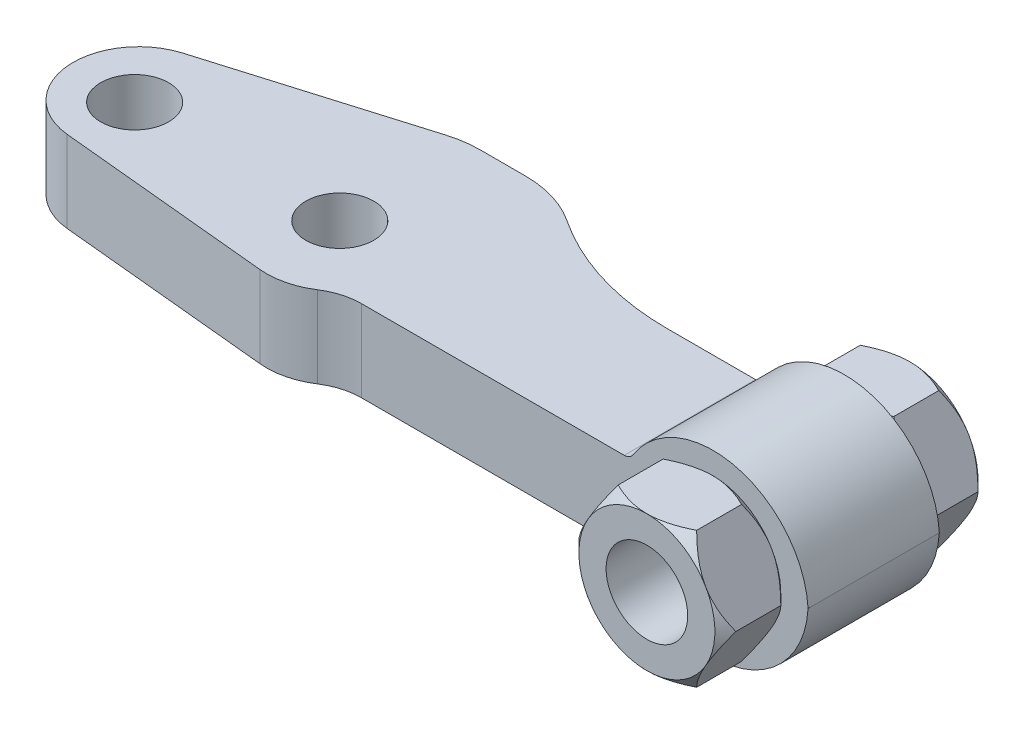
ISO-10303-21;
HEADER;
FILE_DESCRIPTION(('STEP AP214'),'2;1');
FILE_NAME('part.step','',(''),(''),'','','');
FILE_SCHEMA(('AUTOMOTIVE_DESIGN { 1 0 10303 214 1 1 1 1 }'));
ENDSEC;
DATA;
#1=APPLICATION_CONTEXT('core data for automotive mechanical design processes');
#2=APPLICATION_PROTOCOL_DEFINITION('international standard','automotive_design',2000,#1);
#3=PRODUCT_CONTEXT('',#1,'mechanical');
#4=PRODUCT('Part','Part','',(#3));
#5=PRODUCT_RELATED_PRODUCT_CATEGORY('part','',(#4));
#6=PRODUCT_DEFINITION_FORMATION('','',#4);
#7=PRODUCT_DEFINITION_CONTEXT('part definition',#1,'design');
#8=PRODUCT_DEFINITION('design','',#6,#7);
#9=PRODUCT_DEFINITION_SHAPE('','',#8);
#10=(LENGTH_UNIT() NAMED_UNIT(*) SI_UNIT(.MILLI.,.METRE.));
#11=(NAMED_UNIT(*) PLANE_ANGLE_UNIT() SI_UNIT($,.RADIAN.));
#12=(NAMED_UNIT(*) SI_UNIT($,.STERADIAN.) SOLID_ANGLE_UNIT());
#13=UNCERTAINTY_MEASURE_WITH_UNIT(LENGTH_MEASURE(1.E-05),#10,'distance_accuracy_value','');
#14=(GEOMETRIC_REPRESENTATION_CONTEXT(3) GLOBAL_UNCERTAINTY_ASSIGNED_CONTEXT((#13)) GLOBAL_UNIT_ASSIGNED_CONTEXT((#10,
#11,#12)) REPRESENTATION_CONTEXT('',''));
#15=CARTESIAN_POINT('',(0.,0.,0.));
#16=DIRECTION('',(0.,0.,1.));
#17=DIRECTION('',(1.,0.,0.));
#18=AXIS2_PLACEMENT_3D('',#15,#16,#17);
#19=CARTESIAN_POINT('',(47.0243930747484,0.414914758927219,18.4382809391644));
#20=DIRECTION('',(0.,0.,-1.));
#21=DIRECTION('',(-0.656059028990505,-0.754709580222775,0.));
#22=AXIS2_PLACEMENT_3D('',#19,#20,#21);
#23=CYLINDRICAL_SURFACE('',#22,7.);
#24=DIRECTION('',(0.,0.,1.));
#25=VECTOR('',#24,1.);
#26=CARTESIAN_POINT('',(41.1206529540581,-3.3461824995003,-24.2194999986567));
#27=LINE('',#26,#25);
#28=CARTESIAN_POINT('',(41.1206529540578,-3.34618249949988,-5.16950000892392));
#29=VERTEX_POINT('',#28);
#30=CARTESIAN_POINT('',(41.1206529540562,-3.34618249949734,4.48250000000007));
#31=VERTEX_POINT('',#30);
#32=EDGE_CURVE('E733',#29,#31,#27,.T.);
#33=ORIENTED_EDGE('',*,*,#32,.F.);
#34=CARTESIAN_POINT('',(47.0243930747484,0.41491475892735,-5.16950000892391));
#35=DIRECTION('',(0.,0.,-1.));
#36=DIRECTION('',(-0.656059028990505,-0.754709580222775,0.));
#37=AXIS2_PLACEMENT_3D('',#34,#35,#36);
#38=CIRCLE('',#37,7.);
#39=CARTESIAN_POINT('',(54.0120855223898,0.,-5.16950000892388));
#40=VERTEX_POINT('',#39);
#41=EDGE_CURVE('E17',#40,#29,#38,.T.);
#42=ORIENTED_EDGE('',*,*,#41,.F.);
#43=DIRECTION('',(0.,0.,1.));
#44=VECTOR('',#43,1.);
#45=CARTESIAN_POINT('',(54.0120855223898,0.,-8.9889148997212));
#46=LINE('',#45,#44);
#47=CARTESIAN_POINT('',(54.0120855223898,0.,4.48250000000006));
#48=VERTEX_POINT('',#47);
#49=EDGE_CURVE('E922',#40,#48,#46,.T.);
#50=ORIENTED_EDGE('',*,*,#49,.T.);
#51=CARTESIAN_POINT('',(47.0243930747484,0.414914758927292,4.48250000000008));
#52=DIRECTION('',(0.,0.,-1.));
#53=DIRECTION('',(-0.656059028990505,-0.754709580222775,0.));
#54=AXIS2_PLACEMENT_3D('',#51,#52,#53);
#55=CIRCLE('',#54,7.);
#56=EDGE_CURVE('E760',#31,#48,#55,.F.);
#57=ORIENTED_EDGE('',*,*,#56,.F.);
#58=EDGE_LOOP('',(#33,#42,#50,#57));
#59=FACE_BOUND('',#58,.T.);
#60=ADVANCED_FACE('F14',(#59),#23,.T.);
#61=CARTESIAN_POINT('',(36.4142620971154,4.04137134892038,-24.2194999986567));
#62=DIRECTION('',(-0.843391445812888,-0.537299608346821,0.));
#63=DIRECTION('',(0.53729960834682,-0.843391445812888,0.));
#64=AXIS2_PLACEMENT_3D('',#61,#62,#63);
#65=PLANE('',#64);
#66=DIRECTION('',(-0.537299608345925,0.843391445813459,0.));
#67=VECTOR('',#66,1.);
#68=CARTESIAN_POINT('',(41.1206529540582,-3.34618249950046,4.48250000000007));
#69=LINE('',#68,#67);
#70=CARTESIAN_POINT('',(41.1182421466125,-3.3423982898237,4.48250000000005));
#71=VERTEX_POINT('',#70);
#72=EDGE_CURVE('E727',#31,#71,#69,.T.);
#73=ORIENTED_EDGE('',*,*,#72,.T.);
#74=DIRECTION('',(0.,0.,1.));
#75=VECTOR('',#74,1.);
#76=CARTESIAN_POINT('',(41.1182421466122,-3.34239828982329,-10.6979452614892));
#77=LINE('',#76,#75);
#78=CARTESIAN_POINT('',(41.1182421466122,-3.34239828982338,-5.16950000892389));
#79=VERTEX_POINT('',#78);
#80=EDGE_CURVE('E730',#71,#79,#77,.F.);
#81=ORIENTED_EDGE('',*,*,#80,.T.);
#82=DIRECTION('',(0.537299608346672,-0.843391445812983,0.));
#83=VECTOR('',#82,1.);
#84=CARTESIAN_POINT('',(41.1182421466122,-3.34239828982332,-5.16950000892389));
#85=LINE('',#84,#83);
#86=EDGE_CURVE('E736',#79,#29,#85,.T.);
#87=ORIENTED_EDGE('',*,*,#86,.T.);
#88=ORIENTED_EDGE('',*,*,#32,.T.);
#89=EDGE_LOOP('',(#73,#81,#87,#88));
#90=FACE_BOUND('',#89,.T.);
#91=ADVANCED_FACE('F714',(#90),#65,.T.);
#92=CARTESIAN_POINT('',(47.0243930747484,0.414914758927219,18.4382809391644));
#93=DIRECTION('',(0.,0.,-1.));
#94=DIRECTION('',(-0.656059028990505,-0.754709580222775,0.));
#95=AXIS2_PLACEMENT_3D('',#92,#93,#94);
#96=CYLINDRICAL_SURFACE('',#95,4.);
#97=DIRECTION('',(0.,0.,1.));
#98=VECTOR('',#97,1.);
#99=CARTESIAN_POINT('',(43.6508272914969,-1.73428367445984,-24.2194999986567));
#100=LINE('',#99,#98);
#101=CARTESIAN_POINT('',(43.6508272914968,-1.73428367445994,-5.16950000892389));
#102=VERTEX_POINT('',#101);
#103=CARTESIAN_POINT('',(43.6508272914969,-1.73428367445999,4.4825));
#104=VERTEX_POINT('',#103);
#105=EDGE_CURVE('E749',#102,#104,#100,.T.);
#106=ORIENTED_EDGE('',*,*,#105,.T.);
#107=CARTESIAN_POINT('',(47.0243930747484,0.414914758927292,4.48250000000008));
#108=DIRECTION('',(0.,0.,-1.));
#109=DIRECTION('',(-0.656059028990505,-0.754709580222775,0.));
#110=AXIS2_PLACEMENT_3D('',#107,#108,#109);
#111=CIRCLE('',#110,4.);
#112=CARTESIAN_POINT('',(51.0028155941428,0.,4.48250000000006));
#113=VERTEX_POINT('',#112);
#114=EDGE_CURVE('E755',#113,#104,#111,.T.);
#115=ORIENTED_EDGE('',*,*,#114,.F.);
#116=DIRECTION('',(0.,0.,1.));
#117=VECTOR('',#116,1.);
#118=CARTESIAN_POINT('',(51.0028155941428,0.,-8.9889148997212));
#119=LINE('',#118,#117);
#120=CARTESIAN_POINT('',(51.0028155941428,0.,-5.16950000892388));
#121=VERTEX_POINT('',#120);
#122=EDGE_CURVE('E918',#121,#113,#119,.T.);
#123=ORIENTED_EDGE('',*,*,#122,.F.);
#124=CARTESIAN_POINT('',(47.0243930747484,0.41491475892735,-5.16950000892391));
#125=DIRECTION('',(0.,0.,-1.));
#126=DIRECTION('',(-0.656059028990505,-0.754709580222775,0.));
#127=AXIS2_PLACEMENT_3D('',#124,#125,#126);
#128=CIRCLE('',#127,4.);
#129=EDGE_CURVE('E758',#102,#121,#128,.F.);
#130=ORIENTED_EDGE('',*,*,#129,.F.);
#131=EDGE_LOOP('',(#106,#115,#123,#130));
#132=FACE_BOUND('',#131,.T.);
#133=ADVANCED_FACE('F711',(#132),#96,.F.);
#134=CARTESIAN_POINT('',(40.4941324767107,-3.73999999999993,-10.6979452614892));
#135=DIRECTION('',(0.,0.,1.));
#136=DIRECTION('',(0.754709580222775,-0.656059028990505,0.));
#137=AXIS2_PLACEMENT_3D('',#134,#135,#136);
#138=CYLINDRICAL_SURFACE('',#137,0.74);
#139=CARTESIAN_POINT('',(40.4941324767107,-3.74,4.48250000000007));
#140=DIRECTION('',(0.,0.,1.));
#141=DIRECTION('',(0.754709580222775,-0.656059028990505,0.));
#142=AXIS2_PLACEMENT_3D('',#139,#140,#141);
#143=CIRCLE('',#142,0.74);
#144=CARTESIAN_POINT('',(40.4941324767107,-3.,4.48250000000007));
#145=VERTEX_POINT('',#144);
#146=EDGE_CURVE('E740',#71,#145,#143,.T.);
#147=ORIENTED_EDGE('',*,*,#146,.T.);
#148=DIRECTION('',(0.,0.,1.));
#149=VECTOR('',#148,1.);
#150=CARTESIAN_POINT('',(40.4941324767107,-2.99999999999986,-24.2194999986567));
#151=LINE('',#150,#149);
#152=CARTESIAN_POINT('',(40.4941324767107,-2.99999999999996,-5.16950000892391));
#153=VERTEX_POINT('',#152);
#154=EDGE_CURVE('E745',#153,#145,#151,.T.);
#155=ORIENTED_EDGE('',*,*,#154,.F.);
#156=CARTESIAN_POINT('',(40.4941324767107,-3.73999999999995,-5.16950000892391));
#157=DIRECTION('',(0.,0.,1.));
#158=DIRECTION('',(0.754709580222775,-0.656059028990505,0.));
#159=AXIS2_PLACEMENT_3D('',#156,#157,#158);
#160=CIRCLE('',#159,0.74);
#161=EDGE_CURVE('E746',#153,#79,#160,.F.);
#162=ORIENTED_EDGE('',*,*,#161,.T.);
#163=ORIENTED_EDGE('',*,*,#80,.F.);
#164=EDGE_LOOP('',(#147,#155,#162,#163));
#165=FACE_BOUND('',#164,.T.);
#166=ADVANCED_FACE('F707',(#165),#138,.F.);
#167=CARTESIAN_POINT('',(38.9444364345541,5.65327017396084,-24.2194999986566));
#168=DIRECTION('',(-0.843391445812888,-0.537299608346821,0.));
#169=DIRECTION('',(0.53729960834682,-0.843391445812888,0.));
#170=AXIS2_PLACEMENT_3D('',#167,#168,#169);
#171=PLANE('',#170);
#172=DIRECTION('',(0.53729960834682,-0.843391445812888,0.));
#173=VECTOR('',#172,1.);
#174=CARTESIAN_POINT('',(38.9444364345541,5.65327017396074,-5.16950000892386));
#175=LINE('',#174,#173);
#176=CARTESIAN_POINT('',(43.6484164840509,-1.73049946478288,-5.16950000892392));
#177=VERTEX_POINT('',#176);
#178=EDGE_CURVE('E818',#177,#102,#175,.T.);
#179=ORIENTED_EDGE('',*,*,#178,.F.);
#180=DIRECTION('',(0.,0.,1.));
#181=VECTOR('',#180,1.);
#182=CARTESIAN_POINT('',(43.6484164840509,-1.73049946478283,-10.6979452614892));
#183=LINE('',#182,#181);
#184=CARTESIAN_POINT('',(43.6484164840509,-1.73049946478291,4.48250000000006));
#185=VERTEX_POINT('',#184);
#186=EDGE_CURVE('E811',#185,#177,#183,.F.);
#187=ORIENTED_EDGE('',*,*,#186,.F.);
#188=DIRECTION('',(0.53729960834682,-0.843391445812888,0.));
#189=VECTOR('',#188,1.);
#190=CARTESIAN_POINT('',(38.9444364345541,5.65327017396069,4.48250000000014));
#191=LINE('',#190,#189);
#192=EDGE_CURVE('E815',#104,#185,#191,.F.);
#193=ORIENTED_EDGE('',*,*,#192,.F.);
#194=ORIENTED_EDGE('',*,*,#105,.F.);
#195=EDGE_LOOP('',(#179,#187,#193,#194));
#196=FACE_BOUND('',#195,.T.);
#197=ADVANCED_FACE('F703',(#196),#171,.F.);
#198=CARTESIAN_POINT('',(33.9872617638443,-2.99999999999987,-24.2194999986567));
#199=DIRECTION('',(0.,-1.,0.));
#200=DIRECTION('',(1.,0.,0.));
#201=AXIS2_PLACEMENT_3D('',#198,#199,#200);
#202=PLANE('',#201);
#203=CARTESIAN_POINT('',(19.0726000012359,-2.99999999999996,-1.80399999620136));
#204=DIRECTION('',(0.,1.,0.));
#205=DIRECTION('',(-1.,0.,0.));
#206=AXIS2_PLACEMENT_3D('',#203,#204,#205);
#207=CIRCLE('',#206,7.87400000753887);
#208=CARTESIAN_POINT('',(23.4344350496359,-2.99999999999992,-8.35947641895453));
#209=VERTEX_POINT('',#208);
#210=CARTESIAN_POINT('',(19.0726000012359,-2.99999999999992,-9.67800000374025));
#211=VERTEX_POINT('',#210);
#212=EDGE_CURVE('E787',#209,#211,#207,.T.);
#213=ORIENTED_EDGE('',*,*,#212,.F.);
#214=CARTESIAN_POINT('',(33.9872617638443,-2.99999999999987,-24.2194999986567));
#215=DIRECTION('',(0.,1.,0.));
#216=DIRECTION('',(-1.,0.,0.));
#217=AXIS2_PLACEMENT_3D('',#214,#215,#216);
#218=CIRCLE('',#217,19.0499999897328);
#219=CARTESIAN_POINT('',(33.9872617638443,-2.99999999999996,-5.16950000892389));
#220=VERTEX_POINT('',#219);
#221=EDGE_CURVE('E781',#209,#220,#218,.T.);
#222=ORIENTED_EDGE('',*,*,#221,.T.);
#223=DIRECTION('',(1.,0.,0.));
#224=VECTOR('',#223,1.);
#225=CARTESIAN_POINT('',(33.9872617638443,-2.99999999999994,-5.16950000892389));
#226=LINE('',#225,#224);
#227=EDGE_CURVE('E780',#220,#153,#226,.T.);
#228=ORIENTED_EDGE('',*,*,#227,.T.);
#229=ORIENTED_EDGE('',*,*,#154,.T.);
#230=DIRECTION('',(-1.,0.,0.));
#231=VECTOR('',#230,1.);
#232=CARTESIAN_POINT('',(40.4941324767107,-3.,4.48250000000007));
#233=LINE('',#232,#231);
#234=CARTESIAN_POINT('',(21.1493910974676,-3.,4.48250000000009));
#235=VERTEX_POINT('',#234);
#236=EDGE_CURVE('E743',#145,#235,#233,.T.);
#237=ORIENTED_EDGE('',*,*,#236,.T.);
#238=CARTESIAN_POINT('',(21.1493910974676,-3.,9.05449999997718));
#239=DIRECTION('',(0.,1.,0.));
#240=DIRECTION('',(-1.,0.,0.));
#241=AXIS2_PLACEMENT_3D('',#238,#239,#240);
#242=CIRCLE('',#241,4.57199999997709);
#243=CARTESIAN_POINT('',(18.6668721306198,-3.,5.21519230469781));
#244=VERTEX_POINT('',#243);
#245=EDGE_CURVE('E752',#235,#244,#242,.T.);
#246=ORIENTED_EDGE('',*,*,#245,.T.);
#247=CARTESIAN_POINT('',(15.7706000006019,-2.99999999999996,0.735999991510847));
#248=DIRECTION('',(0.,1.,0.));
#249=DIRECTION('',(-1.,0.,0.));
#250=AXIS2_PLACEMENT_3D('',#247,#248,#249);
#251=CIRCLE('',#250,5.3340000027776);
#252=CARTESIAN_POINT('',(15.2560116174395,-3.,6.04511995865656));
#253=VERTEX_POINT('',#252);
#254=EDGE_CURVE('E808',#253,#244,#251,.T.);
#255=ORIENTED_EDGE('',*,*,#254,.F.);
#256=DIRECTION('',(-0.995335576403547,0.,-0.0964732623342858));
#257=VECTOR('',#256,1.);
#258=CARTESIAN_POINT('',(15.2560116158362,-3.,6.04511995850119));
#259=LINE('',#258,#257);
#260=CARTESIAN_POINT('',(-0.442979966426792,-2.99999999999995,4.5234894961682));
#261=VERTEX_POINT('',#260);
#262=EDGE_CURVE('E802',#253,#261,#259,.T.);
#263=ORIENTED_EDGE('',*,*,#262,.T.);
#264=CARTESIAN_POINT('',(0.0226000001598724,-2.99999999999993,-0.279999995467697));
#265=DIRECTION('',(0.,1.,0.));
#266=DIRECTION('',(-1.,0.,0.));
#267=AXIS2_PLACEMENT_3D('',#264,#265,#266);
#268=CIRCLE('',#267,4.82600000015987);
#269=CARTESIAN_POINT('',(-1.35895066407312,-2.99999999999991,-4.90402354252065));
#270=VERTEX_POINT('',#269);
#271=EDGE_CURVE('E799',#270,#261,#268,.T.);
#272=ORIENTED_EDGE('',*,*,#271,.F.);
#273=DIRECTION('',(0.958148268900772,0.,-0.286272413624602));
#274=VECTOR('',#273,1.);
#275=CARTESIAN_POINT('',(-1.35895066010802,-2.99999999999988,-4.90402354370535));
#276=LINE('',#275,#274);
#277=CARTESIAN_POINT('',(13.5164910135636,-2.99999999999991,-9.34845947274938));
#278=VERTEX_POINT('',#277);
#279=EDGE_CURVE('E798',#270,#278,#276,.T.);
#280=ORIENTED_EDGE('',*,*,#279,.T.);
#281=CARTESIAN_POINT('',(15.7706000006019,-2.99999999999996,-1.80399999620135));
#282=DIRECTION('',(0.,1.,0.));
#283=DIRECTION('',(-1.,0.,0.));
#284=AXIS2_PLACEMENT_3D('',#281,#282,#283);
#285=CIRCLE('',#284,7.87400000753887);
#286=CARTESIAN_POINT('',(15.7706000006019,-2.9999999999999,-9.67800000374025));
#287=VERTEX_POINT('',#286);
#288=EDGE_CURVE('E794',#287,#278,#285,.T.);
#289=ORIENTED_EDGE('',*,*,#288,.F.);
#290=DIRECTION('',(1.,0.,0.));
#291=VECTOR('',#290,1.);
#292=CARTESIAN_POINT('',(15.7706000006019,-2.9999999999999,-9.67800000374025));
#293=LINE('',#292,#291);
#294=EDGE_CURVE('E791',#287,#211,#293,.T.);
#295=ORIENTED_EDGE('',*,*,#294,.T.);
#296=EDGE_LOOP('',(#213,#222,#228,#229,#237,#246,#255,#263,#272,#280,#289,#295));
#297=FACE_BOUND('',#296,.T.);
#298=CARTESIAN_POINT('',(15.0876,-2.99999999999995,0.));
#299=DIRECTION('',(0.,-1.,0.));
#300=DIRECTION('',(1.,0.,0.));
#301=AXIS2_PLACEMENT_3D('',#298,#299,#300);
#302=CIRCLE('',#301,2.5);
#303=CARTESIAN_POINT('',(17.5876,-2.99999999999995,0.));
#304=VERTEX_POINT('',#303);
#305=EDGE_CURVE('E764',#304,#304,#302,.F.);
#306=ORIENTED_EDGE('',*,*,#305,.T.);
#307=EDGE_LOOP('',(#306));
#308=FACE_BOUND('',#307,.T.);
#309=CARTESIAN_POINT('',(0.,-2.99999999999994,0.));
#310=DIRECTION('',(0.,-1.,0.));
#311=DIRECTION('',(1.,0.,0.));
#312=AXIS2_PLACEMENT_3D('',#309,#310,#311);
#313=CIRCLE('',#312,2.5);
#314=CARTESIAN_POINT('',(2.5,-2.99999999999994,0.));
#315=VERTEX_POINT('',#314);
#316=EDGE_CURVE('E768',#315,#315,#313,.F.);
#317=ORIENTED_EDGE('',*,*,#316,.T.);
#318=EDGE_LOOP('',(#317));
#319=FACE_BOUND('',#318,.T.);
#320=ADVANCED_FACE('F700',(#297,#308,#319),#202,.T.);
#321=CARTESIAN_POINT('',(21.1493910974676,-3.,4.48250000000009));
#322=DIRECTION('',(0.,0.,-1.));
#323=DIRECTION('',(-0.754709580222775,0.656059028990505,0.));
#324=AXIS2_PLACEMENT_3D('',#321,#322,#323);
#325=PLANE('',#324);
#326=CARTESIAN_POINT('',(40.4941324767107,3.74,4.48250000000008));
#327=DIRECTION('',(0.,0.,-1.));
#328=DIRECTION('',(0.754709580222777,0.656059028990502,0.));
#329=AXIS2_PLACEMENT_3D('',#326,#327,#328);
#330=CIRCLE('',#329,3.74);
#331=CARTESIAN_POINT('',(40.4941324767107,0.,4.4825000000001));
#332=VERTEX_POINT('',#331);
#333=CARTESIAN_POINT('',(42.0194769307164,0.325190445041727,4.48250000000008));
#334=VERTEX_POINT('',#333);
#335=EDGE_CURVE('E891',#332,#334,#330,.F.);
#336=ORIENTED_EDGE('',*,*,#335,.T.);
#337=CARTESIAN_POINT('',(47.0062594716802,-0.0381274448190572,4.48250000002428));
#338=DIRECTION('',(0.,0.,1.));
#339=DIRECTION('',(0.866025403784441,0.5,0.));
#340=AXIS2_PLACEMENT_3D('',#337,#338,#339);
#341=CIRCLE('',#340,4.99999999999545);
#342=CARTESIAN_POINT('',(42.676132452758,2.46187255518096,4.48250000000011));
#343=VERTEX_POINT('',#342);
#344=EDGE_CURVE('E1076',#334,#343,#341,.F.);
#345=ORIENTED_EDGE('',*,*,#344,.T.);
#346=CARTESIAN_POINT('',(47.0062594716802,-0.0381274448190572,4.48250000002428));
#347=DIRECTION('',(0.,0.,1.));
#348=DIRECTION('',(0.866025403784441,0.5,0.));
#349=AXIS2_PLACEMENT_3D('',#346,#347,#348);
#350=CIRCLE('',#349,4.99999999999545);
#351=CARTESIAN_POINT('',(47.0062594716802,4.96187255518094,4.48250000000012));
#352=VERTEX_POINT('',#351);
#353=EDGE_CURVE('E30',#343,#352,#350,.F.);
#354=ORIENTED_EDGE('',*,*,#353,.T.);
#355=CARTESIAN_POINT('',(47.0062594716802,-0.0381274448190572,4.48250000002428));
#356=DIRECTION('',(0.,0.,1.));
#357=DIRECTION('',(0.866025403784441,0.5,0.));
#358=AXIS2_PLACEMENT_3D('',#355,#356,#357);
#359=CIRCLE('',#358,4.99999999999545);
#360=CARTESIAN_POINT('',(51.3363864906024,2.46187255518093,4.48250000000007));
#361=VERTEX_POINT('',#360);
#362=EDGE_CURVE('E35',#352,#361,#359,.F.);
#363=ORIENTED_EDGE('',*,*,#362,.T.);
#364=CARTESIAN_POINT('',(47.0062594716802,-0.0381274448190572,4.48250000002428));
#365=DIRECTION('',(0.,0.,1.));
#366=DIRECTION('',(0.866025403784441,0.5,0.));
#367=AXIS2_PLACEMENT_3D('',#364,#365,#366);
#368=CIRCLE('',#367,4.99999999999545);
#369=CARTESIAN_POINT('',(51.3363864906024,-2.53812744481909,4.4825));
#370=VERTEX_POINT('',#369);
#371=EDGE_CURVE('E1785',#361,#370,#368,.F.);
#372=ORIENTED_EDGE('',*,*,#371,.T.);
#373=CARTESIAN_POINT('',(47.0062594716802,-0.0381274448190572,4.48250000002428));
#374=DIRECTION('',(0.,0.,1.));
#375=DIRECTION('',(0.866025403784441,0.5,0.));
#376=AXIS2_PLACEMENT_3D('',#373,#374,#375);
#377=CIRCLE('',#376,4.99999999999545);
#378=CARTESIAN_POINT('',(47.0062594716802,-5.03812744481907,4.4825));
#379=VERTEX_POINT('',#378);
#380=EDGE_CURVE('E331',#370,#379,#377,.F.);
#381=ORIENTED_EDGE('',*,*,#380,.T.);
#382=CARTESIAN_POINT('',(47.0062594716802,-0.0381274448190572,4.48250000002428));
#383=DIRECTION('',(0.,0.,1.));
#384=DIRECTION('',(0.866025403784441,0.5,0.));
#385=AXIS2_PLACEMENT_3D('',#382,#383,#384);
#386=CIRCLE('',#385,4.99999999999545);
#387=CARTESIAN_POINT('',(42.676132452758,-2.53812744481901,4.48250000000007));
#388=VERTEX_POINT('',#387);
#389=EDGE_CURVE('E379',#379,#388,#386,.F.);
#390=ORIENTED_EDGE('',*,*,#389,.T.);
#391=CARTESIAN_POINT('',(42.0143765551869,-0.322916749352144,4.48250000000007));
#392=VERTEX_POINT('',#391);
#393=EDGE_CURVE('E1084',#388,#392,#341,.F.);
#394=ORIENTED_EDGE('',*,*,#393,.T.);
#395=CARTESIAN_POINT('',(40.4941324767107,-3.74,4.48250000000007));
#396=DIRECTION('',(0.,0.,1.));
#397=DIRECTION('',(0.754709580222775,-0.656059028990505,0.));
#398=AXIS2_PLACEMENT_3D('',#395,#396,#397);
#399=CIRCLE('',#398,3.74);
#400=EDGE_CURVE('E9',#332,#392,#399,.F.);
#401=ORIENTED_EDGE('',*,*,#400,.F.);
#402=EDGE_LOOP('',(#336,#345,#354,#363,#372,#381,#390,#394,#401));
#403=FACE_BOUND('',#402,.T.);
#404=DIRECTION('',(-1.,0.,0.));
#405=VECTOR('',#404,1.);
#406=CARTESIAN_POINT('',(40.4941324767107,3.,4.48250000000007));
#407=LINE('',#406,#405);
#408=CARTESIAN_POINT('',(40.4941324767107,3.,4.48250000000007));
#409=VERTEX_POINT('',#408);
#410=CARTESIAN_POINT('',(21.1493910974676,3.,4.48250000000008));
#411=VERTEX_POINT('',#410);
#412=EDGE_CURVE('E868',#409,#411,#407,.T.);
#413=ORIENTED_EDGE('',*,*,#412,.T.);
#414=DIRECTION('',(0.,1.,0.));
#415=VECTOR('',#414,1.);
#416=CARTESIAN_POINT('',(21.1493910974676,-3.,4.48250000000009));
#417=LINE('',#416,#415);
#418=EDGE_CURVE('E809',#411,#235,#417,.F.);
#419=ORIENTED_EDGE('',*,*,#418,.T.);
#420=ORIENTED_EDGE('',*,*,#236,.F.);
#421=ORIENTED_EDGE('',*,*,#146,.F.);
#422=ORIENTED_EDGE('',*,*,#72,.F.);
#423=ORIENTED_EDGE('',*,*,#56,.T.);
#424=CARTESIAN_POINT('',(47.0243930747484,-0.414914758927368,4.48250000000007));
#425=DIRECTION('',(0.,0.,1.));
#426=DIRECTION('',(-0.656059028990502,0.754709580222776,0.));
#427=AXIS2_PLACEMENT_3D('',#424,#425,#426);
#428=CIRCLE('',#427,7.);
#429=CARTESIAN_POINT('',(41.1206529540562,3.34618249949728,4.48250000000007));
#430=VERTEX_POINT('',#429);
#431=EDGE_CURVE('E890',#430,#48,#428,.F.);
#432=ORIENTED_EDGE('',*,*,#431,.F.);
#433=DIRECTION('',(-0.537299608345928,-0.843391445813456,0.));
#434=VECTOR('',#433,1.);
#435=CARTESIAN_POINT('',(41.1206529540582,3.34618249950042,4.48250000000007));
#436=LINE('',#435,#434);
#437=CARTESIAN_POINT('',(41.1182421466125,3.34239828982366,4.4825000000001));
#438=VERTEX_POINT('',#437);
#439=EDGE_CURVE('E875',#430,#438,#436,.T.);
#440=ORIENTED_EDGE('',*,*,#439,.T.);
#441=CARTESIAN_POINT('',(40.4941324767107,3.74,4.48250000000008));
#442=DIRECTION('',(0.,0.,-1.));
#443=DIRECTION('',(0.754709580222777,0.656059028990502,0.));
#444=AXIS2_PLACEMENT_3D('',#441,#442,#443);
#445=CIRCLE('',#444,0.74);
#446=EDGE_CURVE('E910',#438,#409,#445,.T.);
#447=ORIENTED_EDGE('',*,*,#446,.T.);
#448=EDGE_LOOP('',(#413,#419,#420,#421,#422,#423,#432,#440,#447));
#449=FACE_BOUND('',#448,.T.);
#450=ADVANCED_FACE('F696',(#403,#449),#325,.F.);
#451=CARTESIAN_POINT('',(21.1493910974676,-3.,9.05449999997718));
#452=DIRECTION('',(0.,1.,0.));
#453=DIRECTION('',(-1.,0.,0.));
#454=AXIS2_PLACEMENT_3D('',#451,#452,#453);
#455=CYLINDRICAL_SURFACE('',#454,4.57199999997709);
#456=DIRECTION('',(0.,1.,0.));
#457=VECTOR('',#456,1.);
#458=CARTESIAN_POINT('',(18.6668721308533,-3.,5.21519230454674));
#459=LINE('',#458,#457);
#460=CARTESIAN_POINT('',(18.6668721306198,3.,5.2151923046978));
#461=VERTEX_POINT('',#460);
#462=EDGE_CURVE('E806',#244,#461,#459,.T.);
#463=ORIENTED_EDGE('',*,*,#462,.F.);
#464=ORIENTED_EDGE('',*,*,#245,.F.);
#465=ORIENTED_EDGE('',*,*,#418,.F.);
#466=CARTESIAN_POINT('',(21.1493910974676,3.,9.05449999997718));
#467=DIRECTION('',(0.,1.,0.));
#468=DIRECTION('',(-1.,0.,0.));
#469=AXIS2_PLACEMENT_3D('',#466,#467,#468);
#470=CIRCLE('',#469,4.57199999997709);
#471=EDGE_CURVE('E845',#411,#461,#470,.T.);
#472=ORIENTED_EDGE('',*,*,#471,.T.);
#473=EDGE_LOOP('',(#463,#464,#465,#472));
#474=FACE_BOUND('',#473,.T.);
#475=ADVANCED_FACE('F692',(#474),#455,.F.);
#476=CARTESIAN_POINT('',(15.7706000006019,-2.99999999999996,0.735999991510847));
#477=DIRECTION('',(0.,1.,0.));
#478=DIRECTION('',(-1.,0.,0.));
#479=AXIS2_PLACEMENT_3D('',#476,#477,#478);
#480=CYLINDRICAL_SURFACE('',#479,5.3340000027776);
#481=ORIENTED_EDGE('',*,*,#254,.T.);
#482=ORIENTED_EDGE('',*,*,#462,.T.);
#483=CARTESIAN_POINT('',(15.7706000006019,3.00000000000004,0.735999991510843));
#484=DIRECTION('',(0.,1.,0.));
#485=DIRECTION('',(-1.,0.,0.));
#486=AXIS2_PLACEMENT_3D('',#483,#484,#485);
#487=CIRCLE('',#486,5.3340000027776);
#488=CARTESIAN_POINT('',(15.2560116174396,3.,6.0451199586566));
#489=VERTEX_POINT('',#488);
#490=EDGE_CURVE('E848',#489,#461,#487,.T.);
#491=ORIENTED_EDGE('',*,*,#490,.F.);
#492=DIRECTION('',(0.,-1.,0.));
#493=VECTOR('',#492,1.);
#494=CARTESIAN_POINT('',(15.2560116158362,0.,6.04511995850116));
#495=LINE('',#494,#493);
#496=EDGE_CURVE('E803',#489,#253,#495,.T.);
#497=ORIENTED_EDGE('',*,*,#496,.T.);
#498=EDGE_LOOP('',(#481,#482,#491,#497));
#499=FACE_BOUND('',#498,.T.);
#500=ADVANCED_FACE('F688',(#499),#480,.T.);
#501=CARTESIAN_POINT('',(15.2560116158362,-3.,6.04511995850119));
#502=DIRECTION('',(0.0964732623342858,0.,-0.995335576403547));
#503=DIRECTION('',(-0.752698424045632,0.654310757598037,-0.0729555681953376));
#504=AXIS2_PLACEMENT_3D('',#501,#502,#503);
#505=PLANE('',#504);
#506=DIRECTION('',(0.,1.,0.));
#507=VECTOR('',#506,1.);
#508=CARTESIAN_POINT('',(-0.44297996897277,-2.99999999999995,4.52348949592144));
#509=LINE('',#508,#507);
#510=CARTESIAN_POINT('',(-0.442979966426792,3.00000000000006,4.5234894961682));
#511=VERTEX_POINT('',#510);
#512=EDGE_CURVE('E800',#261,#511,#509,.T.);
#513=ORIENTED_EDGE('',*,*,#512,.F.);
#514=ORIENTED_EDGE('',*,*,#262,.F.);
#515=ORIENTED_EDGE('',*,*,#496,.F.);
#516=DIRECTION('',(-0.995335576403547,0.,-0.0964732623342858));
#517=VECTOR('',#516,1.);
#518=CARTESIAN_POINT('',(15.2560116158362,3.,6.04511995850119));
#519=LINE('',#518,#517);
#520=EDGE_CURVE('E851',#489,#511,#519,.T.);
#521=ORIENTED_EDGE('',*,*,#520,.T.);
#522=EDGE_LOOP('',(#513,#514,#515,#521));
#523=FACE_BOUND('',#522,.T.);
#524=ADVANCED_FACE('F684',(#523),#505,.F.);
#525=CARTESIAN_POINT('',(0.0226000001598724,-2.99999999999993,-0.279999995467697));
#526=DIRECTION('',(0.,1.,0.));
#527=DIRECTION('',(-1.,0.,0.));
#528=AXIS2_PLACEMENT_3D('',#525,#526,#527);
#529=CYLINDRICAL_SURFACE('',#528,4.82600000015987);
#530=ORIENTED_EDGE('',*,*,#512,.T.);
#531=CARTESIAN_POINT('',(0.0226000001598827,3.00000000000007,-0.279999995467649));
#532=DIRECTION('',(0.,1.,0.));
#533=DIRECTION('',(-1.,0.,0.));
#534=AXIS2_PLACEMENT_3D('',#531,#532,#533);
#535=CIRCLE('',#534,4.82600000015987);
#536=CARTESIAN_POINT('',(-1.35895066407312,3.0000000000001,-4.90402354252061));
#537=VERTEX_POINT('',#536);
#538=EDGE_CURVE('E860',#537,#511,#535,.T.);
#539=ORIENTED_EDGE('',*,*,#538,.F.);
#540=DIRECTION('',(0.,-1.,0.));
#541=VECTOR('',#540,1.);
#542=CARTESIAN_POINT('',(-1.35895066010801,1.04083408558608E-13,-4.90402354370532));
#543=LINE('',#542,#541);
#544=EDGE_CURVE('E795',#537,#270,#543,.T.);
#545=ORIENTED_EDGE('',*,*,#544,.T.);
#546=ORIENTED_EDGE('',*,*,#271,.T.);
#547=EDGE_LOOP('',(#530,#539,#545,#546));
#548=FACE_BOUND('',#547,.T.);
#549=ADVANCED_FACE('F680',(#548),#529,.T.);
#550=CARTESIAN_POINT('',(-1.35895066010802,-2.99999999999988,-4.90402354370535));
#551=DIRECTION('',(0.286272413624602,0.,0.958148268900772));
#552=DIRECTION('',(0.736224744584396,-0.639990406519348,-0.219966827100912));
#553=AXIS2_PLACEMENT_3D('',#550,#551,#552);
#554=PLANE('',#553);
#555=DIRECTION('',(0.,1.,0.));
#556=VECTOR('',#555,1.);
#557=CARTESIAN_POINT('',(13.5164910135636,-2.99999999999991,-9.34845947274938));
#558=LINE('',#557,#556);
#559=CARTESIAN_POINT('',(13.5164910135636,3.0000000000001,-9.34845947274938));
#560=VERTEX_POINT('',#559);
#561=EDGE_CURVE('E792',#278,#560,#558,.T.);
#562=ORIENTED_EDGE('',*,*,#561,.F.);
#563=ORIENTED_EDGE('',*,*,#279,.F.);
#564=ORIENTED_EDGE('',*,*,#544,.F.);
#565=DIRECTION('',(0.958148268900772,0.,-0.286272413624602));
#566=VECTOR('',#565,1.);
#567=CARTESIAN_POINT('',(-1.35895066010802,3.0000000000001,-4.9040235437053));
#568=LINE('',#567,#566);
#569=EDGE_CURVE('E863',#537,#560,#568,.T.);
#570=ORIENTED_EDGE('',*,*,#569,.T.);
#571=EDGE_LOOP('',(#562,#563,#564,#570));
#572=FACE_BOUND('',#571,.T.);
#573=ADVANCED_FACE('F676',(#572),#554,.F.);
#574=CARTESIAN_POINT('',(15.7706000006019,-2.99999999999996,-1.80399999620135));
#575=DIRECTION('',(0.,1.,0.));
#576=DIRECTION('',(-1.,0.,0.));
#577=AXIS2_PLACEMENT_3D('',#574,#575,#576);
#578=CYLINDRICAL_SURFACE('',#577,7.87400000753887);
#579=ORIENTED_EDGE('',*,*,#288,.T.);
#580=ORIENTED_EDGE('',*,*,#561,.T.);
#581=CARTESIAN_POINT('',(15.7706000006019,3.00000000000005,-1.80399999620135));
#582=DIRECTION('',(0.,1.,0.));
#583=DIRECTION('',(-1.,0.,0.));
#584=AXIS2_PLACEMENT_3D('',#581,#582,#583);
#585=CIRCLE('',#584,7.87400000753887);
#586=CARTESIAN_POINT('',(15.7706000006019,3.0000000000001,-9.6780000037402));
#587=VERTEX_POINT('',#586);
#588=EDGE_CURVE('E906',#587,#560,#585,.T.);
#589=ORIENTED_EDGE('',*,*,#588,.F.);
#590=DIRECTION('',(0.,-1.,0.));
#591=VECTOR('',#590,1.);
#592=CARTESIAN_POINT('',(15.7706000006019,0.,-9.67800000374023));
#593=LINE('',#592,#591);
#594=EDGE_CURVE('E788',#587,#287,#593,.T.);
#595=ORIENTED_EDGE('',*,*,#594,.T.);
#596=EDGE_LOOP('',(#579,#580,#589,#595));
#597=FACE_BOUND('',#596,.T.);
#598=ADVANCED_FACE('F672',(#597),#578,.T.);
#599=CARTESIAN_POINT('',(15.7706000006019,-2.9999999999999,-9.67800000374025));
#600=DIRECTION('',(0.,0.,1.));
#601=DIRECTION('',(0.754709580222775,-0.656059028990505,0.));
#602=AXIS2_PLACEMENT_3D('',#599,#600,#601);
#603=PLANE('',#602);
#604=DIRECTION('',(0.,1.,0.));
#605=VECTOR('',#604,1.);
#606=CARTESIAN_POINT('',(19.0726000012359,-2.99999999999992,-9.67800000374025));
#607=LINE('',#606,#605);
#608=CARTESIAN_POINT('',(19.0726000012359,3.00000000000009,-9.6780000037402));
#609=VERTEX_POINT('',#608);
#610=EDGE_CURVE('E785',#211,#609,#607,.T.);
#611=ORIENTED_EDGE('',*,*,#610,.F.);
#612=ORIENTED_EDGE('',*,*,#294,.F.);
#613=ORIENTED_EDGE('',*,*,#594,.F.);
#614=DIRECTION('',(1.,0.,0.));
#615=VECTOR('',#614,1.);
#616=CARTESIAN_POINT('',(15.7706000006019,3.0000000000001,-9.6780000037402));
#617=LINE('',#616,#615);
#618=EDGE_CURVE('E905',#587,#609,#617,.T.);
#619=ORIENTED_EDGE('',*,*,#618,.T.);
#620=EDGE_LOOP('',(#611,#612,#613,#619));
#621=FACE_BOUND('',#620,.T.);
#622=ADVANCED_FACE('F668',(#621),#603,.F.);
#623=CARTESIAN_POINT('',(19.0726000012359,-2.99999999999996,-1.80399999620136));
#624=DIRECTION('',(0.,1.,0.));
#625=DIRECTION('',(-1.,0.,0.));
#626=AXIS2_PLACEMENT_3D('',#623,#624,#625);
#627=CYLINDRICAL_SURFACE('',#626,7.87400000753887);
#628=ORIENTED_EDGE('',*,*,#212,.T.);
#629=ORIENTED_EDGE('',*,*,#610,.T.);
#630=CARTESIAN_POINT('',(19.0726000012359,3.00000000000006,-1.80399999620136));
#631=DIRECTION('',(0.,1.,0.));
#632=DIRECTION('',(-1.,0.,0.));
#633=AXIS2_PLACEMENT_3D('',#630,#631,#632);
#634=CIRCLE('',#633,7.87400000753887);
#635=CARTESIAN_POINT('',(23.4344350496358,3.00000000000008,-8.35947641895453));
#636=VERTEX_POINT('',#635);
#637=EDGE_CURVE('E903',#636,#609,#634,.T.);
#638=ORIENTED_EDGE('',*,*,#637,.F.);
#639=DIRECTION('',(0.,1.,0.));
#640=VECTOR('',#639,1.);
#641=CARTESIAN_POINT('',(23.4344350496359,-2.99999999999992,-8.35947641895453));
#642=LINE('',#641,#640);
#643=EDGE_CURVE('E782',#636,#209,#642,.F.);
#644=ORIENTED_EDGE('',*,*,#643,.T.);
#645=EDGE_LOOP('',(#628,#629,#638,#644));
#646=FACE_BOUND('',#645,.T.);
#647=ADVANCED_FACE('F664',(#646),#627,.T.);
#648=CARTESIAN_POINT('',(33.9872617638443,-2.99999999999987,-24.2194999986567));
#649=DIRECTION('',(0.,1.,0.));
#650=DIRECTION('',(-1.,0.,0.));
#651=AXIS2_PLACEMENT_3D('',#648,#649,#650);
#652=CYLINDRICAL_SURFACE('',#651,19.0499999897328);
#653=DIRECTION('',(0.,-1.,0.));
#654=VECTOR('',#653,1.);
#655=CARTESIAN_POINT('',(33.9872617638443,0.,-5.16950000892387));
#656=LINE('',#655,#654);
#657=CARTESIAN_POINT('',(33.9872617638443,3.00000000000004,-5.16950000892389));
#658=VERTEX_POINT('',#657);
#659=EDGE_CURVE('E777',#658,#220,#656,.T.);
#660=ORIENTED_EDGE('',*,*,#659,.T.);
#661=ORIENTED_EDGE('',*,*,#221,.F.);
#662=ORIENTED_EDGE('',*,*,#643,.F.);
#663=CARTESIAN_POINT('',(33.9872617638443,3.00000000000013,-24.2194999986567));
#664=DIRECTION('',(0.,1.,0.));
#665=DIRECTION('',(-1.,0.,0.));
#666=AXIS2_PLACEMENT_3D('',#663,#664,#665);
#667=CIRCLE('',#666,19.0499999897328);
#668=EDGE_CURVE('E899',#636,#658,#667,.T.);
#669=ORIENTED_EDGE('',*,*,#668,.T.);
#670=EDGE_LOOP('',(#660,#661,#662,#669));
#671=FACE_BOUND('',#670,.T.);
#672=ADVANCED_FACE('F656',(#671),#652,.F.);
#673=CARTESIAN_POINT('',(33.9872617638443,-2.99999999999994,-5.16950000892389));
#674=DIRECTION('',(0.,0.,1.));
#675=DIRECTION('',(0.754709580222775,-0.656059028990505,0.));
#676=AXIS2_PLACEMENT_3D('',#673,#674,#675);
#677=PLANE('',#676);
#678=CARTESIAN_POINT('',(40.4941324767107,-3.73999999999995,-5.16950000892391));
#679=DIRECTION('',(0.,0.,1.));
#680=DIRECTION('',(0.754709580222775,-0.656059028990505,0.));
#681=AXIS2_PLACEMENT_3D('',#678,#679,#680);
#682=CIRCLE('',#681,3.74);
#683=CARTESIAN_POINT('',(42.0143765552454,-0.322916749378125,-5.16950000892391));
#684=VERTEX_POINT('',#683);
#685=CARTESIAN_POINT('',(40.4941324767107,0.,-5.16950000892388));
#686=VERTEX_POINT('',#685);
#687=EDGE_CURVE('E814',#684,#686,#682,.T.);
#688=ORIENTED_EDGE('',*,*,#687,.F.);
#689=CARTESIAN_POINT('',(47.0062594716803,-0.0381274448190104,-5.16950000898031));
#690=DIRECTION('',(0.,0.,-1.));
#691=DIRECTION('',(0.866025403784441,0.5,0.));
#692=AXIS2_PLACEMENT_3D('',#689,#690,#691);
#693=CIRCLE('',#692,4.99999999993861);
#694=CARTESIAN_POINT('',(42.6761324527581,-2.53812744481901,-5.16950000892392));
#695=VERTEX_POINT('',#694);
#696=EDGE_CURVE('E418',#695,#684,#693,.T.);
#697=ORIENTED_EDGE('',*,*,#696,.F.);
#698=CARTESIAN_POINT('',(47.0062594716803,-0.0381274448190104,-5.16950000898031));
#699=DIRECTION('',(0.,0.,-1.));
#700=DIRECTION('',(0.866025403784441,0.5,0.));
#701=AXIS2_PLACEMENT_3D('',#698,#699,#700);
#702=CIRCLE('',#701,4.99999999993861);
#703=CARTESIAN_POINT('',(47.0062594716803,-5.03812744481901,-5.1695000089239));
#704=VERTEX_POINT('',#703);
#705=EDGE_CURVE('E423',#704,#695,#702,.T.);
#706=ORIENTED_EDGE('',*,*,#705,.F.);
#707=CARTESIAN_POINT('',(47.0062594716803,-0.0381274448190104,-5.16950000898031));
#708=DIRECTION('',(0.,0.,-1.));
#709=DIRECTION('',(0.866025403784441,0.5,0.));
#710=AXIS2_PLACEMENT_3D('',#707,#708,#709);
#711=CIRCLE('',#710,4.99999999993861);
#712=CARTESIAN_POINT('',(51.3363864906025,-2.53812744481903,-5.1695000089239));
#713=VERTEX_POINT('',#712);
#714=EDGE_CURVE('E426',#713,#704,#711,.T.);
#715=ORIENTED_EDGE('',*,*,#714,.F.);
#716=CARTESIAN_POINT('',(47.0062594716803,-0.0381274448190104,-5.16950000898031));
#717=DIRECTION('',(0.,0.,-1.));
#718=DIRECTION('',(0.866025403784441,0.5,0.));
#719=AXIS2_PLACEMENT_3D('',#716,#717,#718);
#720=CIRCLE('',#719,4.99999999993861);
#721=CARTESIAN_POINT('',(51.3363864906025,2.46187255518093,-5.16950000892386));
#722=VERTEX_POINT('',#721);
#723=EDGE_CURVE('E408',#722,#713,#720,.T.);
#724=ORIENTED_EDGE('',*,*,#723,.F.);
#725=CARTESIAN_POINT('',(47.0062594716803,-0.0381274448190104,-5.16950000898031));
#726=DIRECTION('',(0.,0.,-1.));
#727=DIRECTION('',(0.866025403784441,0.5,0.));
#728=AXIS2_PLACEMENT_3D('',#725,#726,#727);
#729=CIRCLE('',#728,4.99999999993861);
#730=CARTESIAN_POINT('',(47.0062594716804,4.96187255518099,-5.16950000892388));
#731=VERTEX_POINT('',#730);
#732=EDGE_CURVE('E412',#731,#722,#729,.T.);
#733=ORIENTED_EDGE('',*,*,#732,.F.);
#734=CARTESIAN_POINT('',(47.0062594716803,-0.0381274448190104,-5.16950000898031));
#735=DIRECTION('',(0.,0.,-1.));
#736=DIRECTION('',(0.866025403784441,0.5,0.));
#737=AXIS2_PLACEMENT_3D('',#734,#735,#736);
#738=CIRCLE('',#737,4.99999999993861);
#739=CARTESIAN_POINT('',(42.6761324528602,2.46187255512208,-5.16950000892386));
#740=VERTEX_POINT('',#739);
#741=EDGE_CURVE('E415',#740,#731,#738,.T.);
#742=ORIENTED_EDGE('',*,*,#741,.F.);
#743=CARTESIAN_POINT('',(42.0194769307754,0.325190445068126,-5.16950000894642));
#744=VERTEX_POINT('',#743);
#745=EDGE_CURVE('E422',#744,#740,#693,.T.);
#746=ORIENTED_EDGE('',*,*,#745,.F.);
#747=CARTESIAN_POINT('',(40.4941324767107,3.74,-5.16950000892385));
#748=DIRECTION('',(0.,0.,-1.));
#749=DIRECTION('',(0.754709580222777,0.656059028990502,0.));
#750=AXIS2_PLACEMENT_3D('',#747,#748,#749);
#751=CIRCLE('',#750,3.74);
#752=EDGE_CURVE('E898',#744,#686,#751,.T.);
#753=ORIENTED_EDGE('',*,*,#752,.T.);
#754=EDGE_LOOP('',(#688,#697,#706,#715,#724,#733,#742,#746,#753));
#755=FACE_BOUND('',#754,.T.);
#756=ORIENTED_EDGE('',*,*,#659,.F.);
#757=DIRECTION('',(1.,0.,0.));
#758=VECTOR('',#757,1.);
#759=CARTESIAN_POINT('',(33.9872617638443,3.00000000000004,-5.16950000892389));
#760=LINE('',#759,#758);
#761=CARTESIAN_POINT('',(40.4941324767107,3.,-5.16950000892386));
#762=VERTEX_POINT('',#761);
#763=EDGE_CURVE('E902',#658,#762,#760,.T.);
#764=ORIENTED_EDGE('',*,*,#763,.T.);
#765=CARTESIAN_POINT('',(40.4941324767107,3.74,-5.16950000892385));
#766=DIRECTION('',(0.,0.,-1.));
#767=DIRECTION('',(0.754709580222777,0.656059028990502,0.));
#768=AXIS2_PLACEMENT_3D('',#765,#766,#767);
#769=CIRCLE('',#768,0.74);
#770=CARTESIAN_POINT('',(41.1182421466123,3.34239828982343,-5.16950000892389));
#771=VERTEX_POINT('',#770);
#772=EDGE_CURVE('E884',#762,#771,#769,.F.);
#773=ORIENTED_EDGE('',*,*,#772,.T.);
#774=DIRECTION('',(0.537299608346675,0.843391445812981,0.));
#775=VECTOR('',#774,1.);
#776=CARTESIAN_POINT('',(41.1182421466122,3.34239828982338,-5.16950000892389));
#777=LINE('',#776,#775);
#778=CARTESIAN_POINT('',(41.1206529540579,3.34618249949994,-5.16950000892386));
#779=VERTEX_POINT('',#778);
#780=EDGE_CURVE('E878',#771,#779,#777,.T.);
#781=ORIENTED_EDGE('',*,*,#780,.T.);
#782=CARTESIAN_POINT('',(47.0243930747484,-0.414914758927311,-5.16950000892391));
#783=DIRECTION('',(0.,0.,1.));
#784=DIRECTION('',(-0.656059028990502,0.754709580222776,0.));
#785=AXIS2_PLACEMENT_3D('',#782,#783,#784);
#786=CIRCLE('',#785,7.);
#787=EDGE_CURVE('E916',#40,#779,#786,.T.);
#788=ORIENTED_EDGE('',*,*,#787,.F.);
#789=ORIENTED_EDGE('',*,*,#41,.T.);
#790=ORIENTED_EDGE('',*,*,#86,.F.);
#791=ORIENTED_EDGE('',*,*,#161,.F.);
#792=ORIENTED_EDGE('',*,*,#227,.F.);
#793=EDGE_LOOP('',(#756,#764,#773,#781,#788,#789,#790,#791,#792));
#794=FACE_BOUND('',#793,.T.);
#795=ADVANCED_FACE('F645',(#755,#794),#677,.F.);
#796=CARTESIAN_POINT('',(40.4941324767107,-3.73999999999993,-10.6979452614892));
#797=DIRECTION('',(0.,0.,1.));
#798=DIRECTION('',(0.754709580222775,-0.656059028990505,0.));
#799=AXIS2_PLACEMENT_3D('',#796,#797,#798);
#800=CYLINDRICAL_SURFACE('',#799,3.74);
#801=DIRECTION('',(0.,0.,1.));
#802=VECTOR('',#801,1.);
#803=CARTESIAN_POINT('',(40.4941324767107,1.26634813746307E-13,-24.2194999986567));
#804=LINE('',#803,#802);
#805=EDGE_CURVE('E773',#686,#332,#804,.T.);
#806=ORIENTED_EDGE('',*,*,#805,.T.);
#807=ORIENTED_EDGE('',*,*,#400,.T.);
#808=CARTESIAN_POINT('',(40.4941324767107,-3.74,4.48250000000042));
#809=DIRECTION('',(0.,0.,-1.));
#810=DIRECTION('',(-1.,0.,0.));
#811=AXIS2_PLACEMENT_3D('',#808,#809,#810);
#812=CIRCLE('',#811,3.74);
#813=EDGE_CURVE('E375',#185,#392,#812,.F.);
#814=ORIENTED_EDGE('',*,*,#813,.F.);
#815=ORIENTED_EDGE('',*,*,#186,.T.);
#816=EDGE_CURVE('E22',#177,#684,#682,.T.);
#817=ORIENTED_EDGE('',*,*,#816,.T.);
#818=ORIENTED_EDGE('',*,*,#687,.T.);
#819=EDGE_LOOP('',(#806,#807,#814,#815,#817,#818));
#820=FACE_BOUND('',#819,.T.);
#821=ADVANCED_FACE('F642',(#820),#800,.T.);
#822=CARTESIAN_POINT('',(15.0876,-13.7058813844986,0.));
#823=DIRECTION('',(0.,1.,0.));
#824=DIRECTION('',(-1.,0.,0.));
#825=AXIS2_PLACEMENT_3D('',#822,#823,#824);
#826=CYLINDRICAL_SURFACE('',#825,2.5);
#827=ORIENTED_EDGE('',*,*,#305,.F.);
#828=EDGE_LOOP('',(#827));
#829=FACE_BOUND('',#828,.T.);
#830=CARTESIAN_POINT('',(15.0876,3.00000000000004,1.07552855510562E-13));
#831=DIRECTION('',(0.,-1.,0.));
#832=DIRECTION('',(1.,0.,0.));
#833=AXIS2_PLACEMENT_3D('',#830,#831,#832);
#834=CIRCLE('',#833,2.5);
#835=CARTESIAN_POINT('',(17.5876,3.00000000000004,1.06064788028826E-13));
#836=VERTEX_POINT('',#835);
#837=EDGE_CURVE('E927',#836,#836,#834,.F.);
#838=ORIENTED_EDGE('',*,*,#837,.T.);
#839=EDGE_LOOP('',(#838));
#840=FACE_BOUND('',#839,.T.);
#841=ADVANCED_FACE('F644',(#829,#840),#826,.F.);
#842=CARTESIAN_POINT('',(0.,-13.7058813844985,-1.11022302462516E-13));
#843=DIRECTION('',(0.,1.,0.));
#844=DIRECTION('',(-1.,0.,0.));
#845=AXIS2_PLACEMENT_3D('',#842,#843,#844);
#846=CYLINDRICAL_SURFACE('',#845,2.5);
#847=ORIENTED_EDGE('',*,*,#316,.F.);
#848=EDGE_LOOP('',(#847));
#849=FACE_BOUND('',#848,.T.);
#850=CARTESIAN_POINT('',(0.,3.00000000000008,0.));
#851=DIRECTION('',(0.,-1.,0.));
#852=DIRECTION('',(1.,0.,0.));
#853=AXIS2_PLACEMENT_3D('',#850,#851,#852);
#854=CIRCLE('',#853,2.5);
#855=CARTESIAN_POINT('',(2.50000000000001,3.00000000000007,0.));
#856=VERTEX_POINT('',#855);
#857=EDGE_CURVE('E411',#856,#856,#854,.F.);
#858=ORIENTED_EDGE('',*,*,#857,.T.);
#859=EDGE_LOOP('',(#858));
#860=FACE_BOUND('',#859,.T.);
#861=ADVANCED_FACE('F653',(#849,#860),#846,.F.);
#862=CARTESIAN_POINT('',(47.0243930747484,-0.414914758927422,18.4382809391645));
#863=DIRECTION('',(0.,0.,-1.));
#864=DIRECTION('',(-0.656059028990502,0.754709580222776,0.));
#865=AXIS2_PLACEMENT_3D('',#862,#863,#864);
#866=CYLINDRICAL_SURFACE('',#865,7.);
#867=DIRECTION('',(0.,0.,1.));
#868=VECTOR('',#867,1.);
#869=CARTESIAN_POINT('',(41.1206529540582,3.34618249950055,-24.2194999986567));
#870=LINE('',#869,#868);
#871=EDGE_CURVE('E886',#779,#430,#870,.T.);
#872=ORIENTED_EDGE('',*,*,#871,.T.);
#873=ORIENTED_EDGE('',*,*,#431,.T.);
#874=ORIENTED_EDGE('',*,*,#49,.F.);
#875=ORIENTED_EDGE('',*,*,#787,.T.);
#876=EDGE_LOOP('',(#872,#873,#874,#875));
#877=FACE_BOUND('',#876,.T.);
#878=ADVANCED_FACE('F961',(#877),#866,.T.);
#879=CARTESIAN_POINT('',(36.4142620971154,-4.04137134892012,-24.2194999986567));
#880=DIRECTION('',(-0.843391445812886,0.537299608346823,0.));
#881=DIRECTION('',(0.537299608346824,0.843391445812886,0.));
#882=AXIS2_PLACEMENT_3D('',#879,#880,#881);
#883=PLANE('',#882);
#884=ORIENTED_EDGE('',*,*,#439,.F.);
#885=ORIENTED_EDGE('',*,*,#871,.F.);
#886=ORIENTED_EDGE('',*,*,#780,.F.);
#887=DIRECTION('',(0.,0.,1.));
#888=VECTOR('',#887,1.);
#889=CARTESIAN_POINT('',(41.1182421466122,3.34239828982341,-10.6979452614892));
#890=LINE('',#889,#888);
#891=EDGE_CURVE('E871',#438,#771,#890,.F.);
#892=ORIENTED_EDGE('',*,*,#891,.F.);
#893=EDGE_LOOP('',(#884,#885,#886,#892));
#894=FACE_BOUND('',#893,.T.);
#895=ADVANCED_FACE('F960',(#894),#883,.T.);
#896=CARTESIAN_POINT('',(47.0243930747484,-0.414914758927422,18.4382809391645));
#897=DIRECTION('',(0.,0.,-1.));
#898=DIRECTION('',(-0.656059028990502,0.754709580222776,0.));
#899=AXIS2_PLACEMENT_3D('',#896,#897,#898);
#900=CYLINDRICAL_SURFACE('',#899,4.);
#901=DIRECTION('',(0.,0.,1.));
#902=VECTOR('',#901,1.);
#903=CARTESIAN_POINT('',(43.6508272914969,1.73428367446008,-24.2194999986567));
#904=LINE('',#903,#902);
#905=CARTESIAN_POINT('',(43.6508272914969,1.73428367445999,-5.16950000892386));
#906=VERTEX_POINT('',#905);
#907=CARTESIAN_POINT('',(43.6508272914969,1.73428367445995,4.48250000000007));
#908=VERTEX_POINT('',#907);
#909=EDGE_CURVE('E881',#906,#908,#904,.T.);
#910=ORIENTED_EDGE('',*,*,#909,.F.);
#911=CARTESIAN_POINT('',(47.0243930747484,-0.414914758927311,-5.16950000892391));
#912=DIRECTION('',(0.,0.,1.));
#913=DIRECTION('',(-0.656059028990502,0.754709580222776,0.));
#914=AXIS2_PLACEMENT_3D('',#911,#912,#913);
#915=CIRCLE('',#914,4.);
#916=EDGE_CURVE('E889',#906,#121,#915,.F.);
#917=ORIENTED_EDGE('',*,*,#916,.T.);
#918=ORIENTED_EDGE('',*,*,#122,.T.);
#919=CARTESIAN_POINT('',(47.0243930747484,-0.414914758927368,4.48250000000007));
#920=DIRECTION('',(0.,0.,1.));
#921=DIRECTION('',(-0.656059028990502,0.754709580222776,0.));
#922=AXIS2_PLACEMENT_3D('',#919,#920,#921);
#923=CIRCLE('',#922,4.);
#924=EDGE_CURVE('E880',#113,#908,#923,.T.);
#925=ORIENTED_EDGE('',*,*,#924,.T.);
#926=EDGE_LOOP('',(#910,#917,#918,#925));
#927=FACE_BOUND('',#926,.T.);
#928=ADVANCED_FACE('F969',(#927),#900,.F.);
#929=CARTESIAN_POINT('',(40.4941324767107,3.74000000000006,-10.6979452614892));
#930=DIRECTION('',(0.,0.,1.));
#931=DIRECTION('',(0.754709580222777,0.656059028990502,0.));
#932=AXIS2_PLACEMENT_3D('',#929,#930,#931);
#933=CYLINDRICAL_SURFACE('',#932,0.74);
#934=ORIENTED_EDGE('',*,*,#446,.F.);
#935=ORIENTED_EDGE('',*,*,#891,.T.);
#936=ORIENTED_EDGE('',*,*,#772,.F.);
#937=DIRECTION('',(0.,0.,1.));
#938=VECTOR('',#937,1.);
#939=CARTESIAN_POINT('',(40.4941324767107,3.00000000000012,-24.2194999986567));
#940=LINE('',#939,#938);
#941=EDGE_CURVE('E870',#762,#409,#940,.T.);
#942=ORIENTED_EDGE('',*,*,#941,.T.);
#943=EDGE_LOOP('',(#934,#935,#936,#942));
#944=FACE_BOUND('',#943,.T.);
#945=ADVANCED_FACE('F956',(#944),#933,.F.);
#946=CARTESIAN_POINT('',(38.9444364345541,-5.65327017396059,-24.2194999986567));
#947=DIRECTION('',(-0.843391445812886,0.537299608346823,0.));
#948=DIRECTION('',(0.537299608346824,0.843391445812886,0.));
#949=AXIS2_PLACEMENT_3D('',#946,#947,#948);
#950=PLANE('',#949);
#951=DIRECTION('',(0.537299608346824,0.843391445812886,0.));
#952=VECTOR('',#951,1.);
#953=CARTESIAN_POINT('',(38.9444364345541,-5.6532701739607,-5.1695000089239));
#954=LINE('',#953,#952);
#955=CARTESIAN_POINT('',(43.6484164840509,1.73049946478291,-5.16950000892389));
#956=VERTEX_POINT('',#955);
#957=EDGE_CURVE('E885',#956,#906,#954,.T.);
#958=ORIENTED_EDGE('',*,*,#957,.T.);
#959=ORIENTED_EDGE('',*,*,#909,.T.);
#960=DIRECTION('',(0.537299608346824,0.843391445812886,0.));
#961=VECTOR('',#960,1.);
#962=CARTESIAN_POINT('',(38.9444364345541,-5.65327017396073,4.4825));
#963=LINE('',#962,#961);
#964=CARTESIAN_POINT('',(43.6484164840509,1.73049946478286,4.48250000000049));
#965=VERTEX_POINT('',#964);
#966=EDGE_CURVE('E874',#908,#965,#963,.F.);
#967=ORIENTED_EDGE('',*,*,#966,.T.);
#968=DIRECTION('',(0.,0.,1.));
#969=VECTOR('',#968,1.);
#970=CARTESIAN_POINT('',(43.6484164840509,1.73049946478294,-10.6979452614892));
#971=LINE('',#970,#969);
#972=EDGE_CURVE('E933',#965,#956,#971,.F.);
#973=ORIENTED_EDGE('',*,*,#972,.T.);
#974=EDGE_LOOP('',(#958,#959,#967,#973));
#975=FACE_BOUND('',#974,.T.);
#976=ADVANCED_FACE('F977',(#975),#950,.F.);
#977=CARTESIAN_POINT('',(33.9872617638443,3.00000000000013,-24.2194999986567));
#978=DIRECTION('',(0.,1.,0.));
#979=DIRECTION('',(1.,0.,0.));
#980=AXIS2_PLACEMENT_3D('',#977,#978,#979);
#981=PLANE('',#980);
#982=ORIENTED_EDGE('',*,*,#637,.T.);
#983=ORIENTED_EDGE('',*,*,#618,.F.);
#984=ORIENTED_EDGE('',*,*,#588,.T.);
#985=ORIENTED_EDGE('',*,*,#569,.F.);
#986=ORIENTED_EDGE('',*,*,#538,.T.);
#987=ORIENTED_EDGE('',*,*,#520,.F.);
#988=ORIENTED_EDGE('',*,*,#490,.T.);
#989=ORIENTED_EDGE('',*,*,#471,.F.);
#990=ORIENTED_EDGE('',*,*,#412,.F.);
#991=ORIENTED_EDGE('',*,*,#941,.F.);
#992=ORIENTED_EDGE('',*,*,#763,.F.);
#993=ORIENTED_EDGE('',*,*,#668,.F.);
#994=EDGE_LOOP('',(#982,#983,#984,#985,#986,#987,#988,#989,#990,#991,#992,#993));
#995=FACE_BOUND('',#994,.T.);
#996=ORIENTED_EDGE('',*,*,#837,.F.);
#997=EDGE_LOOP('',(#996));
#998=FACE_BOUND('',#997,.T.);
#999=ORIENTED_EDGE('',*,*,#857,.F.);
#1000=EDGE_LOOP('',(#999));
#1001=FACE_BOUND('',#1000,.T.);
#1002=ADVANCED_FACE('F856',(#995,#998,#1001),#981,.T.);
#1003=CARTESIAN_POINT('',(40.4941324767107,3.74000000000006,-10.6979452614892));
#1004=DIRECTION('',(0.,0.,1.));
#1005=DIRECTION('',(0.754709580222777,0.656059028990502,0.));
#1006=AXIS2_PLACEMENT_3D('',#1003,#1004,#1005);
#1007=CYLINDRICAL_SURFACE('',#1006,3.74);
#1008=ORIENTED_EDGE('',*,*,#805,.F.);
#1009=ORIENTED_EDGE('',*,*,#752,.F.);
#1010=EDGE_CURVE('E895',#956,#744,#751,.T.);
#1011=ORIENTED_EDGE('',*,*,#1010,.F.);
#1012=ORIENTED_EDGE('',*,*,#972,.F.);
#1013=EDGE_CURVE('E894',#334,#965,#330,.F.);
#1014=ORIENTED_EDGE('',*,*,#1013,.F.);
#1015=ORIENTED_EDGE('',*,*,#335,.F.);
#1016=EDGE_LOOP('',(#1008,#1009,#1011,#1012,#1014,#1015));
#1017=FACE_BOUND('',#1016,.T.);
#1018=ADVANCED_FACE('F983',(#1017),#1007,.T.);
#1019=CARTESIAN_POINT('',(47.0062594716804,-0.0381274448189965,-9.2413563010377));
#1020=DIRECTION('',(0.,0.,1.));
#1021=DIRECTION('',(-0.866025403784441,-0.5,0.));
#1022=AXIS2_PLACEMENT_3D('',#1019,#1020,#1021);
#1023=CONICAL_SURFACE('',#1022,5.77814370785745,0.785398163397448);
#1024=CARTESIAN_POINT('',(44.1195081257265,-5.03812744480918,-9.24599731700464));
#1025=CARTESIAN_POINT('',(44.0695565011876,-4.95160869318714,-9.29594124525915));
#1026=CARTESIAN_POINT('',(44.0192186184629,-4.86442092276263,-9.34434266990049));
#1027=CARTESIAN_POINT('',(43.9176925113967,-4.68857254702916,-9.43758915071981));
#1028=CARTESIAN_POINT('',(43.8665038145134,-4.59991112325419,-9.4824321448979));
#1029=CARTESIAN_POINT('',(43.7110204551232,-4.33060604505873,-9.61133822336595));
#1030=CARTESIAN_POINT('',(43.6053989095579,-4.14766416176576,-9.6891747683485));
#1031=CARTESIAN_POINT('',(43.3938034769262,-3.78117012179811,-9.82131313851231));
#1032=CARTESIAN_POINT('',(43.2879290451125,-3.59779022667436,-9.8762332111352));
#1033=CARTESIAN_POINT('',(43.1274253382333,-3.31978965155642,-9.9397705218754));
#1034=CARTESIAN_POINT('',(43.0737089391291,-3.22675011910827,-9.95779855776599));
#1035=CARTESIAN_POINT('',(42.9658274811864,-3.03989395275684,-9.98717508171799));
#1036=CARTESIAN_POINT('',(42.9116625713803,-2.94607757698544,-9.99852570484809));
#1037=CARTESIAN_POINT('',(42.8272808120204,-2.79992408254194,-10.0107304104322));
#1038=CARTESIAN_POINT('',(42.7971470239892,-2.74773083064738,-10.0140079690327));
#1039=CARTESIAN_POINT('',(42.7367205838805,-2.64306916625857,-10.0183983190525));
#1040=CARTESIAN_POINT('',(42.706427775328,-2.59060048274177,-10.0195024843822));
#1041=CARTESIAN_POINT('',(42.6761324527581,-2.53812744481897,-10.0195000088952));
#1042=B_SPLINE_CURVE_WITH_KNOTS('',3,(#1024,#1025,#1026,#1027,#1028,#1029,#1030,#1031,#1032,
#1033,#1034,#1035,#1036,#1037,#1038,#1039,#1040,#1041),.UNSPECIFIED.,.F.,.F.,(4,2,2,2,2,2,2,2,
4),(0.,0.33505502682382,0.67030281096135,1.34476662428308,1.99962838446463,2.32625984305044,
2.65278680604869,2.833821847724,3.01557397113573),.UNSPECIFIED.);
#1043=CARTESIAN_POINT('',(44.119508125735,-5.03812744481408,-9.2459973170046));
#1044=VERTEX_POINT('',#1043);
#1045=CARTESIAN_POINT('',(42.6761324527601,-2.53812744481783,-10.0195000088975));
#1046=VERTEX_POINT('',#1045);
#1047=EDGE_CURVE('E406',#1044,#1046,#1042,.T.);
#1048=ORIENTED_EDGE('',*,*,#1047,.T.);
#1049=CARTESIAN_POINT('',(47.0062594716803,-0.0381274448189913,-10.0195000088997));
#1050=DIRECTION('',(0.,0.,1.));
#1051=DIRECTION('',(-0.866025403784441,-0.5,0.));
#1052=AXIS2_PLACEMENT_3D('',#1049,#1050,#1051);
#1053=CIRCLE('',#1052,4.99999999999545);
#1054=CARTESIAN_POINT('',(47.0062594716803,-5.03812744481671,-10.0195000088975));
#1055=VERTEX_POINT('',#1054);
#1056=EDGE_CURVE('E1825',#1055,#1046,#1053,.F.);
#1057=ORIENTED_EDGE('',*,*,#1056,.F.);
#1058=CARTESIAN_POINT('',(47.0062594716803,-5.03812744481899,-10.0195000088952));
#1059=CARTESIAN_POINT('',(46.9294648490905,-5.03812744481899,-10.0195061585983));
#1060=CARTESIAN_POINT('',(46.8526817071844,-5.03812744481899,-10.0177298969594));
#1061=CARTESIAN_POINT('',(46.699288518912,-5.03812744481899,-10.0106704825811));
#1062=CARTESIAN_POINT('',(46.6226784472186,-5.03812744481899,-10.0053878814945));
#1063=CARTESIAN_POINT('',(46.3935988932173,-5.03812744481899,-9.9843942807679));
#1064=CARTESIAN_POINT('',(46.2415755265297,-5.03812744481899,-9.9635370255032));
#1065=CARTESIAN_POINT('',(45.9421385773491,-5.03812744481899,-9.90961215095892));
#1066=CARTESIAN_POINT('',(45.7946900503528,-5.03812744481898,-9.87673343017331));
#1067=CARTESIAN_POINT('',(45.502590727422,-5.03812744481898,-9.80019544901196));
#1068=CARTESIAN_POINT('',(45.3579408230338,-5.03812744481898,-9.75653281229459));
#1069=CARTESIAN_POINT('',(45.1213744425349,-5.03812744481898,-9.67674435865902));
#1070=CARTESIAN_POINT('',(45.0285531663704,-5.03812744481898,-9.64324943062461));
#1071=CARTESIAN_POINT('',(44.8442701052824,-5.03812744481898,-9.57276207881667));
#1072=CARTESIAN_POINT('',(44.7528080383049,-5.03812744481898,-9.53577039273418));
#1073=CARTESIAN_POINT('',(44.5702705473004,-5.03812744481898,-9.45828281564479));
#1074=CARTESIAN_POINT('',(44.4792089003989,-5.03812744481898,-9.41775464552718));
#1075=CARTESIAN_POINT('',(44.2983927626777,-5.03812744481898,-9.33389143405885));
#1076=CARTESIAN_POINT('',(44.2086381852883,-5.03812744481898,-9.29055657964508));
#1077=CARTESIAN_POINT('',(44.1195081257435,-5.03812744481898,-9.24599731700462));
#1078=B_SPLINE_CURVE_WITH_KNOTS('',3,(#1058,#1059,#1060,#1061,#1062,#1063,#1064,#1065,#1066,
#1067,#1068,#1069,#1070,#1071,#1072,#1073,#1074,#1075,#1076,#1077),.UNSPECIFIED.,.F.,.F.,(4,2,2,
2,2,2,2,2,2,4),(0.,0.230341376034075,0.460646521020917,0.920346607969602,1.37311358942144,
1.82602250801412,2.1219952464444,2.41790568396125,2.71687590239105,3.01582622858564),.UNSPECIFIED.);
#1079=EDGE_CURVE('E583',#1055,#1044,#1078,.T.);
#1080=ORIENTED_EDGE('',*,*,#1079,.T.);
#1081=EDGE_LOOP('',(#1048,#1057,#1080));
#1082=FACE_BOUND('',#1081,.T.);
#1083=ADVANCED_FACE('F985',(#1082),#1023,.T.);
#1084=CARTESIAN_POINT('',(47.0062594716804,-0.0381274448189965,-9.2413563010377));
#1085=DIRECTION('',(0.,0.,1.));
#1086=DIRECTION('',(-0.866025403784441,-0.5,0.));
#1087=AXIS2_PLACEMENT_3D('',#1084,#1085,#1086);
#1088=CONICAL_SURFACE('',#1087,5.77814370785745,0.785398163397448);
#1089=CARTESIAN_POINT('',(41.2327567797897,-0.0381274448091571,-9.24599731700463));
#1090=CARTESIAN_POINT('',(41.2827084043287,0.048391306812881,-9.29594124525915));
#1091=CARTESIAN_POINT('',(41.3330462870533,0.135579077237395,-9.34434266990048));
#1092=CARTESIAN_POINT('',(41.4345723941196,0.31142745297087,-9.4375891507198));
#1093=CARTESIAN_POINT('',(41.4857610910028,0.400088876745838,-9.48243214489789));
#1094=CARTESIAN_POINT('',(41.6412444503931,0.669393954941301,-9.61133822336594));
#1095=CARTESIAN_POINT('',(41.7468659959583,0.852335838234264,-9.68917476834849));
#1096=CARTESIAN_POINT('',(41.9584614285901,1.2188298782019,-9.8213131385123));
#1097=CARTESIAN_POINT('',(42.0643358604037,1.40220977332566,-9.87623321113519));
#1098=CARTESIAN_POINT('',(42.2248395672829,1.68021034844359,-9.93977052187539));
#1099=CARTESIAN_POINT('',(42.2785559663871,1.77324988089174,-9.95779855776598));
#1100=CARTESIAN_POINT('',(42.3864374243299,1.96010604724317,-9.98717508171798));
#1101=CARTESIAN_POINT('',(42.4406023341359,2.05392242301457,-9.99852570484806));
#1102=CARTESIAN_POINT('',(42.5249840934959,2.20007591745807,-10.0107304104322));
#1103=CARTESIAN_POINT('',(42.5551178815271,2.25226916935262,-10.0140079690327));
#1104=CARTESIAN_POINT('',(42.6155443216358,2.35693083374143,-10.0183983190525));
#1105=CARTESIAN_POINT('',(42.6458371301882,2.40939951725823,-10.0195024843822));
#1106=CARTESIAN_POINT('',(42.6761324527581,2.46187255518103,-10.0195000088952));
#1107=B_SPLINE_CURVE_WITH_KNOTS('',3,(#1089,#1090,#1091,#1092,#1093,#1094,#1095,#1096,#1097,
#1098,#1099,#1100,#1101,#1102,#1103,#1104,#1105,#1106),.UNSPECIFIED.,.F.,.F.,(4,2,2,2,2,2,2,2,
4),(0.,0.335055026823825,0.670302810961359,1.34476662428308,1.99962838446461,2.32625984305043,
2.65278680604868,2.83382184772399,3.01557397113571),.UNSPECIFIED.);
#1108=CARTESIAN_POINT('',(41.2327567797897,-0.0381274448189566,-9.24599731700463));
#1109=VERTEX_POINT('',#1108);
#1110=CARTESIAN_POINT('',(42.6761324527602,2.4618725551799,-10.0195000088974));
#1111=VERTEX_POINT('',#1110);
#1112=EDGE_CURVE('E401',#1109,#1111,#1107,.T.);
#1113=ORIENTED_EDGE('',*,*,#1112,.T.);
#1114=CARTESIAN_POINT('',(47.0062594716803,-0.0381274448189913,-10.0195000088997));
#1115=DIRECTION('',(0.,0.,1.));
#1116=DIRECTION('',(-0.866025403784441,-0.5,0.));
#1117=AXIS2_PLACEMENT_3D('',#1114,#1115,#1116);
#1118=CIRCLE('',#1117,4.99999999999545);
#1119=EDGE_CURVE('E1827',#1046,#1111,#1118,.F.);
#1120=ORIENTED_EDGE('',*,*,#1119,.F.);
#1121=CARTESIAN_POINT('',(42.6761324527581,-2.53812744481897,-10.0195000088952));
#1122=CARTESIAN_POINT('',(42.6377351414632,-2.47162135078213,-10.0195061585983));
#1123=CARTESIAN_POINT('',(42.5993435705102,-2.40512519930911,-10.0177298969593));
#1124=CARTESIAN_POINT('',(42.5226469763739,-2.27228280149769,-10.010670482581));
#1125=CARTESIAN_POINT('',(42.4843419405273,-2.20593653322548,-10.0053878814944));
#1126=CARTESIAN_POINT('',(42.3698021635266,-2.00754781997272,-9.98439428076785));
#1127=CARTESIAN_POINT('',(42.2937904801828,-1.87589172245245,-9.96353702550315));
#1128=CARTESIAN_POINT('',(42.1440720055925,-1.61657171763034,-9.90961215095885));
#1129=CARTESIAN_POINT('',(42.0703477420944,-1.48887754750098,-9.87673343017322));
#1130=CARTESIAN_POINT('',(41.924298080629,-1.23591211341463,-9.80019544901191));
#1131=CARTESIAN_POINT('',(41.8519731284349,-1.11064162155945,-9.75653281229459));
#1132=CARTESIAN_POINT('',(41.7336899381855,-0.905769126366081,-9.67674435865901));
#1133=CARTESIAN_POINT('',(41.6872793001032,-0.825383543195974,-9.64324943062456));
#1134=CARTESIAN_POINT('',(41.5951377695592,-0.665789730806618,-9.5727620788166));
#1135=CARTESIAN_POINT('',(41.5494067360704,-0.586581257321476,-9.53577039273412));
#1136=CARTESIAN_POINT('',(41.4581379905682,-0.428499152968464,-9.45828281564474));
#1137=CARTESIAN_POINT('',(41.4126071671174,-0.349637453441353,-9.41775464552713));
#1138=CARTESIAN_POINT('',(41.3221990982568,-0.193046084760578,-9.33389143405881));
#1139=CARTESIAN_POINT('',(41.2773218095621,-0.115316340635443,-9.29055657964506));
#1140=CARTESIAN_POINT('',(41.2327567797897,-0.0381274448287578,-9.24599731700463));
#1141=B_SPLINE_CURVE_WITH_KNOTS('',3,(#1121,#1122,#1123,#1124,#1125,#1126,#1127,#1128,#1129,
#1130,#1131,#1132,#1133,#1134,#1135,#1136,#1137,#1138,#1139,#1140),.UNSPECIFIED.,.F.,.F.,(4,2,2,
2,2,2,2,2,2,4),(0.,0.230341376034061,0.4606465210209,0.920346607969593,1.37311358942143,
1.8260225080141,2.12199524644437,2.4179056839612,2.71687590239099,3.01582622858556),.UNSPECIFIED.);
#1142=EDGE_CURVE('E407',#1046,#1109,#1141,.T.);
#1143=ORIENTED_EDGE('',*,*,#1142,.T.);
#1144=EDGE_LOOP('',(#1113,#1120,#1143));
#1145=FACE_BOUND('',#1144,.T.);
#1146=ADVANCED_FACE('F989',(#1145),#1088,.T.);
#1147=CARTESIAN_POINT('',(47.0062594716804,-0.0381274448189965,-9.2413563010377));
#1148=DIRECTION('',(0.,0.,1.));
#1149=DIRECTION('',(-0.866025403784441,-0.5,0.));
#1150=AXIS2_PLACEMENT_3D('',#1147,#1148,#1149);
#1151=CONICAL_SURFACE('',#1150,5.77814370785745,0.785398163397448);
#1152=CARTESIAN_POINT('',(47.0062594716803,-0.0381274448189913,-10.0195000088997));
#1153=DIRECTION('',(0.,0.,1.));
#1154=DIRECTION('',(-0.866025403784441,-0.5,0.));
#1155=AXIS2_PLACEMENT_3D('',#1152,#1153,#1154);
#1156=CIRCLE('',#1155,4.99999999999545);
#1157=CARTESIAN_POINT('',(47.0062594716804,4.96187255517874,-10.0195000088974));
#1158=VERTEX_POINT('',#1157);
#1159=EDGE_CURVE('E1009',#1111,#1158,#1156,.F.);
#1160=ORIENTED_EDGE('',*,*,#1159,.F.);
#1161=CARTESIAN_POINT('',(42.6761324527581,2.46187255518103,-10.0195000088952));
#1162=CARTESIAN_POINT('',(42.7145297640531,2.52837864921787,-10.0195061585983));
#1163=CARTESIAN_POINT('',(42.7529213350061,2.5948748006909,-10.0177298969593));
#1164=CARTESIAN_POINT('',(42.8296179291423,2.72771719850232,-10.010670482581));
#1165=CARTESIAN_POINT('',(42.867922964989,2.79406346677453,-10.0053878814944));
#1166=CARTESIAN_POINT('',(42.9824627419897,2.9924521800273,-9.98439428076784));
#1167=CARTESIAN_POINT('',(43.0584744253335,3.12410827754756,-9.96353702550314));
#1168=CARTESIAN_POINT('',(43.2081928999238,3.38342828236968,-9.90961215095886));
#1169=CARTESIAN_POINT('',(43.2819171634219,3.51112245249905,-9.87673343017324));
#1170=CARTESIAN_POINT('',(43.4279668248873,3.76408788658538,-9.80019544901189));
#1171=CARTESIAN_POINT('',(43.5002917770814,3.88935837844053,-9.75653281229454));
#1172=CARTESIAN_POINT('',(43.6185749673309,4.09423087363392,-9.67674435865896));
#1173=CARTESIAN_POINT('',(43.6649856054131,4.17461645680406,-9.64324943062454));
#1174=CARTESIAN_POINT('',(43.7571271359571,4.33421026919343,-9.5727620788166));
#1175=CARTESIAN_POINT('',(43.8028581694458,4.41341874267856,-9.53577039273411));
#1176=CARTESIAN_POINT('',(43.8941269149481,4.57150084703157,-9.45828281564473));
#1177=CARTESIAN_POINT('',(43.9396577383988,4.65036254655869,-9.41775464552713));
#1178=CARTESIAN_POINT('',(44.0300658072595,4.80695391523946,-9.3338914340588));
#1179=CARTESIAN_POINT('',(44.0749430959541,4.88468365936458,-9.29055657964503));
#1180=CARTESIAN_POINT('',(44.1195081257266,4.96187255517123,-9.24599731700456));
#1181=B_SPLINE_CURVE_WITH_KNOTS('',3,(#1161,#1162,#1163,#1164,#1165,#1166,#1167,#1168,#1169,
#1170,#1171,#1172,#1173,#1174,#1175,#1176,#1177,#1178,#1179,#1180),.UNSPECIFIED.,.F.,.F.,(4,2,2,
2,2,2,2,2,2,4),(0.,0.230341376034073,0.460646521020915,0.920346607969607,1.37311358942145,
1.82602250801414,2.12199524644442,2.41790568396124,2.71687590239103,3.01582622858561),.UNSPECIFIED.);
#1182=CARTESIAN_POINT('',(44.1195081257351,4.96187255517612,-9.24599731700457));
#1183=VERTEX_POINT('',#1182);
#1184=EDGE_CURVE('E402',#1111,#1183,#1181,.T.);
#1185=ORIENTED_EDGE('',*,*,#1184,.T.);
#1186=CARTESIAN_POINT('',(44.1195081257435,4.96187255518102,-9.24599731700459));
#1187=CARTESIAN_POINT('',(44.2194113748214,4.96187255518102,-9.2959412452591));
#1188=CARTESIAN_POINT('',(44.3200871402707,4.96187255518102,-9.34434266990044));
#1189=CARTESIAN_POINT('',(44.5231393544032,4.96187255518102,-9.43758915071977));
#1190=CARTESIAN_POINT('',(44.6255167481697,4.96187255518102,-9.48243214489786));
#1191=CARTESIAN_POINT('',(44.9364834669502,4.96187255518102,-9.61133822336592));
#1192=CARTESIAN_POINT('',(45.1477265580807,4.96187255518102,-9.68917476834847));
#1193=CARTESIAN_POINT('',(45.5709174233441,4.96187255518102,-9.82131313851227));
#1194=CARTESIAN_POINT('',(45.7826662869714,4.96187255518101,-9.87623321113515));
#1195=CARTESIAN_POINT('',(46.1036737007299,4.96187255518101,-9.93977052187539));
#1196=CARTESIAN_POINT('',(46.2111064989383,4.96187255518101,-9.957798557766));
#1197=CARTESIAN_POINT('',(46.4268694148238,4.96187255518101,-9.98717508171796));
#1198=CARTESIAN_POINT('',(46.5351992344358,4.96187255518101,-9.99852570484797));
#1199=CARTESIAN_POINT('',(46.7039627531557,4.96187255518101,-10.0107304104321));
#1200=CARTESIAN_POINT('',(46.7642303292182,4.96187255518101,-10.0140079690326));
#1201=CARTESIAN_POINT('',(46.8850832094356,4.96187255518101,-10.0183983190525));
#1202=CARTESIAN_POINT('',(46.9456688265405,4.96187255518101,-10.0195024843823));
#1203=CARTESIAN_POINT('',(47.0062594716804,4.96187255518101,-10.0195000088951));
#1204=B_SPLINE_CURVE_WITH_KNOTS('',3,(#1186,#1187,#1188,#1189,#1190,#1191,#1192,#1193,#1194,
#1195,#1196,#1197,#1198,#1199,#1200,#1201,#1202,#1203),.UNSPECIFIED.,.F.,.F.,(4,2,2,2,2,2,2,2,
4),(0.,0.335055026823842,0.670302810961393,1.34476662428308,1.99962838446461,2.32625984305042,
2.65278680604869,2.83382184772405,3.01557397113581),.UNSPECIFIED.);
#1205=EDGE_CURVE('E396',#1183,#1158,#1204,.T.);
#1206=ORIENTED_EDGE('',*,*,#1205,.T.);
#1207=EDGE_LOOP('',(#1160,#1185,#1206));
#1208=FACE_BOUND('',#1207,.T.);
#1209=ADVANCED_FACE('F570',(#1208),#1151,.T.);
#1210=CARTESIAN_POINT('',(47.0062594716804,-0.0381274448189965,-9.2413563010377));
#1211=DIRECTION('',(0.,0.,1.));
#1212=DIRECTION('',(-0.866025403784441,-0.5,0.));
#1213=AXIS2_PLACEMENT_3D('',#1210,#1211,#1212);
#1214=CONICAL_SURFACE('',#1213,5.77814370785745,0.785398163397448);
#1215=CARTESIAN_POINT('',(49.8930108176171,-5.03812744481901,-9.24599731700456));
#1216=CARTESIAN_POINT('',(49.7931075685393,-5.03812744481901,-9.29594124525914));
#1217=CARTESIAN_POINT('',(49.69243180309,-5.03812744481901,-9.34434266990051));
#1218=CARTESIAN_POINT('',(49.4893795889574,-5.038127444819,-9.43758915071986));
#1219=CARTESIAN_POINT('',(49.387002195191,-5.038127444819,-9.48243214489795));
#1220=CARTESIAN_POINT('',(49.0760354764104,-5.038127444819,-9.61133822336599));
#1221=CARTESIAN_POINT('',(48.8647923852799,-5.038127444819,-9.68917476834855));
#1222=CARTESIAN_POINT('',(48.4416015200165,-5.038127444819,-9.82131313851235));
#1223=CARTESIAN_POINT('',(48.2298526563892,-5.038127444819,-9.87623321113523));
#1224=CARTESIAN_POINT('',(47.9088452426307,-5.038127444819,-9.93977052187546));
#1225=CARTESIAN_POINT('',(47.8014124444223,-5.03812744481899,-9.95779855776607));
#1226=CARTESIAN_POINT('',(47.5856495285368,-5.03812744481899,-9.98717508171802));
#1227=CARTESIAN_POINT('',(47.4773197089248,-5.03812744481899,-9.99852570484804));
#1228=CARTESIAN_POINT('',(47.3085561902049,-5.03812744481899,-10.0107304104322));
#1229=CARTESIAN_POINT('',(47.2482886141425,-5.03812744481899,-10.0140079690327));
#1230=CARTESIAN_POINT('',(47.1274357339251,-5.03812744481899,-10.0183983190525));
#1231=CARTESIAN_POINT('',(47.0668501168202,-5.03812744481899,-10.0195024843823));
#1232=CARTESIAN_POINT('',(47.0062594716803,-5.03812744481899,-10.0195000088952));
#1233=B_SPLINE_CURVE_WITH_KNOTS('',3,(#1215,#1216,#1217,#1218,#1219,#1220,#1221,#1222,#1223,
#1224,#1225,#1226,#1227,#1228,#1229,#1230,#1231,#1232),.UNSPECIFIED.,.F.,.F.,(4,2,2,2,2,2,2,2,
4),(0.,0.335055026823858,0.670302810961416,1.34476662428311,1.99962838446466,2.32625984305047,
2.65278680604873,2.83382184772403,3.01557397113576),.UNSPECIFIED.);
#1234=CARTESIAN_POINT('',(49.8930108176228,-5.03812744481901,-9.24599731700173));
#1235=VERTEX_POINT('',#1234);
#1236=EDGE_CURVE('E575',#1235,#1055,#1233,.T.);
#1237=ORIENTED_EDGE('',*,*,#1236,.T.);
#1238=CARTESIAN_POINT('',(47.0062594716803,-0.0381274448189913,-10.0195000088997));
#1239=DIRECTION('',(0.,0.,1.));
#1240=DIRECTION('',(-0.866025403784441,-0.5,0.));
#1241=AXIS2_PLACEMENT_3D('',#1238,#1239,#1240);
#1242=CIRCLE('',#1241,4.99999999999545);
#1243=CARTESIAN_POINT('',(51.3363864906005,-2.53812744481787,-10.0195000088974));
#1244=VERTEX_POINT('',#1243);
#1245=EDGE_CURVE('E1814',#1244,#1055,#1242,.F.);
#1246=ORIENTED_EDGE('',*,*,#1245,.F.);
#1247=CARTESIAN_POINT('',(51.3363864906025,-2.53812744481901,-10.0195000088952));
#1248=CARTESIAN_POINT('',(51.2979891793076,-2.60463353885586,-10.0195061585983));
#1249=CARTESIAN_POINT('',(51.2595976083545,-2.6711296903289,-10.0177298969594));
#1250=CARTESIAN_POINT('',(51.1829010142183,-2.80397208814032,-10.0106704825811));
#1251=CARTESIAN_POINT('',(51.1445959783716,-2.87031835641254,-10.0053878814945));
#1252=CARTESIAN_POINT('',(51.030056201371,-3.0687070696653,-9.98439428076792));
#1253=CARTESIAN_POINT('',(50.9540445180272,-3.20036316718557,-9.96353702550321));
#1254=CARTESIAN_POINT('',(50.8043260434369,-3.45968317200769,-9.90961215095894));
#1255=CARTESIAN_POINT('',(50.7306017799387,-3.58737734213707,-9.87673343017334));
#1256=CARTESIAN_POINT('',(50.5845521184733,-3.84034277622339,-9.80019544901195));
#1257=CARTESIAN_POINT('',(50.5122271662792,-3.9656132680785,-9.75653281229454));
#1258=CARTESIAN_POINT('',(50.3939439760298,-4.17048576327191,-9.67674435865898));
#1259=CARTESIAN_POINT('',(50.3475333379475,-4.25087134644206,-9.6432494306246));
#1260=CARTESIAN_POINT('',(50.2553918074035,-4.41046515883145,-9.57276207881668));
#1261=CARTESIAN_POINT('',(50.2096607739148,-4.48967363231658,-9.53577039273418));
#1262=CARTESIAN_POINT('',(50.1183920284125,-4.64775573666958,-9.4582828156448));
#1263=CARTESIAN_POINT('',(50.0728612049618,-4.7266174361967,-9.4177546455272));
#1264=CARTESIAN_POINT('',(49.9824531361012,-4.88320880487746,-9.33389143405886));
#1265=CARTESIAN_POINT('',(49.9375758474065,-4.96093854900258,-9.29055657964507));
#1266=CARTESIAN_POINT('',(49.8930108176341,-5.03812744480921,-9.24599731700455));
#1267=B_SPLINE_CURVE_WITH_KNOTS('',3,(#1247,#1248,#1249,#1250,#1251,#1252,#1253,#1254,#1255,
#1256,#1257,#1258,#1259,#1260,#1261,#1262,#1263,#1264,#1265,#1266),.UNSPECIFIED.,.F.,.F.,(4,2,2,
2,2,2,2,2,2,4),(0.,0.230341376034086,0.460646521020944,0.920346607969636,1.37311358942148,
1.82602250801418,2.12199524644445,2.41790568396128,2.71687590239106,3.01582622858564),.UNSPECIFIED.);
#1268=EDGE_CURVE('E392',#1244,#1235,#1267,.T.);
#1269=ORIENTED_EDGE('',*,*,#1268,.T.);
#1270=EDGE_LOOP('',(#1237,#1246,#1269));
#1271=FACE_BOUND('',#1270,.T.);
#1272=ADVANCED_FACE('F567',(#1271),#1214,.T.);
#1273=CARTESIAN_POINT('',(47.0062594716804,-0.0381274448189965,-9.2413563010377));
#1274=DIRECTION('',(0.,0.,1.));
#1275=DIRECTION('',(-0.866025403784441,-0.5,0.));
#1276=AXIS2_PLACEMENT_3D('',#1273,#1274,#1275);
#1277=CONICAL_SURFACE('',#1276,5.77814370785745,0.785398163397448);
#1278=CARTESIAN_POINT('',(52.779762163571,-0.0381274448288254,-9.24599731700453));
#1279=CARTESIAN_POINT('',(52.729810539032,-0.124646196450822,-9.29594124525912));
#1280=CARTESIAN_POINT('',(52.6794726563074,-0.211833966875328,-9.3443426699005));
#1281=CARTESIAN_POINT('',(52.5779465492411,-0.387682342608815,-9.43758915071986));
#1282=CARTESIAN_POINT('',(52.5267578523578,-0.476343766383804,-9.48243214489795));
#1283=CARTESIAN_POINT('',(52.3712744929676,-0.745648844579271,-9.611338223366));
#1284=CARTESIAN_POINT('',(52.2656529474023,-0.928590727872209,-9.68917476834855));
#1285=CARTESIAN_POINT('',(52.0540575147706,-1.29508476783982,-9.82131313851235));
#1286=CARTESIAN_POINT('',(51.948183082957,-1.47846466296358,-9.87623321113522));
#1287=CARTESIAN_POINT('',(51.7876793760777,-1.75646523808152,-9.93977052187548));
#1288=CARTESIAN_POINT('',(51.7339629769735,-1.84950477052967,-9.95779855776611));
#1289=CARTESIAN_POINT('',(51.6260815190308,-2.03636093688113,-9.98717508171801));
#1290=CARTESIAN_POINT('',(51.5719166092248,-2.13017731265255,-9.99852570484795));
#1291=CARTESIAN_POINT('',(51.4875348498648,-2.27633080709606,-10.0107304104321));
#1292=CARTESIAN_POINT('',(51.4574010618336,-2.32852405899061,-10.0140079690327));
#1293=CARTESIAN_POINT('',(51.3969746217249,-2.43318572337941,-10.0183983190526));
#1294=CARTESIAN_POINT('',(51.3666818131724,-2.48565440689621,-10.0195024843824));
#1295=CARTESIAN_POINT('',(51.3363864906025,-2.53812744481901,-10.0195000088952));
#1296=B_SPLINE_CURVE_WITH_KNOTS('',3,(#1278,#1279,#1280,#1281,#1282,#1283,#1284,#1285,#1286,
#1287,#1288,#1289,#1290,#1291,#1292,#1293,#1294,#1295),.UNSPECIFIED.,.F.,.F.,(4,2,2,2,2,2,2,2,
4),(0.,0.335055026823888,0.670302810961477,1.34476662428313,1.99962838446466,2.3262598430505,
2.65278680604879,2.8338218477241,3.01557397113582),.UNSPECIFIED.);
#1297=CARTESIAN_POINT('',(52.7797621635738,-0.0381274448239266,-9.24599731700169));
#1298=VERTEX_POINT('',#1297);
#1299=EDGE_CURVE('E391',#1298,#1244,#1296,.T.);
#1300=ORIENTED_EDGE('',*,*,#1299,.T.);
#1301=CARTESIAN_POINT('',(47.0062594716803,-0.0381274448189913,-10.0195000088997));
#1302=DIRECTION('',(0.,0.,1.));
#1303=DIRECTION('',(-0.866025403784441,-0.5,0.));
#1304=AXIS2_PLACEMENT_3D('',#1301,#1302,#1303);
#1305=CIRCLE('',#1304,4.99999999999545);
#1306=CARTESIAN_POINT('',(51.3363864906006,2.46187255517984,-10.0195000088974));
#1307=VERTEX_POINT('',#1306);
#1308=EDGE_CURVE('E1812',#1307,#1244,#1305,.F.);
#1309=ORIENTED_EDGE('',*,*,#1308,.F.);
#1310=CARTESIAN_POINT('',(51.3363864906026,2.46187255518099,-10.0195000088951));
#1311=CARTESIAN_POINT('',(51.3747838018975,2.39536646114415,-10.0195061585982));
#1312=CARTESIAN_POINT('',(51.4131753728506,2.32887030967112,-10.0177298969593));
#1313=CARTESIAN_POINT('',(51.4898719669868,2.19602791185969,-10.010670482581));
#1314=CARTESIAN_POINT('',(51.5281770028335,2.12968164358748,-10.0053878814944));
#1315=CARTESIAN_POINT('',(51.6427167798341,1.93129293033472,-9.98439428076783));
#1316=CARTESIAN_POINT('',(51.7187284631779,1.79963683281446,-9.96353702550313));
#1317=CARTESIAN_POINT('',(51.8684469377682,1.54031682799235,-9.90961215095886));
#1318=CARTESIAN_POINT('',(51.9421712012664,1.41262265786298,-9.87673343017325));
#1319=CARTESIAN_POINT('',(52.0882208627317,1.15965722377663,-9.80019544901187));
#1320=CARTESIAN_POINT('',(52.1605458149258,1.03438673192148,-9.75653281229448));
#1321=CARTESIAN_POINT('',(52.2788290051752,0.829514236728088,-9.67674435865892));
#1322=CARTESIAN_POINT('',(52.3252396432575,0.74912865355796,-9.64324943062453));
#1323=CARTESIAN_POINT('',(52.4173811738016,0.589534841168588,-9.57276207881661));
#1324=CARTESIAN_POINT('',(52.4631122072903,0.510326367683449,-9.53577039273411));
#1325=CARTESIAN_POINT('',(52.5543809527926,0.352244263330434,-9.45828281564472));
#1326=CARTESIAN_POINT('',(52.5999117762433,0.273382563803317,-9.41775464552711));
#1327=CARTESIAN_POINT('',(52.6903198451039,0.116791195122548,-9.33389143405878));
#1328=CARTESIAN_POINT('',(52.7351971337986,0.0390614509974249,-9.29055657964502));
#1329=CARTESIAN_POINT('',(52.779762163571,-0.0381274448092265,-9.24599731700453));
#1330=B_SPLINE_CURVE_WITH_KNOTS('',3,(#1310,#1311,#1312,#1313,#1314,#1315,#1316,#1317,#1318,
#1319,#1320,#1321,#1322,#1323,#1324,#1325,#1326,#1327,#1328,#1329),.UNSPECIFIED.,.F.,.F.,(4,2,2,
2,2,2,2,2,2,4),(0.,0.230341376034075,0.460646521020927,0.920346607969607,1.37311358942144,
1.82602250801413,2.12199524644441,2.41790568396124,2.71687590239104,3.01582622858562),.UNSPECIFIED.);
#1331=EDGE_CURVE('E387',#1307,#1298,#1330,.T.);
#1332=ORIENTED_EDGE('',*,*,#1331,.T.);
#1333=EDGE_LOOP('',(#1300,#1309,#1332));
#1334=FACE_BOUND('',#1333,.T.);
#1335=ADVANCED_FACE('F535',(#1334),#1277,.T.);
#1336=CARTESIAN_POINT('',(47.0062594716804,-0.0381274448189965,-9.2413563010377));
#1337=DIRECTION('',(0.,0.,1.));
#1338=DIRECTION('',(-0.866025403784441,-0.5,0.));
#1339=AXIS2_PLACEMENT_3D('',#1336,#1337,#1338);
#1340=CONICAL_SURFACE('',#1339,5.77814370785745,0.785398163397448);
#1341=CARTESIAN_POINT('',(49.8930108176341,4.9618725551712,-9.24599731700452));
#1342=CARTESIAN_POINT('',(49.9429624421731,4.87535380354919,-9.29594124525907));
#1343=CARTESIAN_POINT('',(49.9933003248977,4.78816603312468,-9.34434266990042));
#1344=CARTESIAN_POINT('',(50.094826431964,4.61231765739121,-9.43758915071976));
#1345=CARTESIAN_POINT('',(50.1460151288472,4.52365623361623,-9.48243214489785));
#1346=CARTESIAN_POINT('',(50.3014984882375,4.25435115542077,-9.6113382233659));
#1347=CARTESIAN_POINT('',(50.4071200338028,4.07140927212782,-9.68917476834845));
#1348=CARTESIAN_POINT('',(50.6187154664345,3.70491523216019,-9.82131313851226));
#1349=CARTESIAN_POINT('',(50.7245898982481,3.52153533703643,-9.87623321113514));
#1350=CARTESIAN_POINT('',(50.8850936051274,3.24353476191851,-9.93977052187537));
#1351=CARTESIAN_POINT('',(50.9388100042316,3.15049522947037,-9.95779855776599));
#1352=CARTESIAN_POINT('',(51.0466914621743,2.96363906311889,-9.98717508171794));
#1353=CARTESIAN_POINT('',(51.1008563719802,2.86982268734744,-9.99852570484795));
#1354=CARTESIAN_POINT('',(51.1852381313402,2.72366919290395,-10.0107304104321));
#1355=CARTESIAN_POINT('',(51.2153719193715,2.67147594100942,-10.0140079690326));
#1356=CARTESIAN_POINT('',(51.2757983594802,2.56681427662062,-10.0183983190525));
#1357=CARTESIAN_POINT('',(51.3060911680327,2.51434559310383,-10.0195024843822));
#1358=CARTESIAN_POINT('',(51.3363864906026,2.46187255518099,-10.0195000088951));
#1359=B_SPLINE_CURVE_WITH_KNOTS('',3,(#1341,#1342,#1343,#1344,#1345,#1346,#1347,#1348,#1349,
#1350,#1351,#1352,#1353,#1354,#1355,#1356,#1357,#1358),.UNSPECIFIED.,.F.,.F.,(4,2,2,2,2,2,2,2,
4),(0.,0.335055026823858,0.670302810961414,1.3447666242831,1.99962838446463,2.32625984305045,
2.65278680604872,2.83382184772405,3.01557397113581),.UNSPECIFIED.);
#1360=CARTESIAN_POINT('',(49.8930108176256,4.9618725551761,-9.2459973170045));
#1361=VERTEX_POINT('',#1360);
#1362=EDGE_CURVE('E383',#1361,#1307,#1359,.T.);
#1363=ORIENTED_EDGE('',*,*,#1362,.T.);
#1364=CARTESIAN_POINT('',(47.0062594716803,-0.0381274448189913,-10.0195000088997));
#1365=DIRECTION('',(0.,0.,1.));
#1366=DIRECTION('',(-0.866025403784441,-0.5,0.));
#1367=AXIS2_PLACEMENT_3D('',#1364,#1365,#1366);
#1368=CIRCLE('',#1367,4.99999999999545);
#1369=EDGE_CURVE('E378',#1158,#1307,#1368,.F.);
#1370=ORIENTED_EDGE('',*,*,#1369,.F.);
#1371=CARTESIAN_POINT('',(47.0062594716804,4.96187255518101,-10.0195000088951));
#1372=CARTESIAN_POINT('',(47.0830540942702,4.96187255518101,-10.0195061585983));
#1373=CARTESIAN_POINT('',(47.1598372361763,4.96187255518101,-10.0177298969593));
#1374=CARTESIAN_POINT('',(47.3132304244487,4.96187255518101,-10.010670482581));
#1375=CARTESIAN_POINT('',(47.3898404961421,4.96187255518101,-10.0053878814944));
#1376=CARTESIAN_POINT('',(47.6189200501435,4.96187255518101,-9.98439428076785));
#1377=CARTESIAN_POINT('',(47.770943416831,4.96187255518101,-9.96353702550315));
#1378=CARTESIAN_POINT('',(48.0703803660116,4.961872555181,-9.90961215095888));
#1379=CARTESIAN_POINT('',(48.2178288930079,4.961872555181,-9.87673343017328));
#1380=CARTESIAN_POINT('',(48.5099282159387,4.961872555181,-9.80019544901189));
#1381=CARTESIAN_POINT('',(48.6545781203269,4.961872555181,-9.75653281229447));
#1382=CARTESIAN_POINT('',(48.8911445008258,4.961872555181,-9.67674435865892));
#1383=CARTESIAN_POINT('',(48.9839657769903,4.961872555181,-9.64324943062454));
#1384=CARTESIAN_POINT('',(49.1682488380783,4.961872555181,-9.57276207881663));
#1385=CARTESIAN_POINT('',(49.2597109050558,4.961872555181,-9.53577039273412));
#1386=CARTESIAN_POINT('',(49.4422483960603,4.961872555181,-9.45828281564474));
#1387=CARTESIAN_POINT('',(49.5333100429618,4.961872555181,-9.41775464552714));
#1388=CARTESIAN_POINT('',(49.714126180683,4.96187255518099,-9.3338914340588));
#1389=CARTESIAN_POINT('',(49.8038807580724,4.96187255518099,-9.29055657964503));
#1390=CARTESIAN_POINT('',(49.8930108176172,4.96187255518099,-9.24599731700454));
#1391=B_SPLINE_CURVE_WITH_KNOTS('',3,(#1371,#1372,#1373,#1374,#1375,#1376,#1377,#1378,#1379,
#1380,#1381,#1382,#1383,#1384,#1385,#1386,#1387,#1388,#1389,#1390),.UNSPECIFIED.,.F.,.F.,(4,2,2,
2,2,2,2,2,2,4),(0.,0.230341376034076,0.460646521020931,0.920346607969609,1.37311358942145,
1.82602250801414,2.12199524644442,2.41790568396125,2.71687590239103,3.01582622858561),.UNSPECIFIED.);
#1392=EDGE_CURVE('E397',#1158,#1361,#1391,.T.);
#1393=ORIENTED_EDGE('',*,*,#1392,.T.);
#1394=EDGE_LOOP('',(#1363,#1370,#1393));
#1395=FACE_BOUND('',#1394,.T.);
#1396=ADVANCED_FACE('F529',(#1395),#1340,.T.);
#1397=CARTESIAN_POINT('',(47.0062594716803,-0.0381274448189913,-10.0195000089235));
#1398=DIRECTION('',(0.,0.,-1.));
#1399=DIRECTION('',(0.866025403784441,0.5,0.));
#1400=AXIS2_PLACEMENT_3D('',#1397,#1398,#1399);
#1401=PLANE('',#1400);
#1402=ORIENTED_EDGE('',*,*,#1119,.T.);
#1403=ORIENTED_EDGE('',*,*,#1159,.T.);
#1404=ORIENTED_EDGE('',*,*,#1369,.T.);
#1405=ORIENTED_EDGE('',*,*,#1308,.T.);
#1406=ORIENTED_EDGE('',*,*,#1245,.T.);
#1407=ORIENTED_EDGE('',*,*,#1056,.T.);
#1408=EDGE_LOOP('',(#1402,#1403,#1404,#1405,#1406,#1407));
#1409=FACE_BOUND('',#1408,.T.);
#1410=CARTESIAN_POINT('',(47.0062594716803,-0.0381274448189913,-10.0195000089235));
#1411=DIRECTION('',(0.,0.,1.));
#1412=DIRECTION('',(-0.866025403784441,-0.5,0.));
#1413=AXIS2_PLACEMENT_3D('',#1410,#1411,#1412);
#1414=CIRCLE('',#1413,3.);
#1415=CARTESIAN_POINT('',(44.408183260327,-1.53812744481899,-10.0195000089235));
#1416=VERTEX_POINT('',#1415);
#1417=EDGE_CURVE('E549',#1416,#1416,#1414,.T.);
#1418=ORIENTED_EDGE('',*,*,#1417,.T.);
#1419=EDGE_LOOP('',(#1418));
#1420=FACE_BOUND('',#1419,.T.);
#1421=ADVANCED_FACE('F534',(#1409,#1420),#1401,.T.);
#1422=CARTESIAN_POINT('',(47.0062594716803,-5.03812744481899,-10.0195000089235));
#1423=DIRECTION('',(0.,1.,0.));
#1424=DIRECTION('',(1.,0.,0.));
#1425=AXIS2_PLACEMENT_3D('',#1422,#1423,#1424);
#1426=PLANE('',#1425);
#1427=DIRECTION('',(0.,0.,-1.));
#1428=VECTOR('',#1427,1.);
#1429=CARTESIAN_POINT('',(49.8930108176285,-5.038127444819,-10.0195000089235));
#1430=LINE('',#1429,#1428);
#1431=CARTESIAN_POINT('',(49.8930107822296,-5.03812744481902,-5.94300268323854));
#1432=VERTEX_POINT('',#1431);
#1433=EDGE_CURVE('E388',#1235,#1432,#1430,.F.);
#1434=ORIENTED_EDGE('',*,*,#1433,.T.);
#1435=CARTESIAN_POINT('',(47.0062594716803,-5.03812744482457,-5.16950000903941));
#1436=CARTESIAN_POINT('',(47.0830540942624,-5.03812744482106,-5.16949385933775));
#1437=CARTESIAN_POINT('',(47.1598372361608,-5.03812744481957,-5.17127012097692));
#1438=CARTESIAN_POINT('',(47.3132304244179,-5.03812744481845,-5.17832953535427));
#1439=CARTESIAN_POINT('',(47.3898404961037,-5.03812744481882,-5.18361213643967));
#1440=CARTESIAN_POINT('',(47.6189200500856,-5.03812744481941,-5.20460573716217));
#1441=CARTESIAN_POINT('',(47.7709434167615,-5.03812744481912,-5.22546299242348));
#1442=CARTESIAN_POINT('',(48.0703803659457,-5.03812744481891,-5.27938786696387));
#1443=CARTESIAN_POINT('',(48.2178288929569,-5.03812744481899,-5.31226658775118));
#1444=CARTESIAN_POINT('',(48.5099282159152,-5.03812744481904,-5.38880456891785));
#1445=CARTESIAN_POINT('',(48.654578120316,-5.03812744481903,-5.43246720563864));
#1446=CARTESIAN_POINT('',(48.891144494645,-5.03812744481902,-5.51225565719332));
#1447=CARTESIAN_POINT('',(48.9839657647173,-5.03812744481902,-5.54575058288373));
#1448=CARTESIAN_POINT('',(49.1682488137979,-5.03812744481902,-5.61623792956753));
#1449=CARTESIAN_POINT('',(49.2597108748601,-5.03812744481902,-5.65322961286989));
#1450=CARTESIAN_POINT('',(49.4422483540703,-5.03812744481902,-5.73071718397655));
#1451=CARTESIAN_POINT('',(49.5333099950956,-5.03812744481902,-5.77124535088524));
#1452=CARTESIAN_POINT('',(49.7141261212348,-5.03812744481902,-5.85510855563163));
#1453=CARTESIAN_POINT('',(49.8038806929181,-5.03812744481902,-5.89844340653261));
#1454=CARTESIAN_POINT('',(49.8930107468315,-5.03812744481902,-5.94300266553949));
#1455=B_SPLINE_CURVE_WITH_KNOTS('',3,(#1435,#1436,#1437,#1438,#1439,#1440,#1441,#1442,#1443,
#1444,#1445,#1446,#1447,#1448,#1449,#1450,#1451,#1452,#1453,#1454),.UNSPECIFIED.,.F.,.F.,(4,2,2,
2,2,2,2,2,2,4),(0.,0.230341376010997,0.460646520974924,0.920346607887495,1.37311358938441,
1.82602250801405,2.12199522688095,2.41790564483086,2.71687584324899,3.0158261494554),.UNSPECIFIED.);
#1456=EDGE_CURVE('E613',#704,#1432,#1455,.T.);
#1457=ORIENTED_EDGE('',*,*,#1456,.F.);
#1458=CARTESIAN_POINT('',(44.1195081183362,-5.03812741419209,-5.94300272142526));
#1459=CARTESIAN_POINT('',(44.2194113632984,-5.03812743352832,-5.89305878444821));
#1460=CARTESIAN_POINT('',(44.3200871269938,-5.03812744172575,-5.84465735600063));
#1461=CARTESIAN_POINT('',(44.5231393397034,-5.03812744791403,-5.75141087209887));
#1462=CARTESIAN_POINT('',(44.6255167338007,-5.03812744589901,-5.70656787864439));
#1463=CARTESIAN_POINT('',(44.936483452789,-5.0381274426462,-5.57766180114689));
#1464=CARTESIAN_POINT('',(45.1477265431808,-5.03812744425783,-5.49982525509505));
#1465=CARTESIAN_POINT('',(45.5709174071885,-5.03812744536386,-5.36768688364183));
#1466=CARTESIAN_POINT('',(45.7826662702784,-5.03812744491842,-5.31276681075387));
#1467=CARTESIAN_POINT('',(46.10367368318,-5.03812744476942,-5.24922949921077));
#1468=CARTESIAN_POINT('',(46.2111064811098,-5.03812744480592,-5.23120146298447));
#1469=CARTESIAN_POINT('',(46.4268693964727,-5.03812744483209,-5.20182493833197));
#1470=CARTESIAN_POINT('',(46.535199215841,-5.03812744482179,-5.19047431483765));
#1471=CARTESIAN_POINT('',(46.7039627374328,-5.03812744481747,-5.1782696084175));
#1472=CARTESIAN_POINT('',(46.764230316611,-5.03812744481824,-5.17499204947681));
#1473=CARTESIAN_POINT('',(46.8850832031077,-5.03812744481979,-5.17060169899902));
#1474=CARTESIAN_POINT('',(46.9456688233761,-5.03812744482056,-5.1694975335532));
#1475=CARTESIAN_POINT('',(47.0062594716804,-5.03812744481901,-5.16950000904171));
#1476=B_SPLINE_CURVE_WITH_KNOTS('',3,(#1458,#1459,#1460,#1461,#1462,#1463,#1464,#1465,#1466,
#1467,#1468,#1469,#1470,#1471,#1472,#1473,#1474,#1475),.UNSPECIFIED.,.F.,.F.,(4,2,2,2,2,2,2,2,
4),(0.,0.335055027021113,0.670302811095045,1.34476662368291,1.99962838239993,2.32625984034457,
2.65278680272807,2.83382185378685,3.01557398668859),.UNSPECIFIED.);
#1477=CARTESIAN_POINT('',(44.119508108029,-5.03812741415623,-5.94300268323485));
#1478=VERTEX_POINT('',#1477);
#1479=EDGE_CURVE('E605',#1478,#704,#1476,.T.);
#1480=ORIENTED_EDGE('',*,*,#1479,.F.);
#1481=DIRECTION('',(0.,0.,-1.));
#1482=VECTOR('',#1481,1.);
#1483=CARTESIAN_POINT('',(44.1195081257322,-5.03812744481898,-10.0195000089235));
#1484=LINE('',#1483,#1482);
#1485=EDGE_CURVE('E403',#1478,#1044,#1484,.T.);
#1486=ORIENTED_EDGE('',*,*,#1485,.T.);
#1487=ORIENTED_EDGE('',*,*,#1079,.F.);
#1488=ORIENTED_EDGE('',*,*,#1236,.F.);
#1489=EDGE_LOOP('',(#1434,#1457,#1480,#1486,#1487,#1488));
#1490=FACE_BOUND('',#1489,.T.);
#1491=ADVANCED_FACE('F595',(#1490),#1426,.F.);
#1492=CARTESIAN_POINT('',(42.6761324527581,-2.53812744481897,-10.0195000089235));
#1493=DIRECTION('',(0.866025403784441,0.5,0.));
#1494=DIRECTION('',(0.5,-0.866025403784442,0.));
#1495=AXIS2_PLACEMENT_3D('',#1492,#1493,#1494);
#1496=PLANE('',#1495);
#1497=ORIENTED_EDGE('',*,*,#1485,.F.);
#1498=CARTESIAN_POINT('',(42.6761324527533,-2.53812744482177,-5.16950000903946));
#1499=CARTESIAN_POINT('',(42.7145297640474,-2.60463353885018,-5.1694938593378));
#1500=CARTESIAN_POINT('',(42.7529213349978,-2.67112969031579,-5.17127012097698));
#1501=CARTESIAN_POINT('',(42.8296179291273,-2.80397208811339,-5.17832953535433));
#1502=CARTESIAN_POINT('',(42.8679229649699,-2.87031835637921,-5.18361213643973));
#1503=CARTESIAN_POINT('',(42.9824627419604,-3.06870706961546,-5.20460573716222));
#1504=CARTESIAN_POINT('',(43.0584744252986,-3.20036316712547,-5.22546299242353));
#1505=CARTESIAN_POINT('',(43.2081928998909,-3.4596831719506,-5.27938786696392));
#1506=CARTESIAN_POINT('',(43.2819171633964,-3.58737734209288,-5.31226658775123));
#1507=CARTESIAN_POINT('',(43.4279668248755,-3.84034277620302,-5.38880456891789));
#1508=CARTESIAN_POINT('',(43.5002917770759,-3.96561326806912,-5.43246720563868));
#1509=CARTESIAN_POINT('',(43.6185749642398,-4.17048575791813,-5.51225565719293));
#1510=CARTESIAN_POINT('',(43.6649855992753,-4.25087133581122,-5.54575058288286));
#1511=CARTESIAN_POINT('',(43.7571271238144,-4.4104651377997,-5.6162379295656));
#1512=CARTESIAN_POINT('',(43.8028581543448,-4.48967360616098,-5.65322961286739));
#1513=CARTESIAN_POINT('',(43.8941268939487,-4.64775570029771,-5.73071718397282));
#1514=CARTESIAN_POINT('',(43.9396577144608,-4.72661739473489,-5.77124535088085));
#1515=CARTESIAN_POINT('',(44.0300657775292,-4.8832087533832,-5.85510855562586));
#1516=CARTESIAN_POINT('',(44.0749430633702,-4.96093849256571,-5.89844340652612));
#1517=CARTESIAN_POINT('',(44.1195080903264,-5.03812738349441,-5.94300266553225));
#1518=B_SPLINE_CURVE_WITH_KNOTS('',3,(#1498,#1499,#1500,#1501,#1502,#1503,#1504,#1505,#1506,
#1507,#1508,#1509,#1510,#1511,#1512,#1513,#1514,#1515,#1516,#1517),.UNSPECIFIED.,.F.,.F.,(4,2,2,
2,2,2,2,2,2,4),(0.,0.230341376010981,0.460646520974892,0.920346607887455,1.37311358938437,
1.82602250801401,2.12199522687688,2.41790564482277,2.71687584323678,3.01582614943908),.UNSPECIFIED.);
#1519=EDGE_CURVE('E1049',#695,#1478,#1518,.T.);
#1520=ORIENTED_EDGE('',*,*,#1519,.F.);
#1521=CARTESIAN_POINT('',(41.232756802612,-0.0381274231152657,-5.94300272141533));
#1522=CARTESIAN_POINT('',(41.2827084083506,-0.124646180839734,-5.89305878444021));
#1523=CARTESIAN_POINT('',(41.3330462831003,-0.211833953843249,-5.84465735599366));
#1524=CARTESIAN_POINT('',(41.4345723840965,-0.387682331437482,-5.75141087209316));
#1525=CARTESIAN_POINT('',(41.4857610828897,-0.47634375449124,-5.70656787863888));
#1526=CARTESIAN_POINT('',(41.6412444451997,-0.745648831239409,-5.57766180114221));
#1527=CARTESIAN_POINT('',(41.7468659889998,-0.928590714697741,-5.49982525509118));
#1528=CARTESIAN_POINT('',(41.9584614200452,-1.29508475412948,-5.36768688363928));
#1529=CARTESIAN_POINT('',(42.0643358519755,-1.47846464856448,-5.31276681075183));
#1530=CARTESIAN_POINT('',(42.2248395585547,-1.75646522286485,-5.24922949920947));
#1531=CARTESIAN_POINT('',(42.2785559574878,-1.84950475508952,-5.2312014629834));
#1532=CARTESIAN_POINT('',(42.3864374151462,-2.03636092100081,-5.20182493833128));
#1533=CARTESIAN_POINT('',(42.440602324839,-2.13017729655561,-5.19047431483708));
#1534=CARTESIAN_POINT('',(42.524984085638,-2.27633079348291,-5.17826960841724));
#1535=CARTESIAN_POINT('',(42.555117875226,-2.32852404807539,-5.17499204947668));
#1536=CARTESIAN_POINT('',(42.6155443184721,-2.43318571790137,-5.17060169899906));
#1537=CARTESIAN_POINT('',(42.6458371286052,-2.48565440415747,-5.16949753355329));
#1538=CARTESIAN_POINT('',(42.6761324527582,-2.53812744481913,-5.16950000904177));
#1539=B_SPLINE_CURVE_WITH_KNOTS('',3,(#1521,#1522,#1523,#1524,#1525,#1526,#1527,#1528,#1529,
#1530,#1531,#1532,#1533,#1534,#1535,#1536,#1537,#1538),.UNSPECIFIED.,.F.,.F.,(4,2,2,2,2,2,2,2,
4),(0.,0.335055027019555,0.670302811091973,1.34476662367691,1.99962838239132,2.32625984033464,
2.6527868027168,2.83382185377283,3.0155739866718),.UNSPECIFIED.);
#1540=CARTESIAN_POINT('',(41.2327567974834,-0.0381274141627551,-5.94300268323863));
#1541=VERTEX_POINT('',#1540);
#1542=EDGE_CURVE('E1020',#1541,#695,#1539,.T.);
#1543=ORIENTED_EDGE('',*,*,#1542,.F.);
#1544=DIRECTION('',(0.,0.,-1.));
#1545=VECTOR('',#1544,1.);
#1546=CARTESIAN_POINT('',(41.2327567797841,-0.0381274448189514,-10.0195000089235));
#1547=LINE('',#1546,#1545);
#1548=EDGE_CURVE('E398',#1541,#1109,#1547,.T.);
#1549=ORIENTED_EDGE('',*,*,#1548,.T.);
#1550=ORIENTED_EDGE('',*,*,#1142,.F.);
#1551=ORIENTED_EDGE('',*,*,#1047,.F.);
#1552=EDGE_LOOP('',(#1497,#1520,#1543,#1549,#1550,#1551));
#1553=FACE_BOUND('',#1552,.T.);
#1554=ADVANCED_FACE('F598',(#1553),#1496,.F.);
#1555=CARTESIAN_POINT('',(42.6761324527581,2.46187255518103,-10.0195000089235));
#1556=DIRECTION('',(0.866025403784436,-0.5,0.));
#1557=DIRECTION('',(-0.5,-0.866025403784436,0.));
#1558=AXIS2_PLACEMENT_3D('',#1555,#1556,#1557);
#1559=PLANE('',#1558);
#1560=ORIENTED_EDGE('',*,*,#1548,.F.);
#1561=CARTESIAN_POINT('',(42.6761324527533,2.46187255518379,-5.16950000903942));
#1562=CARTESIAN_POINT('',(42.6377351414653,2.39536646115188,-5.16949385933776));
#1563=CARTESIAN_POINT('',(42.5993435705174,2.32887030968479,-5.17127012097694));
#1564=CARTESIAN_POINT('',(42.5226469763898,2.19602791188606,-5.17832953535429));
#1565=CARTESIAN_POINT('',(42.4843419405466,2.12968164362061,-5.18361213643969));
#1566=CARTESIAN_POINT('',(42.3698021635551,1.93129293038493,-5.20460573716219));
#1567=CARTESIAN_POINT('',(42.2937904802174,1.79963683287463,-5.22546299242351));
#1568=CARTESIAN_POINT('',(42.1440720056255,1.54031682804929,-5.27938786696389));
#1569=CARTESIAN_POINT('',(42.0703477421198,1.41262265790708,-5.3122665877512));
#1570=CARTESIAN_POINT('',(41.9242980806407,1.15965722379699,-5.38880456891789));
#1571=CARTESIAN_POINT('',(41.8519731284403,1.03438673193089,-5.4324672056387));
#1572=CARTESIAN_POINT('',(41.7336899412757,0.829514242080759,-5.51225565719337));
#1573=CARTESIAN_POINT('',(41.6872793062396,0.749128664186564,-5.54575058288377));
#1574=CARTESIAN_POINT('',(41.5951377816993,0.589534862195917,-5.61623792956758));
#1575=CARTESIAN_POINT('',(41.5494067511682,0.510326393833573,-5.65322961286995));
#1576=CARTESIAN_POINT('',(41.4581380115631,0.352244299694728,-5.73071718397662));
#1577=CARTESIAN_POINT('',(41.4126071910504,0.273382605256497,-5.77124535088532));
#1578=CARTESIAN_POINT('',(41.3221991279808,0.116791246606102,-5.85510855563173));
#1579=CARTESIAN_POINT('',(41.2773218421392,0.0390615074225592,-5.89844340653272));
#1580=CARTESIAN_POINT('',(41.2327568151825,-0.0381273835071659,-5.94300266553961));
#1581=B_SPLINE_CURVE_WITH_KNOTS('',3,(#1561,#1562,#1563,#1564,#1565,#1566,#1567,#1568,#1569,
#1570,#1571,#1572,#1573,#1574,#1575,#1576,#1577,#1578,#1579,#1580),.UNSPECIFIED.,.F.,.F.,(4,2,2,
2,2,2,2,2,2,4),(0.,0.230341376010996,0.460646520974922,0.920346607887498,1.37311358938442,
1.82602250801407,2.12199522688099,2.41790564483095,2.71687584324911,3.01582614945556),.UNSPECIFIED.);
#1582=EDGE_CURVE('E1018',#740,#1541,#1581,.T.);
#1583=ORIENTED_EDGE('',*,*,#1582,.F.);
#1584=CARTESIAN_POINT('',(44.119508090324,4.96187249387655,-5.94300266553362));
#1585=CARTESIAN_POINT('',(44.0695564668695,4.87535374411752,-5.89305873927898));
#1586=CARTESIAN_POINT('',(44.0192185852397,4.78816597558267,-5.84465731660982));
#1587=CARTESIAN_POINT('',(43.9176924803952,4.61231760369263,-5.75141083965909));
#1588=CARTESIAN_POINT('',(43.8665037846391,4.5236561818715,-5.70656784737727));
#1589=CARTESIAN_POINT('',(43.7110204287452,4.2543511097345,-5.57766177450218));
#1590=CARTESIAN_POINT('',(43.6053988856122,4.07140923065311,-5.49982523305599));
#1591=CARTESIAN_POINT('',(43.3938034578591,3.70491519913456,-5.36768686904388));
#1592=CARTESIAN_POINT('',(43.2879290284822,3.52153530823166,-5.312766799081));
#1593=CARTESIAN_POINT('',(43.1274253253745,3.24353473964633,-5.24922949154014));
#1594=CARTESIAN_POINT('',(43.0737089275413,3.15049520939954,-5.23120145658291));
#1595=CARTESIAN_POINT('',(42.9658274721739,2.96363904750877,-5.20182493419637));
#1596=CARTESIAN_POINT('',(42.9116625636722,2.86982267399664,-5.19047431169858));
#1597=CARTESIAN_POINT('',(42.8272808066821,2.72366918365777,-5.17826960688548));
#1598=CARTESIAN_POINT('',(42.7971470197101,2.67147593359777,-5.17499204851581));
#1599=CARTESIAN_POINT('',(42.7367205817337,2.56681427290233,-5.17060169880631));
#1600=CARTESIAN_POINT('',(42.7064277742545,2.51434559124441,-5.16949753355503));
#1601=CARTESIAN_POINT('',(42.676132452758,2.46187255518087,-5.16950000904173));
#1602=B_SPLINE_CURVE_WITH_KNOTS('',3,(#1584,#1585,#1586,#1587,#1588,#1589,#1590,#1591,#1592,
#1593,#1594,#1595,#1596,#1597,#1598,#1599,#1600,#1601),.UNSPECIFIED.,.F.,.F.,(4,2,2,2,2,2,2,2,
4),(0.,0.33505501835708,0.67030279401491,1.34476659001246,1.99962833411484,2.32625978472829,
2.65278673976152,2.83382177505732,3.01557389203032),.UNSPECIFIED.);
#1603=CARTESIAN_POINT('',(44.1195081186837,4.96187255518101,-5.94300270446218));
#1604=VERTEX_POINT('',#1603);
#1605=EDGE_CURVE('E490',#1604,#740,#1602,.T.);
#1606=ORIENTED_EDGE('',*,*,#1605,.F.);
#1607=DIRECTION('',(0.,0.,-1.));
#1608=VECTOR('',#1607,1.);
#1609=CARTESIAN_POINT('',(44.1195081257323,4.96187255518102,-10.0195000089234));
#1610=LINE('',#1609,#1608);
#1611=EDGE_CURVE('E393',#1604,#1183,#1610,.T.);
#1612=ORIENTED_EDGE('',*,*,#1611,.T.);
#1613=ORIENTED_EDGE('',*,*,#1184,.F.);
#1614=ORIENTED_EDGE('',*,*,#1112,.F.);
#1615=EDGE_LOOP('',(#1560,#1583,#1606,#1612,#1613,#1614));
#1616=FACE_BOUND('',#1615,.T.);
#1617=ADVANCED_FACE('F501',(#1616),#1559,.F.);
#1618=CARTESIAN_POINT('',(47.0062594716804,4.96187255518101,-10.0195000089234));
#1619=DIRECTION('',(0.,-1.,0.));
#1620=DIRECTION('',(-1.,0.,0.));
#1621=AXIS2_PLACEMENT_3D('',#1618,#1619,#1620);
#1622=PLANE('',#1621);
#1623=ORIENTED_EDGE('',*,*,#1611,.F.);
#1624=CARTESIAN_POINT('',(47.0062594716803,4.96187255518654,-5.16950000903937));
#1625=CARTESIAN_POINT('',(46.9294648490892,4.96187255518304,-5.16949385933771));
#1626=CARTESIAN_POINT('',(46.8526817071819,4.96187255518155,-5.1712701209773));
#1627=CARTESIAN_POINT('',(46.6992885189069,4.96187255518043,-5.1783295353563));
#1628=CARTESIAN_POINT('',(46.6226784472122,4.96187255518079,-5.18361213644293));
#1629=CARTESIAN_POINT('',(46.3935988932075,4.96187255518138,-5.20460573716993));
#1630=CARTESIAN_POINT('',(46.241575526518,4.9618725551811,-5.22546299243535));
#1631=CARTESIAN_POINT('',(45.942138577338,4.96187255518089,-5.27938786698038));
#1632=CARTESIAN_POINT('',(45.7946900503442,4.96187255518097,-5.31226658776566));
#1633=CARTESIAN_POINT('',(45.5025907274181,4.96187255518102,-5.3888045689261));
#1634=CARTESIAN_POINT('',(45.3579408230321,4.96187255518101,-5.43246720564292));
#1635=CARTESIAN_POINT('',(45.1213744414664,4.961872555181,-5.51225565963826));
#1636=CARTESIAN_POINT('',(45.0285531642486,4.961872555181,-5.54575058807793));
#1637=CARTESIAN_POINT('',(44.8442701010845,4.961872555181,-5.61623794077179));
#1638=CARTESIAN_POINT('',(44.7528080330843,4.961872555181,-5.65322962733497));
#1639=CARTESIAN_POINT('',(44.5702705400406,4.961872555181,-5.73071720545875));
#1640=CARTESIAN_POINT('',(44.4792088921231,4.961872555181,-5.77124537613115));
#1641=CARTESIAN_POINT('',(44.2983927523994,4.96187255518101,-5.85510858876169));
#1642=CARTESIAN_POINT('',(44.2086381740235,4.96187255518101,-5.89844344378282));
#1643=CARTESIAN_POINT('',(44.1195081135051,4.96187255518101,-5.94300270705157));
#1644=B_SPLINE_CURVE_WITH_KNOTS('',3,(#1624,#1625,#1626,#1627,#1628,#1629,#1630,#1631,#1632,
#1633,#1634,#1635,#1636,#1637,#1638,#1639,#1640,#1641,#1642,#1643),.UNSPECIFIED.,.F.,.F.,(4,2,2,
2,2,2,2,2,2,4),(0.,0.230341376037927,0.460646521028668,0.920346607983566,1.37311358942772,
1.82602250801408,2.12199524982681,2.41790569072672,2.71687591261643,3.01582624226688),.UNSPECIFIED.);
#1645=EDGE_CURVE('E483',#731,#1604,#1644,.T.);
#1646=ORIENTED_EDGE('',*,*,#1645,.F.);
#1647=CARTESIAN_POINT('',(49.8930108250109,4.96187252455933,-5.94300272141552));
#1648=CARTESIAN_POINT('',(49.7931075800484,4.96187254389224,-5.89305878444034));
#1649=CARTESIAN_POINT('',(49.6924318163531,4.96187255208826,-5.84465735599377));
#1650=CARTESIAN_POINT('',(49.489379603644,4.96187255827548,-5.75141087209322));
#1651=CARTESIAN_POINT('',(49.3870022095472,4.9618725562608,-5.70656787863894));
#1652=CARTESIAN_POINT('',(49.0760354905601,4.96187255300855,-5.57766180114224));
#1653=CARTESIAN_POINT('',(48.864792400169,4.96187255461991,-5.49982525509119));
#1654=CARTESIAN_POINT('',(48.4416015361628,4.96187255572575,-5.36768688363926));
#1655=CARTESIAN_POINT('',(48.2298526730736,4.96187255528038,-5.3127668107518));
#1656=CARTESIAN_POINT('',(47.9088452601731,4.96187255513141,-5.24922949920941));
#1657=CARTESIAN_POINT('',(47.8014124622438,4.9618725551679,-5.23120146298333));
#1658=CARTESIAN_POINT('',(47.5856495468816,4.96187255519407,-5.20182493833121));
#1659=CARTESIAN_POINT('',(47.4773197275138,4.96187255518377,-5.19047431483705));
#1660=CARTESIAN_POINT('',(47.3085562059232,4.96187255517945,-5.17826960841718));
#1661=CARTESIAN_POINT('',(47.2482886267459,4.96187255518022,-5.1749920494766));
#1662=CARTESIAN_POINT('',(47.127435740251,4.96187255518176,-5.17060169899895));
#1663=CARTESIAN_POINT('',(47.0668501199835,4.96187255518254,-5.16949753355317));
#1664=CARTESIAN_POINT('',(47.0062594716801,4.96187255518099,-5.16950000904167));
#1665=B_SPLINE_CURVE_WITH_KNOTS('',3,(#1647,#1648,#1649,#1650,#1651,#1652,#1653,#1654,#1655,
#1656,#1657,#1658,#1659,#1660,#1661,#1662,#1663,#1664),.UNSPECIFIED.,.F.,.F.,(4,2,2,2,2,2,2,2,
4),(0.,0.335055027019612,0.670302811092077,1.34476662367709,1.99962838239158,2.32625984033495,
2.65278680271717,2.83382185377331,3.01557398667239),.UNSPECIFIED.);
#1666=CARTESIAN_POINT('',(49.893010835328,4.96187252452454,-5.94300268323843));
#1667=VERTEX_POINT('',#1666);
#1668=EDGE_CURVE('E469',#1667,#731,#1665,.T.);
#1669=ORIENTED_EDGE('',*,*,#1668,.F.);
#1670=DIRECTION('',(0.,0.,-1.));
#1671=VECTOR('',#1670,1.);
#1672=CARTESIAN_POINT('',(49.8930108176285,4.961872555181,-10.0195000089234));
#1673=LINE('',#1672,#1671);
#1674=EDGE_CURVE('E380',#1667,#1361,#1673,.T.);
#1675=ORIENTED_EDGE('',*,*,#1674,.T.);
#1676=ORIENTED_EDGE('',*,*,#1392,.F.);
#1677=ORIENTED_EDGE('',*,*,#1205,.F.);
#1678=EDGE_LOOP('',(#1623,#1646,#1669,#1675,#1676,#1677));
#1679=FACE_BOUND('',#1678,.T.);
#1680=ADVANCED_FACE('F497',(#1679),#1622,.F.);
#1681=CARTESIAN_POINT('',(51.3363864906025,-2.53812744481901,-10.0195000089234));
#1682=DIRECTION('',(-0.866025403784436,0.5,0.));
#1683=DIRECTION('',(0.5,0.866025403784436,0.));
#1684=AXIS2_PLACEMENT_3D('',#1681,#1682,#1683);
#1685=PLANE('',#1684);
#1686=DIRECTION('',(0.,0.,-1.));
#1687=VECTOR('',#1686,1.);
#1688=CARTESIAN_POINT('',(52.7797621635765,-0.0381274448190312,-10.0195000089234));
#1689=LINE('',#1688,#1687);
#1690=CARTESIAN_POINT('',(52.7797621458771,-0.0381274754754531,-5.94300268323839));
#1691=VERTEX_POINT('',#1690);
#1692=EDGE_CURVE('E384',#1298,#1691,#1689,.F.);
#1693=ORIENTED_EDGE('',*,*,#1692,.T.);
#1694=CARTESIAN_POINT('',(51.3363864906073,-2.53812744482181,-5.16950000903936));
#1695=CARTESIAN_POINT('',(51.3747838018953,-2.4716213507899,-5.16949385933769));
#1696=CARTESIAN_POINT('',(51.4131753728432,-2.4051251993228,-5.17127012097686));
#1697=CARTESIAN_POINT('',(51.4898719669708,-2.27228280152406,-5.17832953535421));
#1698=CARTESIAN_POINT('',(51.528177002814,-2.20593653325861,-5.18361213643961));
#1699=CARTESIAN_POINT('',(51.6427167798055,-2.00754782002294,-5.2046057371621));
#1700=CARTESIAN_POINT('',(51.7187284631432,-1.87589172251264,-5.22546299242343));
#1701=CARTESIAN_POINT('',(51.8684469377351,-1.61657171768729,-5.2793878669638));
#1702=CARTESIAN_POINT('',(51.9421712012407,-1.48887754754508,-5.31226658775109));
#1703=CARTESIAN_POINT('',(52.0882208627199,-1.23591211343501,-5.3888045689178));
#1704=CARTESIAN_POINT('',(52.1605458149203,-1.11064162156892,-5.43246720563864));
#1705=CARTESIAN_POINT('',(52.2788290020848,-0.905769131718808,-5.51225565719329));
#1706=CARTESIAN_POINT('',(52.325239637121,-0.825383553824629,-5.54575058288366));
#1707=CARTESIAN_POINT('',(52.4173811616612,-0.665789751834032,-5.61623792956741));
#1708=CARTESIAN_POINT('',(52.4631121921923,-0.586581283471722,-5.65322961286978));
#1709=CARTESIAN_POINT('',(52.5543809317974,-0.428499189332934,-5.73071718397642));
#1710=CARTESIAN_POINT('',(52.5999117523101,-0.349637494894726,-5.77124535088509));
#1711=CARTESIAN_POINT('',(52.6903198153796,-0.193046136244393,-5.85510855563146));
#1712=CARTESIAN_POINT('',(52.7351971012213,-0.11531639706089,-5.89844340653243));
#1713=CARTESIAN_POINT('',(52.779762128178,-0.0381275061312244,-5.94300266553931));
#1714=B_SPLINE_CURVE_WITH_KNOTS('',3,(#1694,#1695,#1696,#1697,#1698,#1699,#1700,#1701,#1702,
#1703,#1704,#1705,#1706,#1707,#1708,#1709,#1710,#1711,#1712,#1713),.UNSPECIFIED.,.F.,.F.,(4,2,2,
2,2,2,2,2,2,4),(0.,0.230341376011,0.460646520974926,0.920346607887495,1.37311358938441,
1.82602250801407,2.12199522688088,2.41790564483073,2.71687584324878,3.01582614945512),.UNSPECIFIED.);
#1715=EDGE_CURVE('E441',#713,#1691,#1714,.T.);
#1716=ORIENTED_EDGE('',*,*,#1715,.F.);
#1717=CARTESIAN_POINT('',(49.8930107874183,-5.03812743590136,-5.94300272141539));
#1718=CARTESIAN_POINT('',(49.9429624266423,-4.95160869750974,-5.89305878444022));
#1719=CARTESIAN_POINT('',(49.9933003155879,-4.8644209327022,-5.84465735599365));
#1720=CARTESIAN_POINT('',(50.0948264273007,-4.68857256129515,-5.75141087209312));
#1721=CARTESIAN_POINT('',(50.1460151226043,-4.59991113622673,-5.70656787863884));
#1722=CARTESIAN_POINT('',(50.3014984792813,-4.33060605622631,-5.57766180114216));
#1723=CARTESIAN_POINT('',(50.4071200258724,-4.14766417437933,-5.49982525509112));
#1724=CARTESIAN_POINT('',(50.6187154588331,-3.78117013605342,-5.36768688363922));
#1725=CARTESIAN_POINT('',(50.724589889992,-3.59779024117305,-5.31276681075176));
#1726=CARTESIAN_POINT('',(50.8850935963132,-3.31978966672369,-5.24922949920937));
#1727=CARTESIAN_POINT('',(50.9388099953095,-3.2267501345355,-5.23120146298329));
#1728=CARTESIAN_POINT('',(51.0466914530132,-3.03989396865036,-5.20182493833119));
#1729=CARTESIAN_POINT('',(51.1008563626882,-2.94607759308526,-5.19047431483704));
#1730=CARTESIAN_POINT('',(51.1852381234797,-2.79992409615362,-5.17826960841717));
#1731=CARTESIAN_POINT('',(51.215371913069,-2.74773084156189,-5.17499204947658));
#1732=CARTESIAN_POINT('',(51.2757983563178,-2.64306917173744,-5.17060169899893));
#1733=CARTESIAN_POINT('',(51.3060911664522,-2.59060048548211,-5.16949753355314));
#1734=CARTESIAN_POINT('',(51.3363864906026,-2.53812744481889,-5.16950000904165));
#1735=B_SPLINE_CURVE_WITH_KNOTS('',3,(#1717,#1718,#1719,#1720,#1721,#1722,#1723,#1724,#1725,
#1726,#1727,#1728,#1729,#1730,#1731,#1732,#1733,#1734),.UNSPECIFIED.,.F.,.F.,(4,2,2,2,2,2,2,2,
4),(0.,0.335055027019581,0.670302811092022,1.34476662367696,1.9996283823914,2.32625984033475,
2.65278680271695,2.83382185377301,3.015573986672),.UNSPECIFIED.);
#1736=EDGE_CURVE('E620',#1432,#713,#1735,.T.);
#1737=ORIENTED_EDGE('',*,*,#1736,.F.);
#1738=ORIENTED_EDGE('',*,*,#1433,.F.);
#1739=ORIENTED_EDGE('',*,*,#1268,.F.);
#1740=ORIENTED_EDGE('',*,*,#1299,.F.);
#1741=EDGE_LOOP('',(#1693,#1716,#1737,#1738,#1739,#1740));
#1742=FACE_BOUND('',#1741,.T.);
#1743=ADVANCED_FACE('F500',(#1742),#1685,.F.);
#1744=CARTESIAN_POINT('',(51.3363864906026,2.46187255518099,-10.0195000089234));
#1745=DIRECTION('',(-0.866025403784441,-0.5,0.));
#1746=DIRECTION('',(-0.5,0.866025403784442,0.));
#1747=AXIS2_PLACEMENT_3D('',#1744,#1745,#1746);
#1748=PLANE('',#1747);
#1749=ORIENTED_EDGE('',*,*,#1674,.F.);
#1750=CARTESIAN_POINT('',(51.3363864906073,2.46187255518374,-5.16950000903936));
#1751=CARTESIAN_POINT('',(51.2979891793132,2.52837864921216,-5.16949385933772));
#1752=CARTESIAN_POINT('',(51.2595976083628,2.59487480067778,-5.17127012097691));
#1753=CARTESIAN_POINT('',(51.1829010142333,2.72771719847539,-5.17832953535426));
#1754=CARTESIAN_POINT('',(51.1445959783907,2.7940634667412,-5.18361213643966));
#1755=CARTESIAN_POINT('',(51.0300562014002,2.99245217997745,-5.20460573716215));
#1756=CARTESIAN_POINT('',(50.954044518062,3.12410827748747,-5.22546299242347));
#1757=CARTESIAN_POINT('',(50.8043260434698,3.38342828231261,-5.27938786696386));
#1758=CARTESIAN_POINT('',(50.7306017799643,3.5111224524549,-5.31226658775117));
#1759=CARTESIAN_POINT('',(50.5845521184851,3.76408788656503,-5.38880456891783));
#1760=CARTESIAN_POINT('',(50.5122271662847,3.8893583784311,-5.4324672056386));
#1761=CARTESIAN_POINT('',(50.3939439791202,4.0942308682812,-5.51225565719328));
#1762=CARTESIAN_POINT('',(50.3475333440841,4.17461644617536,-5.54575058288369));
#1763=CARTESIAN_POINT('',(50.2553918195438,4.33421024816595,-5.61623792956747));
#1764=CARTESIAN_POINT('',(50.2096607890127,4.41341871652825,-5.65322961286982));
#1765=CARTESIAN_POINT('',(50.1183920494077,4.57150081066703,-5.73071718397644));
#1766=CARTESIAN_POINT('',(50.072861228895,4.65036250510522,-5.77124535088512));
#1767=CARTESIAN_POINT('',(49.9824531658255,4.80695386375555,-5.85510855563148));
#1768=CARTESIAN_POINT('',(49.9375758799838,4.88468360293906,-5.89844340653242));
#1769=CARTESIAN_POINT('',(49.8930108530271,4.96187249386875,-5.94300266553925));
#1770=B_SPLINE_CURVE_WITH_KNOTS('',3,(#1750,#1751,#1752,#1753,#1754,#1755,#1756,#1757,#1758,
#1759,#1760,#1761,#1762,#1763,#1764,#1765,#1766,#1767,#1768,#1769),.UNSPECIFIED.,.F.,.F.,(4,2,2,
2,2,2,2,2,2,4),(0.,0.230341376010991,0.460646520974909,0.920346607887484,1.3731135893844,
1.82602250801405,2.12199522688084,2.41790564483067,2.71687584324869,3.015826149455),.UNSPECIFIED.);
#1771=EDGE_CURVE('E476',#722,#1667,#1770,.T.);
#1772=ORIENTED_EDGE('',*,*,#1771,.F.);
#1773=CARTESIAN_POINT('',(52.7797621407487,-0.0381274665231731,-5.94300272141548));
#1774=CARTESIAN_POINT('',(52.7298105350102,0.0483912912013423,-5.89305878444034));
#1775=CARTESIAN_POINT('',(52.6794726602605,0.135579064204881,-5.84465735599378));
#1776=CARTESIAN_POINT('',(52.5779465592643,0.311427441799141,-5.75141087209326));
#1777=CARTESIAN_POINT('',(52.5267578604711,0.400088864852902,-5.70656787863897));
#1778=CARTESIAN_POINT('',(52.371274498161,0.6693939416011,-5.57766180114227));
#1779=CARTESIAN_POINT('',(52.2656529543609,0.852335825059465,-5.49982525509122));
#1780=CARTESIAN_POINT('',(52.0540575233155,1.21882986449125,-5.36768688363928));
#1781=CARTESIAN_POINT('',(51.9481830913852,1.40220975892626,-5.31276681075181));
#1782=CARTESIAN_POINT('',(51.787679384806,1.68021033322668,-5.24922949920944));
#1783=CARTESIAN_POINT('',(51.733962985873,1.77324986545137,-5.23120146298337));
#1784=CARTESIAN_POINT('',(51.6260815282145,1.96010603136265,-5.20182493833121));
#1785=CARTESIAN_POINT('',(51.5719166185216,2.05392240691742,-5.19047431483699));
#1786=CARTESIAN_POINT('',(51.4875348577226,2.20007590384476,-5.17826960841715));
#1787=CARTESIAN_POINT('',(51.4574010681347,2.25226915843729,-5.17499204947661));
#1788=CARTESIAN_POINT('',(51.3969746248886,2.35693082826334,-5.170601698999));
#1789=CARTESIAN_POINT('',(51.3666818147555,2.40939951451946,-5.16949753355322));
#1790=CARTESIAN_POINT('',(51.3363864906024,2.46187255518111,-5.16950000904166));
#1791=B_SPLINE_CURVE_WITH_KNOTS('',3,(#1773,#1774,#1775,#1776,#1777,#1778,#1779,#1780,#1781,
#1782,#1783,#1784,#1785,#1786,#1787,#1788,#1789,#1790),.UNSPECIFIED.,.F.,.F.,(4,2,2,2,2,2,2,2,
4),(0.,0.335055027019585,0.670302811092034,1.34476662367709,1.99962838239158,2.32625984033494,
2.65278680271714,2.83382185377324,3.01557398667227),.UNSPECIFIED.);
#1792=EDGE_CURVE('E432',#1691,#722,#1791,.T.);
#1793=ORIENTED_EDGE('',*,*,#1792,.F.);
#1794=ORIENTED_EDGE('',*,*,#1692,.F.);
#1795=ORIENTED_EDGE('',*,*,#1331,.F.);
#1796=ORIENTED_EDGE('',*,*,#1362,.F.);
#1797=EDGE_LOOP('',(#1749,#1772,#1793,#1794,#1795,#1796));
#1798=FACE_BOUND('',#1797,.T.);
#1799=ADVANCED_FACE('F448',(#1798),#1748,.F.);
#1800=CARTESIAN_POINT('',(47.0062594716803,-0.0381274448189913,-10.0195000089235));
#1801=DIRECTION('',(0.,0.,1.));
#1802=DIRECTION('',(-0.866025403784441,-0.5,0.));
#1803=AXIS2_PLACEMENT_3D('',#1800,#1801,#1802);
#1804=CYLINDRICAL_SURFACE('',#1803,3.);
#1805=CARTESIAN_POINT('',(47.0062594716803,-0.0381274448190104,-5.16950000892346));
#1806=DIRECTION('',(0.,0.,1.));
#1807=DIRECTION('',(-0.866025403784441,-0.5,0.));
#1808=AXIS2_PLACEMENT_3D('',#1805,#1806,#1807);
#1809=CIRCLE('',#1808,3.);
#1810=CARTESIAN_POINT('',(44.408183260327,-1.53812744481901,-5.16950000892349));
#1811=VERTEX_POINT('',#1810);
#1812=EDGE_CURVE('E429',#1811,#1811,#1809,.T.);
#1813=ORIENTED_EDGE('',*,*,#1812,.T.);
#1814=EDGE_LOOP('',(#1813));
#1815=FACE_BOUND('',#1814,.T.);
#1816=ORIENTED_EDGE('',*,*,#1417,.F.);
#1817=EDGE_LOOP('',(#1816));
#1818=FACE_BOUND('',#1817,.T.);
#1819=ADVANCED_FACE('F629',(#1815,#1818),#1804,.F.);
#1820=CARTESIAN_POINT('',(47.0062594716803,-0.0381274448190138,-5.94764371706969));
#1821=DIRECTION('',(0.,0.,-1.));
#1822=DIRECTION('',(0.866025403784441,0.5,0.));
#1823=AXIS2_PLACEMENT_3D('',#1820,#1821,#1822);
#1824=CONICAL_SURFACE('',#1823,5.77814370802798,0.785398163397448);
#1825=ORIENTED_EDGE('',*,*,#1456,.T.);
#1826=ORIENTED_EDGE('',*,*,#1736,.T.);
#1827=ORIENTED_EDGE('',*,*,#714,.T.);
#1828=EDGE_LOOP('',(#1825,#1826,#1827));
#1829=FACE_BOUND('',#1828,.T.);
#1830=ADVANCED_FACE('F625',(#1829),#1824,.T.);
#1831=CARTESIAN_POINT('',(47.0062594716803,-0.0381274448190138,-5.94764371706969));
#1832=DIRECTION('',(0.,0.,-1.));
#1833=DIRECTION('',(0.866025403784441,0.5,0.));
#1834=AXIS2_PLACEMENT_3D('',#1831,#1832,#1833);
#1835=CONICAL_SURFACE('',#1834,5.77814370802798,0.785398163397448);
#1836=ORIENTED_EDGE('',*,*,#1519,.T.);
#1837=ORIENTED_EDGE('',*,*,#1479,.T.);
#1838=ORIENTED_EDGE('',*,*,#705,.T.);
#1839=EDGE_LOOP('',(#1836,#1837,#1838));
#1840=FACE_BOUND('',#1839,.T.);
#1841=ADVANCED_FACE('F628',(#1840),#1835,.T.);
#1842=CARTESIAN_POINT('',(47.0062594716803,-0.0381274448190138,-5.94764371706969));
#1843=DIRECTION('',(0.,0.,-1.));
#1844=DIRECTION('',(0.866025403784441,0.5,0.));
#1845=AXIS2_PLACEMENT_3D('',#1842,#1843,#1844);
#1846=CONICAL_SURFACE('',#1845,5.77814370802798,0.785398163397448);
#1847=ORIENTED_EDGE('',*,*,#1582,.T.);
#1848=ORIENTED_EDGE('',*,*,#1542,.T.);
#1849=ORIENTED_EDGE('',*,*,#696,.T.);
#1850=EDGE_CURVE('E421',#684,#744,#693,.T.);
#1851=ORIENTED_EDGE('',*,*,#1850,.T.);
#1852=ORIENTED_EDGE('',*,*,#745,.T.);
#1853=EDGE_LOOP('',(#1847,#1848,#1849,#1851,#1852));
#1854=FACE_BOUND('',#1853,.T.);
#1855=ADVANCED_FACE('F1033',(#1854),#1846,.T.);
#1856=CARTESIAN_POINT('',(47.0062594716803,-0.0381274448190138,-5.94764371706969));
#1857=DIRECTION('',(0.,0.,-1.));
#1858=DIRECTION('',(0.866025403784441,0.5,0.));
#1859=AXIS2_PLACEMENT_3D('',#1856,#1857,#1858);
#1860=CONICAL_SURFACE('',#1859,5.77814370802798,0.785398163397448);
#1861=ORIENTED_EDGE('',*,*,#741,.T.);
#1862=ORIENTED_EDGE('',*,*,#1645,.T.);
#1863=ORIENTED_EDGE('',*,*,#1605,.T.);
#1864=EDGE_LOOP('',(#1861,#1862,#1863));
#1865=FACE_BOUND('',#1864,.T.);
#1866=ADVANCED_FACE('F464',(#1865),#1860,.T.);
#1867=CARTESIAN_POINT('',(47.0062594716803,-0.0381274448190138,-5.94764371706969));
#1868=DIRECTION('',(0.,0.,-1.));
#1869=DIRECTION('',(0.866025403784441,0.5,0.));
#1870=AXIS2_PLACEMENT_3D('',#1867,#1868,#1869);
#1871=CONICAL_SURFACE('',#1870,5.77814370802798,0.785398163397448);
#1872=ORIENTED_EDGE('',*,*,#1771,.T.);
#1873=ORIENTED_EDGE('',*,*,#1668,.T.);
#1874=ORIENTED_EDGE('',*,*,#732,.T.);
#1875=EDGE_LOOP('',(#1872,#1873,#1874));
#1876=FACE_BOUND('',#1875,.T.);
#1877=ADVANCED_FACE('F457',(#1876),#1871,.T.);
#1878=CARTESIAN_POINT('',(47.0062594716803,-0.0381274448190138,-5.94764371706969));
#1879=DIRECTION('',(0.,0.,-1.));
#1880=DIRECTION('',(0.866025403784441,0.5,0.));
#1881=AXIS2_PLACEMENT_3D('',#1878,#1879,#1880);
#1882=CONICAL_SURFACE('',#1881,5.77814370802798,0.785398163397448);
#1883=ORIENTED_EDGE('',*,*,#1715,.T.);
#1884=ORIENTED_EDGE('',*,*,#1792,.T.);
#1885=ORIENTED_EDGE('',*,*,#723,.T.);
#1886=EDGE_LOOP('',(#1883,#1884,#1885));
#1887=FACE_BOUND('',#1886,.T.);
#1888=ADVANCED_FACE('F451',(#1887),#1882,.T.);
#1889=CARTESIAN_POINT('',(47.0062594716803,-0.0381274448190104,-5.16950000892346));
#1890=DIRECTION('',(0.,0.,-1.));
#1891=DIRECTION('',(0.866025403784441,0.5,0.));
#1892=AXIS2_PLACEMENT_3D('',#1889,#1890,#1891);
#1893=PLANE('',#1892);
#1894=ORIENTED_EDGE('',*,*,#816,.F.);
#1895=ORIENTED_EDGE('',*,*,#178,.T.);
#1896=ORIENTED_EDGE('',*,*,#129,.T.);
#1897=ORIENTED_EDGE('',*,*,#916,.F.);
#1898=ORIENTED_EDGE('',*,*,#957,.F.);
#1899=ORIENTED_EDGE('',*,*,#1010,.T.);
#1900=ORIENTED_EDGE('',*,*,#1850,.F.);
#1901=EDGE_LOOP('',(#1894,#1895,#1896,#1897,#1898,#1899,#1900));
#1902=FACE_BOUND('',#1901,.T.);
#1903=ORIENTED_EDGE('',*,*,#1812,.F.);
#1904=EDGE_LOOP('',(#1903));
#1905=FACE_BOUND('',#1904,.T.);
#1906=ADVANCED_FACE('F456',(#1902,#1905),#1893,.F.);
#1907=CARTESIAN_POINT('',(47.0062594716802,-0.0381274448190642,5.26064370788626));
#1908=DIRECTION('',(0.,0.,1.));
#1909=DIRECTION('',(0.866025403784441,0.5,0.));
#1910=AXIS2_PLACEMENT_3D('',#1907,#1908,#1909);
#1911=CONICAL_SURFACE('',#1910,5.77814370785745,0.785398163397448);
#1912=CARTESIAN_POINT('',(49.893010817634,4.96187255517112,5.25600269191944));
#1913=CARTESIAN_POINT('',(49.9429624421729,4.87535380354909,5.20605876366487));
#1914=CARTESIAN_POINT('',(49.9933003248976,4.78816603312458,5.15765733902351));
#1915=CARTESIAN_POINT('',(50.0948264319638,4.61231765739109,5.06441085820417));
#1916=CARTESIAN_POINT('',(50.1460151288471,4.52365623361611,5.01956786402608));
#1917=CARTESIAN_POINT('',(50.3014984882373,4.25435115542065,4.89066178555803));
#1918=CARTESIAN_POINT('',(50.4071200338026,4.0714092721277,4.81282524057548));
#1919=CARTESIAN_POINT('',(50.6187154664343,3.70491523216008,4.68068687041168));
#1920=CARTESIAN_POINT('',(50.7245898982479,3.52153533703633,4.6257667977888));
#1921=CARTESIAN_POINT('',(50.8850936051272,3.2435347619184,4.56222948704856));
#1922=CARTESIAN_POINT('',(50.9388100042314,3.15049522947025,4.54420145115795));
#1923=CARTESIAN_POINT('',(51.0466914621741,2.9636390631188,4.51482492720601));
#1924=CARTESIAN_POINT('',(51.1008563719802,2.86982268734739,4.50347430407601));
#1925=CARTESIAN_POINT('',(51.1852381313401,2.72366919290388,4.49126959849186));
#1926=CARTESIAN_POINT('',(51.2153719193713,2.67147594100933,4.48799203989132));
#1927=CARTESIAN_POINT('',(51.27579835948,2.56681427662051,4.48360168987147));
#1928=CARTESIAN_POINT('',(51.3060911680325,2.51434559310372,4.48249752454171));
#1929=CARTESIAN_POINT('',(51.3363864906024,2.46187255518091,4.48250000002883));
#1930=B_SPLINE_CURVE_WITH_KNOTS('',3,(#1912,#1913,#1914,#1915,#1916,#1917,#1918,#1919,#1920,
#1921,#1922,#1923,#1924,#1925,#1926,#1927,#1928,#1929),.UNSPECIFIED.,.F.,.F.,(4,2,2,2,2,2,2,2,
4),(0.,0.335055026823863,0.670302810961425,1.3447666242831,1.99962838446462,2.32625984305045,
2.65278680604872,2.83382184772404,3.01557397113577),.UNSPECIFIED.);
#1931=CARTESIAN_POINT('',(49.8930108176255,4.96187255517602,5.25600269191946));
#1932=VERTEX_POINT('',#1931);
#1933=EDGE_CURVE('E327',#1932,#361,#1930,.T.);
#1934=ORIENTED_EDGE('',*,*,#1933,.T.);
#1935=ORIENTED_EDGE('',*,*,#362,.F.);
#1936=CARTESIAN_POINT('',(47.0062594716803,4.96187255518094,4.48250000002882));
#1937=CARTESIAN_POINT('',(47.0830540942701,4.96187255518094,4.4824938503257));
#1938=CARTESIAN_POINT('',(47.1598372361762,4.96187255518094,4.48427011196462));
#1939=CARTESIAN_POINT('',(47.3132304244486,4.96187255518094,4.49132952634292));
#1940=CARTESIAN_POINT('',(47.389840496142,4.96187255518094,4.49661212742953));
#1941=CARTESIAN_POINT('',(47.6189200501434,4.96187255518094,4.51760572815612));
#1942=CARTESIAN_POINT('',(47.7709434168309,4.96187255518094,4.53846298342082));
#1943=CARTESIAN_POINT('',(48.0703803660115,4.96187255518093,4.5923878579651));
#1944=CARTESIAN_POINT('',(48.2178288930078,4.96187255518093,4.62526657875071));
#1945=CARTESIAN_POINT('',(48.5099282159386,4.96187255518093,4.70180455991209));
#1946=CARTESIAN_POINT('',(48.6545781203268,4.96187255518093,4.74546719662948));
#1947=CARTESIAN_POINT('',(48.8911445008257,4.96187255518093,4.82525565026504));
#1948=CARTESIAN_POINT('',(48.9839657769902,4.96187255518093,4.85875057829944));
#1949=CARTESIAN_POINT('',(49.1682488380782,4.96187255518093,4.92923793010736));
#1950=CARTESIAN_POINT('',(49.2597109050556,4.96187255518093,4.96622961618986));
#1951=CARTESIAN_POINT('',(49.4422483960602,4.96187255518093,5.04371719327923));
#1952=CARTESIAN_POINT('',(49.5333100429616,4.96187255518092,5.08424536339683));
#1953=CARTESIAN_POINT('',(49.7141261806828,4.96187255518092,5.16810857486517));
#1954=CARTESIAN_POINT('',(49.8038807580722,4.96187255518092,5.21144342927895));
#1955=CARTESIAN_POINT('',(49.893010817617,4.96187255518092,5.25600269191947));
#1956=B_SPLINE_CURVE_WITH_KNOTS('',3,(#1936,#1937,#1938,#1939,#1940,#1941,#1942,#1943,#1944,
#1945,#1946,#1947,#1948,#1949,#1950,#1951,#1952,#1953,#1954,#1955),.UNSPECIFIED.,.F.,.F.,(4,2,2,
2,2,2,2,2,2,4),(0.,0.230341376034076,0.460646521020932,0.92034660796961,1.37311358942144,
1.82602250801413,2.12199524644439,2.4179056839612,2.71687590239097,3.01582622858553),.UNSPECIFIED.);
#1957=EDGE_CURVE('E324',#352,#1932,#1956,.T.);
#1958=ORIENTED_EDGE('',*,*,#1957,.T.);
#1959=EDGE_LOOP('',(#1934,#1935,#1958));
#1960=FACE_BOUND('',#1959,.T.);
#1961=ADVANCED_FACE('F326',(#1960),#1911,.T.);
#1962=CARTESIAN_POINT('',(47.0062594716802,-0.0381274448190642,5.26064370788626));
#1963=DIRECTION('',(0.,0.,1.));
#1964=DIRECTION('',(0.866025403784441,0.5,0.));
#1965=AXIS2_PLACEMENT_3D('',#1962,#1963,#1964);
#1966=CONICAL_SURFACE('',#1965,5.77814370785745,0.785398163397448);
#1967=CARTESIAN_POINT('',(52.7797621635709,-0.0381274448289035,5.25600269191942));
#1968=CARTESIAN_POINT('',(52.7298105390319,-0.124646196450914,5.20605876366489));
#1969=CARTESIAN_POINT('',(52.6794726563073,-0.211833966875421,5.15765733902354));
#1970=CARTESIAN_POINT('',(52.577946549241,-0.387682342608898,5.06441085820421));
#1971=CARTESIAN_POINT('',(52.5267578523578,-0.476343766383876,5.01956786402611));
#1972=CARTESIAN_POINT('',(52.3712744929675,-0.745648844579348,4.89066178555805));
#1973=CARTESIAN_POINT('',(52.2656529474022,-0.928590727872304,4.8128252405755));
#1974=CARTESIAN_POINT('',(52.0540575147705,-1.29508476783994,4.68068687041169));
#1975=CARTESIAN_POINT('',(51.9481830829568,-1.47846466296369,4.62576679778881));
#1976=CARTESIAN_POINT('',(51.7876793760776,-1.75646523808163,4.56222948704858));
#1977=CARTESIAN_POINT('',(51.7339629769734,-1.84950477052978,4.54420145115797));
#1978=CARTESIAN_POINT('',(51.6260815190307,-2.03636093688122,4.51482492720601));
#1979=CARTESIAN_POINT('',(51.5719166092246,-2.13017731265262,4.50347430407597));
#1980=CARTESIAN_POINT('',(51.4875348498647,-2.27633080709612,4.49126959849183));
#1981=CARTESIAN_POINT('',(51.4574010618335,-2.32852405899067,4.48799203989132));
#1982=CARTESIAN_POINT('',(51.3969746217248,-2.43318572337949,4.48360168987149));
#1983=CARTESIAN_POINT('',(51.3666818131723,-2.48565440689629,4.48249752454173));
#1984=CARTESIAN_POINT('',(51.3363864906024,-2.53812744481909,4.48250000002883));
#1985=B_SPLINE_CURVE_WITH_KNOTS('',3,(#1967,#1968,#1969,#1970,#1971,#1972,#1973,#1974,#1975,
#1976,#1977,#1978,#1979,#1980,#1981,#1982,#1983,#1984),.UNSPECIFIED.,.F.,.F.,(4,2,2,2,2,2,2,2,
4),(0.,0.335055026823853,0.670302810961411,1.34476662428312,1.99962838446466,2.32625984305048,
2.65278680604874,2.83382184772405,3.01557397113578),.UNSPECIFIED.);
#1986=CARTESIAN_POINT('',(52.7797621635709,-0.0381274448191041,5.25600269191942));
#1987=VERTEX_POINT('',#1986);
#1988=EDGE_CURVE('E357',#1987,#370,#1985,.T.);
#1989=ORIENTED_EDGE('',*,*,#1988,.T.);
#1990=ORIENTED_EDGE('',*,*,#371,.F.);
#1991=CARTESIAN_POINT('',(51.3363864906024,2.46187255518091,4.48250000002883));
#1992=CARTESIAN_POINT('',(51.3747838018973,2.39536646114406,4.48249385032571));
#1993=CARTESIAN_POINT('',(51.4131753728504,2.32887030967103,4.48427011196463));
#1994=CARTESIAN_POINT('',(51.4898719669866,2.19602791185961,4.49132952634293));
#1995=CARTESIAN_POINT('',(51.5281770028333,2.12968164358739,4.49661212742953));
#1996=CARTESIAN_POINT('',(51.6427167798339,1.93129293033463,4.51760572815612));
#1997=CARTESIAN_POINT('',(51.7187284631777,1.79963683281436,4.53846298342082));
#1998=CARTESIAN_POINT('',(51.868446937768,1.54031682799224,4.5923878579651));
#1999=CARTESIAN_POINT('',(51.9421712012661,1.41262265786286,4.62526657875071));
#2000=CARTESIAN_POINT('',(52.0882208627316,1.15965722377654,4.70180455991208));
#2001=CARTESIAN_POINT('',(52.1605458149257,1.03438673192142,4.74546719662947));
#2002=CARTESIAN_POINT('',(52.2788290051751,0.829514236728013,4.82525565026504));
#2003=CARTESIAN_POINT('',(52.3252396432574,0.749128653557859,4.85875057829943));
#2004=CARTESIAN_POINT('',(52.4173811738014,0.589534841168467,4.92923793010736));
#2005=CARTESIAN_POINT('',(52.4631122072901,0.510326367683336,4.96622961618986));
#2006=CARTESIAN_POINT('',(52.5543809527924,0.352244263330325,5.04371719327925));
#2007=CARTESIAN_POINT('',(52.5999117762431,0.273382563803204,5.08424536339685));
#2008=CARTESIAN_POINT('',(52.6903198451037,0.116791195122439,5.16810857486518));
#2009=CARTESIAN_POINT('',(52.7351971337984,0.0390614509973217,5.21144342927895));
#2010=CARTESIAN_POINT('',(52.7797621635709,-0.0381274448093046,5.25600269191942));
#2011=B_SPLINE_CURVE_WITH_KNOTS('',3,(#1991,#1992,#1993,#1994,#1995,#1996,#1997,#1998,#1999,
#2000,#2001,#2002,#2003,#2004,#2005,#2006,#2007,#2008,#2009,#2010),.UNSPECIFIED.,.F.,.F.,(4,2,2,
2,2,2,2,2,2,4),(0.,0.230341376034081,0.460646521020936,0.920346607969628,1.37311358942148,
1.82602250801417,2.12199524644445,2.41790568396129,2.71687590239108,3.01582622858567),.UNSPECIFIED.);
#2012=EDGE_CURVE('E340',#361,#1987,#2011,.T.);
#2013=ORIENTED_EDGE('',*,*,#2012,.T.);
#2014=EDGE_LOOP('',(#1989,#1990,#2013));
#2015=FACE_BOUND('',#2014,.T.);
#2016=ADVANCED_FACE('F1403',(#2015),#1966,.T.);
#2017=CARTESIAN_POINT('',(47.0062594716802,-0.0381274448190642,5.26064370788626));
#2018=DIRECTION('',(0.,0.,1.));
#2019=DIRECTION('',(0.866025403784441,0.5,0.));
#2020=AXIS2_PLACEMENT_3D('',#2017,#2018,#2019);
#2021=CONICAL_SURFACE('',#2020,5.77814370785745,0.785398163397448);
#2022=ORIENTED_EDGE('',*,*,#380,.F.);
#2023=CARTESIAN_POINT('',(51.3363864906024,-2.53812744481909,4.48250000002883));
#2024=CARTESIAN_POINT('',(51.2979891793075,-2.60463353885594,4.48249385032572));
#2025=CARTESIAN_POINT('',(51.2595976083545,-2.67112969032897,4.48427011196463));
#2026=CARTESIAN_POINT('',(51.1829010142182,-2.80397208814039,4.49132952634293));
#2027=CARTESIAN_POINT('',(51.1445959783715,-2.87031835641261,4.49661212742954));
#2028=CARTESIAN_POINT('',(51.0300562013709,-3.06870706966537,4.51760572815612));
#2029=CARTESIAN_POINT('',(50.9540445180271,-3.20036316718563,4.53846298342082));
#2030=CARTESIAN_POINT('',(50.8043260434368,-3.45968317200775,4.59238785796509));
#2031=CARTESIAN_POINT('',(50.7306017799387,-3.58737734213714,4.6252665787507));
#2032=CARTESIAN_POINT('',(50.5845521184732,-3.84034277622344,4.70180455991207));
#2033=CARTESIAN_POINT('',(50.5122271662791,-3.96561326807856,4.74546719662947));
#2034=CARTESIAN_POINT('',(50.3939439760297,-4.17048576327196,4.82525565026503));
#2035=CARTESIAN_POINT('',(50.3475333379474,-4.25087134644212,4.85875057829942));
#2036=CARTESIAN_POINT('',(50.2553918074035,-4.41046515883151,4.92923793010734));
#2037=CARTESIAN_POINT('',(50.2096607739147,-4.48967363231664,4.96622961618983));
#2038=CARTESIAN_POINT('',(50.1183920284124,-4.64775573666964,5.04371719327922));
#2039=CARTESIAN_POINT('',(50.0728612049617,-4.72661743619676,5.08424536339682));
#2040=CARTESIAN_POINT('',(49.9824531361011,-4.88320880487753,5.16810857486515));
#2041=CARTESIAN_POINT('',(49.9375758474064,-4.96093854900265,5.21144342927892));
#2042=CARTESIAN_POINT('',(49.893010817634,-5.03812744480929,5.25600269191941));
#2043=B_SPLINE_CURVE_WITH_KNOTS('',3,(#2023,#2024,#2025,#2026,#2027,#2028,#2029,#2030,#2031,
#2032,#2033,#2034,#2035,#2036,#2037,#2038,#2039,#2040,#2041,#2042),.UNSPECIFIED.,.F.,.F.,(4,2,2,
2,2,2,2,2,2,4),(0.,0.23034137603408,0.460646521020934,0.92034660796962,1.37311358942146,
1.82602250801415,2.12199524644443,2.41790568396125,2.71687590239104,3.01582622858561),.UNSPECIFIED.);
#2044=CARTESIAN_POINT('',(49.8930108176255,-5.03812744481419,5.25600269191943));
#2045=VERTEX_POINT('',#2044);
#2046=EDGE_CURVE('E342',#370,#2045,#2043,.T.);
#2047=ORIENTED_EDGE('',*,*,#2046,.T.);
#2048=CARTESIAN_POINT('',(49.893010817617,-5.03812744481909,5.2560026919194));
#2049=CARTESIAN_POINT('',(49.7931075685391,-5.03812744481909,5.20605876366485));
#2050=CARTESIAN_POINT('',(49.6924318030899,-5.03812744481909,5.15765733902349));
#2051=CARTESIAN_POINT('',(49.4893795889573,-5.03812744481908,5.06441085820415));
#2052=CARTESIAN_POINT('',(49.3870021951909,-5.03812744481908,5.01956786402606));
#2053=CARTESIAN_POINT('',(49.0760354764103,-5.03812744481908,4.89066178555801));
#2054=CARTESIAN_POINT('',(48.8647923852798,-5.03812744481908,4.81282524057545));
#2055=CARTESIAN_POINT('',(48.4416015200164,-5.03812744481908,4.68068687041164));
#2056=CARTESIAN_POINT('',(48.2298526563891,-5.03812744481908,4.62576679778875));
#2057=CARTESIAN_POINT('',(47.9088452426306,-5.03812744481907,4.56222948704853));
#2058=CARTESIAN_POINT('',(47.8014124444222,-5.03812744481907,4.54420145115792));
#2059=CARTESIAN_POINT('',(47.5856495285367,-5.03812744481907,4.51482492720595));
#2060=CARTESIAN_POINT('',(47.4773197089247,-5.03812744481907,4.50347430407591));
#2061=CARTESIAN_POINT('',(47.3085561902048,-5.03812744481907,4.49126959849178));
#2062=CARTESIAN_POINT('',(47.2482886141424,-5.03812744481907,4.48799203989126));
#2063=CARTESIAN_POINT('',(47.127435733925,-5.03812744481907,4.48360168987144));
#2064=CARTESIAN_POINT('',(47.0668501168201,-5.03812744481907,4.48249752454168));
#2065=CARTESIAN_POINT('',(47.0062594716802,-5.03812744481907,4.48250000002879));
#2066=B_SPLINE_CURVE_WITH_KNOTS('',3,(#2048,#2049,#2050,#2051,#2052,#2053,#2054,#2055,#2056,
#2057,#2058,#2059,#2060,#2061,#2062,#2063,#2064,#2065),.UNSPECIFIED.,.F.,.F.,(4,2,2,2,2,2,2,2,
4),(0.,0.335055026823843,0.670302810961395,1.34476662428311,1.99962838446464,2.32625984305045,
2.65278680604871,2.83382184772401,3.01557397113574),.UNSPECIFIED.);
#2067=EDGE_CURVE('E362',#2045,#379,#2066,.T.);
#2068=ORIENTED_EDGE('',*,*,#2067,.T.);
#2069=EDGE_LOOP('',(#2022,#2047,#2068));
#2070=FACE_BOUND('',#2069,.T.);
#2071=ADVANCED_FACE('F1395',(#2070),#2021,.T.);
#2072=CARTESIAN_POINT('',(47.0062594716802,-0.0381274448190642,5.26064370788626));
#2073=DIRECTION('',(0.,0.,1.));
#2074=DIRECTION('',(0.866025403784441,0.5,0.));
#2075=AXIS2_PLACEMENT_3D('',#2072,#2073,#2074);
#2076=CONICAL_SURFACE('',#2075,5.77814370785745,0.785398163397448);
#2077=CARTESIAN_POINT('',(44.1195081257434,4.96187255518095,5.25600269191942));
#2078=CARTESIAN_POINT('',(44.2194113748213,4.96187255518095,5.20605876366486));
#2079=CARTESIAN_POINT('',(44.3200871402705,4.96187255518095,5.15765733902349));
#2080=CARTESIAN_POINT('',(44.5231393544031,4.96187255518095,5.06441085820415));
#2081=CARTESIAN_POINT('',(44.6255167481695,4.96187255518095,5.01956786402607));
#2082=CARTESIAN_POINT('',(44.9364834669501,4.96187255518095,4.89066178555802));
#2083=CARTESIAN_POINT('',(45.1477265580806,4.96187255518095,4.81282524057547));
#2084=CARTESIAN_POINT('',(45.570917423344,4.96187255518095,4.68068687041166));
#2085=CARTESIAN_POINT('',(45.7826662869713,4.96187255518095,4.62576679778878));
#2086=CARTESIAN_POINT('',(46.1036737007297,4.96187255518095,4.56222948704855));
#2087=CARTESIAN_POINT('',(46.2111064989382,4.96187255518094,4.54420145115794));
#2088=CARTESIAN_POINT('',(46.4268694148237,4.96187255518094,4.51482492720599));
#2089=CARTESIAN_POINT('',(46.5351992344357,4.96187255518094,4.50347430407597));
#2090=CARTESIAN_POINT('',(46.7039627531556,4.96187255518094,4.49126959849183));
#2091=CARTESIAN_POINT('',(46.7642303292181,4.96187255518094,4.48799203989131));
#2092=CARTESIAN_POINT('',(46.8850832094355,4.96187255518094,4.48360168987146));
#2093=CARTESIAN_POINT('',(46.9456688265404,4.96187255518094,4.4824975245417));
#2094=CARTESIAN_POINT('',(47.0062594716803,4.96187255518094,4.48250000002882));
#2095=B_SPLINE_CURVE_WITH_KNOTS('',3,(#2077,#2078,#2079,#2080,#2081,#2082,#2083,#2084,#2085,
#2086,#2087,#2088,#2089,#2090,#2091,#2092,#2093,#2094),.UNSPECIFIED.,.F.,.F.,(4,2,2,2,2,2,2,2,
4),(0.,0.335055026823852,0.67030281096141,1.34476662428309,1.99962838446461,2.32625984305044,
2.65278680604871,2.83382184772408,3.01557397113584),.UNSPECIFIED.);
#2096=CARTESIAN_POINT('',(44.1195081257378,4.96187255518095,5.25600269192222));
#2097=VERTEX_POINT('',#2096);
#2098=EDGE_CURVE('E332',#2097,#352,#2095,.T.);
#2099=ORIENTED_EDGE('',*,*,#2098,.T.);
#2100=ORIENTED_EDGE('',*,*,#353,.F.);
#2101=CARTESIAN_POINT('',(42.676132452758,2.46187255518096,4.48250000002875));
#2102=CARTESIAN_POINT('',(42.714529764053,2.52837864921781,4.48249385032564));
#2103=CARTESIAN_POINT('',(42.752921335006,2.59487480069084,4.48427011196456));
#2104=CARTESIAN_POINT('',(42.8296179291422,2.72771719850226,4.49132952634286));
#2105=CARTESIAN_POINT('',(42.8679229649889,2.79406346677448,4.49661212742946));
#2106=CARTESIAN_POINT('',(42.9824627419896,2.99245218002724,4.51760572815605));
#2107=CARTESIAN_POINT('',(43.0584744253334,3.1241082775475,4.53846298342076));
#2108=CARTESIAN_POINT('',(43.2081928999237,3.38342828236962,4.59238785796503));
#2109=CARTESIAN_POINT('',(43.2819171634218,3.511122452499,4.62526657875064));
#2110=CARTESIAN_POINT('',(43.4279668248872,3.76408788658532,4.70180455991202));
#2111=CARTESIAN_POINT('',(43.5002917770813,3.88935837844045,4.74546719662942));
#2112=CARTESIAN_POINT('',(43.6185749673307,4.09423087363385,4.82525565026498));
#2113=CARTESIAN_POINT('',(43.664985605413,4.17461645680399,4.85875057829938));
#2114=CARTESIAN_POINT('',(43.757127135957,4.33421026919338,4.9292379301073));
#2115=CARTESIAN_POINT('',(43.8028581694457,4.41341874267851,4.9662296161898));
#2116=CARTESIAN_POINT('',(43.894126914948,4.57150084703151,5.04371719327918));
#2117=CARTESIAN_POINT('',(43.9396577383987,4.65036254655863,5.08424536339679));
#2118=CARTESIAN_POINT('',(44.0300658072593,4.80695391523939,5.16810857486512));
#2119=CARTESIAN_POINT('',(44.074943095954,4.88468365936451,5.2114434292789));
#2120=CARTESIAN_POINT('',(44.1195081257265,4.96187255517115,5.25600269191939));
#2121=B_SPLINE_CURVE_WITH_KNOTS('',3,(#2101,#2102,#2103,#2104,#2105,#2106,#2107,#2108,#2109,
#2110,#2111,#2112,#2113,#2114,#2115,#2116,#2117,#2118,#2119,#2120),.UNSPECIFIED.,.F.,.F.,(4,2,2,
2,2,2,2,2,2,4),(0.,0.230341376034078,0.460646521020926,0.920346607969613,1.37311358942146,
1.82602250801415,2.12199524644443,2.41790568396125,2.71687590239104,3.01582622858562),.UNSPECIFIED.);
#2122=EDGE_CURVE('E365',#343,#2097,#2121,.T.);
#2123=ORIENTED_EDGE('',*,*,#2122,.T.);
#2124=EDGE_LOOP('',(#2099,#2100,#2123));
#2125=FACE_BOUND('',#2124,.T.);
#2126=ADVANCED_FACE('F1127',(#2125),#2076,.T.);
#2127=CARTESIAN_POINT('',(47.0062594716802,-0.0381274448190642,5.26064370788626));
#2128=DIRECTION('',(0.,0.,1.));
#2129=DIRECTION('',(0.866025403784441,0.5,0.));
#2130=AXIS2_PLACEMENT_3D('',#2127,#2128,#2129);
#2131=CONICAL_SURFACE('',#2130,5.77814370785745,0.785398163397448);
#2132=CARTESIAN_POINT('',(41.2327567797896,-0.0381274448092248,5.25600269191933));
#2133=CARTESIAN_POINT('',(41.2827084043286,0.0483913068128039,5.20605876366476));
#2134=CARTESIAN_POINT('',(41.3330462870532,0.135579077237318,5.1576573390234));
#2135=CARTESIAN_POINT('',(41.4345723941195,0.311427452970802,5.06441085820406));
#2136=CARTESIAN_POINT('',(41.4857610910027,0.400088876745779,5.01956786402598));
#2137=CARTESIAN_POINT('',(41.641244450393,0.66939395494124,4.89066178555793));
#2138=CARTESIAN_POINT('',(41.7468659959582,0.85233583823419,4.81282524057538));
#2139=CARTESIAN_POINT('',(41.9584614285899,1.21882987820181,4.68068687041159));
#2140=CARTESIAN_POINT('',(42.0643358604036,1.40220977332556,4.62576679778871));
#2141=CARTESIAN_POINT('',(42.2248395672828,1.6802103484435,4.56222948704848));
#2142=CARTESIAN_POINT('',(42.278555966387,1.77324988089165,4.54420145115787));
#2143=CARTESIAN_POINT('',(42.3864374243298,1.96010604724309,4.51482492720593));
#2144=CARTESIAN_POINT('',(42.4406023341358,2.0539224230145,4.50347430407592));
#2145=CARTESIAN_POINT('',(42.5249840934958,2.200075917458,4.49126959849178));
#2146=CARTESIAN_POINT('',(42.555117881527,2.25226916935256,4.48799203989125));
#2147=CARTESIAN_POINT('',(42.6155443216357,2.35693083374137,4.4836016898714));
#2148=CARTESIAN_POINT('',(42.6458371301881,2.40939951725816,4.48249752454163));
#2149=CARTESIAN_POINT('',(42.676132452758,2.46187255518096,4.48250000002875));
#2150=B_SPLINE_CURVE_WITH_KNOTS('',3,(#2132,#2133,#2134,#2135,#2136,#2137,#2138,#2139,#2140,
#2141,#2142,#2143,#2144,#2145,#2146,#2147,#2148,#2149),.UNSPECIFIED.,.F.,.F.,(4,2,2,2,2,2,2,2,
4),(0.,0.335055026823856,0.670302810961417,1.34476662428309,1.99962838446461,2.32625984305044,
2.65278680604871,2.83382184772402,3.01557397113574),.UNSPECIFIED.);
#2151=CARTESIAN_POINT('',(41.2327567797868,-0.0381274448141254,5.25600269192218));
#2152=VERTEX_POINT('',#2151);
#2153=EDGE_CURVE('E366',#2152,#343,#2150,.T.);
#2154=ORIENTED_EDGE('',*,*,#2153,.T.);
#2155=ORIENTED_EDGE('',*,*,#344,.F.);
#2156=EDGE_CURVE('E1073',#392,#334,#341,.F.);
#2157=ORIENTED_EDGE('',*,*,#2156,.F.);
#2158=ORIENTED_EDGE('',*,*,#393,.F.);
#2159=CARTESIAN_POINT('',(42.676132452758,-2.53812744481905,4.48250000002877));
#2160=CARTESIAN_POINT('',(42.6377351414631,-2.47162135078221,4.48249385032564));
#2161=CARTESIAN_POINT('',(42.59934357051,-2.40512519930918,4.48427011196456));
#2162=CARTESIAN_POINT('',(42.5226469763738,-2.27228280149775,4.49132952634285));
#2163=CARTESIAN_POINT('',(42.4843419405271,-2.20593653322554,4.49661212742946));
#2164=CARTESIAN_POINT('',(42.3698021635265,-2.00754781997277,4.51760572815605));
#2165=CARTESIAN_POINT('',(42.2937904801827,-1.8758917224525,4.53846298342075));
#2166=CARTESIAN_POINT('',(42.1440720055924,-1.61657171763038,4.59238785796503));
#2167=CARTESIAN_POINT('',(42.0703477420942,-1.48887754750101,4.62526657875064));
#2168=CARTESIAN_POINT('',(41.9242980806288,-1.23591211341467,4.701804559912));
#2169=CARTESIAN_POINT('',(41.8519731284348,-1.11064162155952,4.74546719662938));
#2170=CARTESIAN_POINT('',(41.7336899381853,-0.905769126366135,4.82525565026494));
#2171=CARTESIAN_POINT('',(41.6872793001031,-0.825383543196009,4.85875057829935));
#2172=CARTESIAN_POINT('',(41.595137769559,-0.66578973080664,4.92923793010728));
#2173=CARTESIAN_POINT('',(41.5494067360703,-0.586581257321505,4.96622961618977));
#2174=CARTESIAN_POINT('',(41.458137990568,-0.428499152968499,5.04371719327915));
#2175=CARTESIAN_POINT('',(41.4126071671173,-0.349637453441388,5.08424536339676));
#2176=CARTESIAN_POINT('',(41.3221990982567,-0.19304608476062,5.16810857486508));
#2177=CARTESIAN_POINT('',(41.277321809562,-0.115316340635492,5.21144342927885));
#2178=CARTESIAN_POINT('',(41.2327567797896,-0.0381274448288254,5.25600269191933));
#2179=B_SPLINE_CURVE_WITH_KNOTS('',3,(#2159,#2160,#2161,#2162,#2163,#2164,#2165,#2166,#2167,
#2168,#2169,#2170,#2171,#2172,#2173,#2174,#2175,#2176,#2177,#2178),.UNSPECIFIED.,.F.,.F.,(4,2,2,
2,2,2,2,2,2,4),(0.,0.230341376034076,0.460646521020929,0.920346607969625,1.37311358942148,
1.82602250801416,2.12199524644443,2.41790568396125,2.71687590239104,3.0158262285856),.UNSPECIFIED.);
#2180=EDGE_CURVE('E370',#388,#2152,#2179,.T.);
#2181=ORIENTED_EDGE('',*,*,#2180,.T.);
#2182=EDGE_LOOP('',(#2154,#2155,#2157,#2158,#2181));
#2183=FACE_BOUND('',#2182,.T.);
#2184=ADVANCED_FACE('F1079',(#2183),#2131,.T.);
#2185=CARTESIAN_POINT('',(47.0062594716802,-0.0381274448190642,5.26064370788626));
#2186=DIRECTION('',(0.,0.,1.));
#2187=DIRECTION('',(0.866025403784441,0.5,0.));
#2188=AXIS2_PLACEMENT_3D('',#2185,#2186,#2187);
#2189=CONICAL_SURFACE('',#2188,5.77814370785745,0.785398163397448);
#2190=CARTESIAN_POINT('',(44.1195081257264,-5.03812744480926,5.25600269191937));
#2191=CARTESIAN_POINT('',(44.0695565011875,-4.95160869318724,5.20605876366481));
#2192=CARTESIAN_POINT('',(44.0192186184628,-4.86442092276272,5.15765733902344));
#2193=CARTESIAN_POINT('',(43.9176925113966,-4.68857254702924,5.0644108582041));
#2194=CARTESIAN_POINT('',(43.8665038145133,-4.59991112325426,5.01956786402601));
#2195=CARTESIAN_POINT('',(43.711020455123,-4.33060604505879,4.89066178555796));
#2196=CARTESIAN_POINT('',(43.6053989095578,-4.14766416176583,4.81282524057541));
#2197=CARTESIAN_POINT('',(43.3938034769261,-3.78117012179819,4.6806868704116));
#2198=CARTESIAN_POINT('',(43.2879290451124,-3.59779022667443,4.62576679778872));
#2199=CARTESIAN_POINT('',(43.1274253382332,-3.3197896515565,4.56222948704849));
#2200=CARTESIAN_POINT('',(43.073708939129,-3.22675011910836,4.54420145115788));
#2201=CARTESIAN_POINT('',(42.9658274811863,-3.03989395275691,4.51482492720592));
#2202=CARTESIAN_POINT('',(42.9116625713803,-2.9460775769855,4.50347430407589));
#2203=CARTESIAN_POINT('',(42.8272808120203,-2.799924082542,4.49126959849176));
#2204=CARTESIAN_POINT('',(42.7971470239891,-2.74773083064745,4.48799203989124));
#2205=CARTESIAN_POINT('',(42.7367205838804,-2.64306916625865,4.48360168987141));
#2206=CARTESIAN_POINT('',(42.7064277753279,-2.59060048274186,4.48249752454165));
#2207=CARTESIAN_POINT('',(42.676132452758,-2.53812744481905,4.48250000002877));
#2208=B_SPLINE_CURVE_WITH_KNOTS('',3,(#2190,#2191,#2192,#2193,#2194,#2195,#2196,#2197,#2198,
#2199,#2200,#2201,#2202,#2203,#2204,#2205,#2206,#2207),.UNSPECIFIED.,.F.,.F.,(4,2,2,2,2,2,2,2,
4),(0.,0.335055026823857,0.670302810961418,1.34476662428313,1.99962838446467,2.32625984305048,
2.65278680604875,2.83382184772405,3.01557397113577),.UNSPECIFIED.);
#2209=CARTESIAN_POINT('',(44.1195081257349,-5.03812744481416,5.25600269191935));
#2210=VERTEX_POINT('',#2209);
#2211=EDGE_CURVE('E374',#2210,#388,#2208,.T.);
#2212=ORIENTED_EDGE('',*,*,#2211,.T.);
#2213=ORIENTED_EDGE('',*,*,#389,.F.);
#2214=CARTESIAN_POINT('',(47.0062594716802,-5.03812744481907,4.48250000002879));
#2215=CARTESIAN_POINT('',(46.9294648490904,-5.03812744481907,4.48249385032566));
#2216=CARTESIAN_POINT('',(46.8526817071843,-5.03812744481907,4.48427011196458));
#2217=CARTESIAN_POINT('',(46.6992885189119,-5.03812744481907,4.49132952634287));
#2218=CARTESIAN_POINT('',(46.6226784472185,-5.03812744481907,4.49661212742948));
#2219=CARTESIAN_POINT('',(46.3935988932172,-5.03812744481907,4.51760572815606));
#2220=CARTESIAN_POINT('',(46.2415755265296,-5.03812744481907,4.53846298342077));
#2221=CARTESIAN_POINT('',(45.942138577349,-5.03812744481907,4.59238785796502));
#2222=CARTESIAN_POINT('',(45.7946900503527,-5.03812744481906,4.62526657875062));
#2223=CARTESIAN_POINT('',(45.5025907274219,-5.03812744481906,4.70180455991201));
#2224=CARTESIAN_POINT('',(45.3579408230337,-5.03812744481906,4.74546719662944));
#2225=CARTESIAN_POINT('',(45.1213744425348,-5.03812744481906,4.82525565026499));
#2226=CARTESIAN_POINT('',(45.0285531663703,-5.03812744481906,4.85875057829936));
#2227=CARTESIAN_POINT('',(44.8442701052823,-5.03812744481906,4.92923793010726));
#2228=CARTESIAN_POINT('',(44.7528080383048,-5.03812744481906,4.96622961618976));
#2229=CARTESIAN_POINT('',(44.5702705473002,-5.03812744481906,5.04371719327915));
#2230=CARTESIAN_POINT('',(44.4792089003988,-5.03812744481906,5.08424536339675));
#2231=CARTESIAN_POINT('',(44.2983927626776,-5.03812744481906,5.16810857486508));
#2232=CARTESIAN_POINT('',(44.2086381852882,-5.03812744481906,5.21144342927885));
#2233=CARTESIAN_POINT('',(44.1195081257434,-5.03812744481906,5.25600269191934));
#2234=B_SPLINE_CURVE_WITH_KNOTS('',3,(#2214,#2215,#2216,#2217,#2218,#2219,#2220,#2221,#2222,
#2223,#2224,#2225,#2226,#2227,#2228,#2229,#2230,#2231,#2232,#2233),.UNSPECIFIED.,.F.,.F.,(4,2,2,
2,2,2,2,2,2,4),(0.,0.230341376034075,0.460646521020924,0.920346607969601,1.37311358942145,
1.82602250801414,2.12199524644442,2.41790568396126,2.71687590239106,3.01582622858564),.UNSPECIFIED.);
#2235=EDGE_CURVE('E361',#379,#2210,#2234,.T.);
#2236=ORIENTED_EDGE('',*,*,#2235,.T.);
#2237=EDGE_LOOP('',(#2212,#2213,#2236));
#2238=FACE_BOUND('',#2237,.T.);
#2239=ADVANCED_FACE('F1094',(#2238),#2189,.T.);
#2240=CARTESIAN_POINT('',(47.0062594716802,-0.0381274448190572,4.48250000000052));
#2241=DIRECTION('',(0.,0.,-1.));
#2242=DIRECTION('',(-0.866025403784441,-0.5,0.));
#2243=AXIS2_PLACEMENT_3D('',#2240,#2241,#2242);
#2244=PLANE('',#2243);
#2245=ORIENTED_EDGE('',*,*,#192,.T.);
#2246=ORIENTED_EDGE('',*,*,#813,.T.);
#2247=ORIENTED_EDGE('',*,*,#2156,.T.);
#2248=ORIENTED_EDGE('',*,*,#1013,.T.);
#2249=ORIENTED_EDGE('',*,*,#966,.F.);
#2250=ORIENTED_EDGE('',*,*,#924,.F.);
#2251=ORIENTED_EDGE('',*,*,#114,.T.);
#2252=EDGE_LOOP('',(#2245,#2246,#2247,#2248,#2249,#2250,#2251));
#2253=FACE_BOUND('',#2252,.T.);
#2254=CARTESIAN_POINT('',(47.0062594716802,-0.0381274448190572,4.48250000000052));
#2255=DIRECTION('',(0.,0.,1.));
#2256=DIRECTION('',(0.866025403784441,0.5,0.));
#2257=AXIS2_PLACEMENT_3D('',#2254,#2255,#2256);
#2258=CIRCLE('',#2257,3.);
#2259=CARTESIAN_POINT('',(49.6043356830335,1.46187255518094,4.48250000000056));
#2260=VERTEX_POINT('',#2259);
#2261=EDGE_CURVE('E1097',#2260,#2260,#2258,.T.);
#2262=ORIENTED_EDGE('',*,*,#2261,.T.);
#2263=EDGE_LOOP('',(#2262));
#2264=FACE_BOUND('',#2263,.T.);
#2265=ADVANCED_FACE('F1069',(#2253,#2264),#2244,.T.);
#2266=CARTESIAN_POINT('',(47.0062594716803,4.96187255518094,4.48250000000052));
#2267=DIRECTION('',(0.,-1.,0.));
#2268=DIRECTION('',(-1.,0.,0.));
#2269=AXIS2_PLACEMENT_3D('',#2266,#2267,#2268);
#2270=PLANE('',#2269);
#2271=DIRECTION('',(0.,0.,-1.));
#2272=VECTOR('',#2271,1.);
#2273=CARTESIAN_POINT('',(44.1195081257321,4.96187255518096,4.48250000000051));
#2274=LINE('',#2273,#2272);
#2275=CARTESIAN_POINT('',(44.1195081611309,4.96187255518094,8.55899732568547));
#2276=VERTEX_POINT('',#2275);
#2277=EDGE_CURVE('E363',#2097,#2276,#2274,.F.);
#2278=ORIENTED_EDGE('',*,*,#2277,.T.);
#2279=CARTESIAN_POINT('',(47.0062594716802,4.96187255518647,9.33249999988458));
#2280=CARTESIAN_POINT('',(46.9294648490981,4.96187255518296,9.33250614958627));
#2281=CARTESIAN_POINT('',(46.8526817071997,4.96187255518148,9.33072988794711));
#2282=CARTESIAN_POINT('',(46.6992885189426,4.96187255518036,9.32367047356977));
#2283=CARTESIAN_POINT('',(46.6226784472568,4.96187255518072,9.31838787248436));
#2284=CARTESIAN_POINT('',(46.3935988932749,4.96187255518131,9.29739427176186));
#2285=CARTESIAN_POINT('',(46.241575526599,4.96187255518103,9.27653701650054));
#2286=CARTESIAN_POINT('',(45.9421385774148,4.96187255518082,9.22261214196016));
#2287=CARTESIAN_POINT('',(45.7946900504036,4.9618725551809,9.18973342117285));
#2288=CARTESIAN_POINT('',(45.5025907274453,4.96187255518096,9.11319544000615));
#2289=CARTESIAN_POINT('',(45.3579408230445,4.96187255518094,9.06953280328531));
#2290=CARTESIAN_POINT('',(45.1213744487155,4.96187255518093,8.98974435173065));
#2291=CARTESIAN_POINT('',(45.0285531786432,4.96187255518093,8.95624942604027));
#2292=CARTESIAN_POINT('',(44.8442701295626,4.96187255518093,8.88576207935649));
#2293=CARTESIAN_POINT('',(44.7528080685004,4.96187255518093,8.84877039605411));
#2294=CARTESIAN_POINT('',(44.5702705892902,4.96187255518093,8.77128282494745));
#2295=CARTESIAN_POINT('',(44.4792089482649,4.96187255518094,8.73075465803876));
#2296=CARTESIAN_POINT('',(44.2983928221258,4.96187255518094,8.64689145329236));
#2297=CARTESIAN_POINT('',(44.2086382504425,4.96187255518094,8.60355660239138));
#2298=CARTESIAN_POINT('',(44.1195081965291,4.96187255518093,8.55899734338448));
#2299=B_SPLINE_CURVE_WITH_KNOTS('',3,(#2279,#2280,#2281,#2282,#2283,#2284,#2285,#2286,#2287,
#2288,#2289,#2290,#2291,#2292,#2293,#2294,#2295,#2296,#2297,#2298),.UNSPECIFIED.,.F.,.F.,(4,2,2,
2,2,2,2,2,2,4),(0.,0.230341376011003,0.46064652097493,0.920346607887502,1.37311358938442,
1.82602250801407,2.12199522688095,2.41790564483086,2.71687584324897,3.01582614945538),.UNSPECIFIED.);
#2300=CARTESIAN_POINT('',(47.0062594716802,4.96187255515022,9.33249999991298));
#2301=VERTEX_POINT('',#2300);
#2302=EDGE_CURVE('E1323',#2301,#2276,#2299,.T.);
#2303=ORIENTED_EDGE('',*,*,#2302,.F.);
#2304=CARTESIAN_POINT('',(49.8930108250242,4.96187252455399,8.55899728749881));
#2305=CARTESIAN_POINT('',(49.793107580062,4.96187254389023,8.60894122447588));
#2306=CARTESIAN_POINT('',(49.6924318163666,4.96187255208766,8.65734265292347));
#2307=CARTESIAN_POINT('',(49.4893796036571,4.96187255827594,8.75058913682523));
#2308=CARTESIAN_POINT('',(49.3870022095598,4.96187255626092,8.79543213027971));
#2309=CARTESIAN_POINT('',(49.0760354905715,4.9618725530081,8.92433820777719));
#2310=CARTESIAN_POINT('',(48.8647924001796,4.96187255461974,9.00217475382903));
#2311=CARTESIAN_POINT('',(48.441601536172,4.96187255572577,9.13431312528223));
#2312=CARTESIAN_POINT('',(48.229852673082,4.96187255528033,9.18923319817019));
#2313=CARTESIAN_POINT('',(47.9088452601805,4.96187255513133,9.25277050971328));
#2314=CARTESIAN_POINT('',(47.8014124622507,4.96187255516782,9.27079854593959));
#2315=CARTESIAN_POINT('',(47.5856495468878,4.961872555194,9.30017507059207));
#2316=CARTESIAN_POINT('',(47.4773197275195,4.9618725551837,9.31152569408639));
#2317=CARTESIAN_POINT('',(47.3085562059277,4.96187255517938,9.32373040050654));
#2318=CARTESIAN_POINT('',(47.2482886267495,4.96187255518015,9.32700795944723));
#2319=CARTESIAN_POINT('',(47.1274357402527,4.96187255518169,9.33139830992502));
#2320=CARTESIAN_POINT('',(47.0668501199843,4.96187255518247,9.33250247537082));
#2321=CARTESIAN_POINT('',(47.00625947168,4.96187255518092,9.33249999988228));
#2322=B_SPLINE_CURVE_WITH_KNOTS('',3,(#2304,#2305,#2306,#2307,#2308,#2309,#2310,#2311,#2312,
#2313,#2314,#2315,#2316,#2317,#2318,#2319,#2320,#2321),.UNSPECIFIED.,.F.,.F.,(4,2,2,2,2,2,2,2,
4),(0.,0.335055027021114,0.670302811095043,1.3447666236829,1.99962838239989,2.32625984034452,
2.65278680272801,2.83382185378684,3.01557398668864),.UNSPECIFIED.);
#2323=CARTESIAN_POINT('',(49.8930108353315,4.96187252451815,8.55899732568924));
#2324=VERTEX_POINT('',#2323);
#2325=EDGE_CURVE('E348',#2324,#2301,#2322,.T.);
#2326=ORIENTED_EDGE('',*,*,#2325,.F.);
#2327=DIRECTION('',(0.,0.,-1.));
#2328=VECTOR('',#2327,1.);
#2329=CARTESIAN_POINT('',(49.8930108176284,4.96187255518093,4.48250000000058));
#2330=LINE('',#2329,#2328);
#2331=EDGE_CURVE('E337',#2324,#1932,#2330,.T.);
#2332=ORIENTED_EDGE('',*,*,#2331,.T.);
#2333=ORIENTED_EDGE('',*,*,#1957,.F.);
#2334=ORIENTED_EDGE('',*,*,#2098,.F.);
#2335=EDGE_LOOP('',(#2278,#2303,#2326,#2332,#2333,#2334));
#2336=FACE_BOUND('',#2335,.T.);
#2337=ADVANCED_FACE('F346',(#2336),#2270,.F.);
#2338=CARTESIAN_POINT('',(51.3363864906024,2.46187255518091,4.48250000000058));
#2339=DIRECTION('',(-0.866025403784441,-0.5,0.));
#2340=DIRECTION('',(-0.5,0.866025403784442,0.));
#2341=AXIS2_PLACEMENT_3D('',#2338,#2339,#2340);
#2342=PLANE('',#2341);
#2343=ORIENTED_EDGE('',*,*,#2331,.F.);
#2344=CARTESIAN_POINT('',(51.3363864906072,2.46187255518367,9.33249999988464));
#2345=CARTESIAN_POINT('',(51.2979891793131,2.52837864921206,9.33250614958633));
#2346=CARTESIAN_POINT('',(51.2595976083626,2.59487480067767,9.33072988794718));
#2347=CARTESIAN_POINT('',(51.1829010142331,2.72771719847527,9.32367047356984));
#2348=CARTESIAN_POINT('',(51.1445959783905,2.79406346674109,9.31838787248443));
#2349=CARTESIAN_POINT('',(51.0300562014,2.99245217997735,9.29739427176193));
#2350=CARTESIAN_POINT('',(50.9540445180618,3.12410827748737,9.27653701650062));
#2351=CARTESIAN_POINT('',(50.8043260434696,3.3834282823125,9.22261214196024));
#2352=CARTESIAN_POINT('',(50.7306017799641,3.51112245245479,9.18973342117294));
#2353=CARTESIAN_POINT('',(50.584552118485,3.76408788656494,9.11319544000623));
#2354=CARTESIAN_POINT('',(50.5122271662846,3.88935837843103,9.06953280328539));
#2355=CARTESIAN_POINT('',(50.3939439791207,4.09423086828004,8.98974435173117));
#2356=CARTESIAN_POINT('',(50.3475333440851,4.17461644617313,8.95624942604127));
#2357=CARTESIAN_POINT('',(50.2553918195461,4.33421024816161,8.88576207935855));
#2358=CARTESIAN_POINT('',(50.2096607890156,4.41341871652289,8.84877039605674));
#2359=CARTESIAN_POINT('',(50.1183920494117,4.57150081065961,8.77128282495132));
#2360=CARTESIAN_POINT('',(50.0728612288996,4.65036250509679,8.73075465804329));
#2361=CARTESIAN_POINT('',(49.9824531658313,4.8069538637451,8.64689145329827));
#2362=CARTESIAN_POINT('',(49.9375758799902,4.88468360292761,8.60355660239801));
#2363=CARTESIAN_POINT('',(49.8930108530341,4.96187249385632,8.55899734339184));
#2364=B_SPLINE_CURVE_WITH_KNOTS('',3,(#2344,#2345,#2346,#2347,#2348,#2349,#2350,#2351,#2352,
#2353,#2354,#2355,#2356,#2357,#2358,#2359,#2360,#2361,#2362,#2363),.UNSPECIFIED.,.F.,.F.,(4,2,2,
2,2,2,2,2,2,4),(0.,0.230341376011,0.460646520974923,0.920346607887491,1.37311358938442,
1.82602250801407,2.12199522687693,2.41790564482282,2.71687584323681,3.01582614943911),.UNSPECIFIED.);
#2365=CARTESIAN_POINT('',(51.3363864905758,2.46187255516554,9.33249999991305));
#2366=VERTEX_POINT('',#2365);
#2367=EDGE_CURVE('E1297',#2366,#2324,#2364,.T.);
#2368=ORIENTED_EDGE('',*,*,#2367,.F.);
#2369=CARTESIAN_POINT('',(52.7797621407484,-0.038127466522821,8.55899728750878));
#2370=CARTESIAN_POINT('',(52.7298105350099,0.0483912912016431,8.60894122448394));
#2371=CARTESIAN_POINT('',(52.6794726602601,0.13557906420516,8.65734265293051));
#2372=CARTESIAN_POINT('',(52.5779465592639,0.311427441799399,8.75058913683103));
#2373=CARTESIAN_POINT('',(52.5267578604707,0.400088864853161,8.7954321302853));
#2374=CARTESIAN_POINT('',(52.3712744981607,0.669393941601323,8.92433820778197));
#2375=CARTESIAN_POINT('',(52.2656529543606,0.852335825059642,9.002174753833));
#2376=CARTESIAN_POINT('',(52.0540575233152,1.21882986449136,9.13431312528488));
#2377=CARTESIAN_POINT('',(51.9481830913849,1.40220975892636,9.18923319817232));
#2378=CARTESIAN_POINT('',(51.7876793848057,1.68021033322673,9.2527705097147));
#2379=CARTESIAN_POINT('',(51.7339629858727,1.7732498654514,9.27079854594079));
#2380=CARTESIAN_POINT('',(51.6260815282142,1.9601060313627,9.30017507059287));
#2381=CARTESIAN_POINT('',(51.5719166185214,2.0539224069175,9.311525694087));
#2382=CARTESIAN_POINT('',(51.4875348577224,2.2000759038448,9.32373040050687));
#2383=CARTESIAN_POINT('',(51.4574010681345,2.25226915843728,9.32700795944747));
#2384=CARTESIAN_POINT('',(51.3969746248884,2.35693082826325,9.33139830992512));
#2385=CARTESIAN_POINT('',(51.3666818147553,2.40939951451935,9.33250247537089));
#2386=CARTESIAN_POINT('',(51.3363864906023,2.46187255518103,9.33249999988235));
#2387=B_SPLINE_CURVE_WITH_KNOTS('',3,(#2369,#2370,#2371,#2372,#2373,#2374,#2375,#2376,#2377,
#2378,#2379,#2380,#2381,#2382,#2383,#2384,#2385,#2386),.UNSPECIFIED.,.F.,.F.,(4,2,2,2,2,2,2,2,
4),(0.,0.335055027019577,0.670302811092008,1.34476662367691,1.9996283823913,2.32625984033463,
2.6527868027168,2.83382185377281,3.01557398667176),.UNSPECIFIED.);
#2388=CARTESIAN_POINT('',(52.7797621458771,-0.0381274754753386,8.55899732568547));
#2389=VERTEX_POINT('',#2388);
#2390=EDGE_CURVE('E1272',#2389,#2366,#2387,.T.);
#2391=ORIENTED_EDGE('',*,*,#2390,.F.);
#2392=DIRECTION('',(0.,0.,-1.));
#2393=VECTOR('',#2392,1.);
#2394=CARTESIAN_POINT('',(52.7797621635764,-0.0381274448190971,4.48250000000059));
#2395=LINE('',#2394,#2393);
#2396=EDGE_CURVE('E355',#2389,#1987,#2395,.T.);
#2397=ORIENTED_EDGE('',*,*,#2396,.T.);
#2398=ORIENTED_EDGE('',*,*,#2012,.F.);
#2399=ORIENTED_EDGE('',*,*,#1933,.F.);
#2400=EDGE_LOOP('',(#2343,#2368,#2391,#2397,#2398,#2399));
#2401=FACE_BOUND('',#2400,.T.);
#2402=ADVANCED_FACE('F335',(#2401),#2342,.F.);
#2403=CARTESIAN_POINT('',(51.3363864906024,-2.53812744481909,4.48250000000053));
#2404=DIRECTION('',(-0.866025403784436,0.5,0.));
#2405=DIRECTION('',(0.5,0.866025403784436,0.));
#2406=AXIS2_PLACEMENT_3D('',#2403,#2404,#2405);
#2407=PLANE('',#2406);
#2408=ORIENTED_EDGE('',*,*,#2396,.F.);
#2409=CARTESIAN_POINT('',(51.3363864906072,-2.53812744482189,9.3324999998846));
#2410=CARTESIAN_POINT('',(51.3747838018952,-2.47162135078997,9.33250614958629));
#2411=CARTESIAN_POINT('',(51.4131753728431,-2.40512519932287,9.33072988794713));
#2412=CARTESIAN_POINT('',(51.4898719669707,-2.27228280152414,9.32367047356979));
#2413=CARTESIAN_POINT('',(51.5281770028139,-2.20593653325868,9.31838787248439));
#2414=CARTESIAN_POINT('',(51.6427167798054,-2.007547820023,9.29739427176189));
#2415=CARTESIAN_POINT('',(51.7187284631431,-1.8758917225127,9.27653701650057));
#2416=CARTESIAN_POINT('',(51.868446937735,-1.61657171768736,9.2226121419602));
#2417=CARTESIAN_POINT('',(51.9421712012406,-1.48887754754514,9.1897334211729));
#2418=CARTESIAN_POINT('',(52.0882208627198,-1.23591211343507,9.1131954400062));
#2419=CARTESIAN_POINT('',(52.1605458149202,-1.11064162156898,9.06953280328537));
#2420=CARTESIAN_POINT('',(52.2788290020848,-0.905769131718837,8.98974435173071));
#2421=CARTESIAN_POINT('',(52.3252396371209,-0.825383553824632,8.95624942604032));
#2422=CARTESIAN_POINT('',(52.4173811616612,-0.665789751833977,8.88576207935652));
#2423=CARTESIAN_POINT('',(52.4631121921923,-0.586581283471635,8.84877039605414));
#2424=CARTESIAN_POINT('',(52.5543809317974,-0.428499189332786,8.77128282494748));
#2425=CARTESIAN_POINT('',(52.5999117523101,-0.349637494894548,8.73075465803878));
#2426=CARTESIAN_POINT('',(52.6903198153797,-0.193046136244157,8.64689145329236));
#2427=CARTESIAN_POINT('',(52.7351971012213,-0.115316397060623,8.60355660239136));
#2428=CARTESIAN_POINT('',(52.7797621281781,-0.0381275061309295,8.55899734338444));
#2429=B_SPLINE_CURVE_WITH_KNOTS('',3,(#2409,#2410,#2411,#2412,#2413,#2414,#2415,#2416,#2417,
#2418,#2419,#2420,#2421,#2422,#2423,#2424,#2425,#2426,#2427,#2428),.UNSPECIFIED.,.F.,.F.,(4,2,2,
2,2,2,2,2,2,4),(0.,0.230341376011,0.460646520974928,0.920346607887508,1.37311358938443,
1.82602250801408,2.12199522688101,2.41790564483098,2.71687584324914,3.0158261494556),.UNSPECIFIED.);
#2430=CARTESIAN_POINT('',(51.3363864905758,-2.53812744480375,9.332499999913));
#2431=VERTEX_POINT('',#2430);
#2432=EDGE_CURVE('E1271',#2431,#2389,#2429,.T.);
#2433=ORIENTED_EDGE('',*,*,#2432,.F.);
#2434=CARTESIAN_POINT('',(49.8930108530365,-5.03812738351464,8.55899734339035));
#2435=CARTESIAN_POINT('',(49.9429624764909,-4.95160863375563,8.60894126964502));
#2436=CARTESIAN_POINT('',(49.9933003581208,-4.86442086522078,8.65734269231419));
#2437=CARTESIAN_POINT('',(50.0948264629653,-4.68857249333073,8.75058916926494));
#2438=CARTESIAN_POINT('',(50.1460151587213,-4.59991107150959,8.79543216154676));
#2439=CARTESIAN_POINT('',(50.3014985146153,-4.3306059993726,8.92433823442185));
#2440=CARTESIAN_POINT('',(50.4071200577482,-4.14766412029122,9.00217477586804));
#2441=CARTESIAN_POINT('',(50.6187154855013,-3.78117008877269,9.13431313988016));
#2442=CARTESIAN_POINT('',(50.7245899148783,-3.59779019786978,9.18923320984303));
#2443=CARTESIAN_POINT('',(50.885093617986,-3.31978962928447,9.25277051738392));
#2444=CARTESIAN_POINT('',(50.9388100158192,-3.22675009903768,9.27079855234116));
#2445=CARTESIAN_POINT('',(51.0466914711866,-3.03989393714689,9.30017507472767));
#2446=CARTESIAN_POINT('',(51.1008563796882,-2.94607756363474,9.31152569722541));
#2447=CARTESIAN_POINT('',(51.1852381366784,-2.79992407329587,9.32373040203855));
#2448=CARTESIAN_POINT('',(51.2153719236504,-2.74773082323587,9.32700796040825));
#2449=CARTESIAN_POINT('',(51.2757983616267,-2.64306916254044,9.33139831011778));
#2450=CARTESIAN_POINT('',(51.306091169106,-2.59060048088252,9.33250247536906));
#2451=CARTESIAN_POINT('',(51.3363864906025,-2.53812744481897,9.33249999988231));
#2452=B_SPLINE_CURVE_WITH_KNOTS('',3,(#2434,#2435,#2436,#2437,#2438,#2439,#2440,#2441,#2442,
#2443,#2444,#2445,#2446,#2447,#2448,#2449,#2450,#2451),.UNSPECIFIED.,.F.,.F.,(4,2,2,2,2,2,2,2,
4),(0.,0.335055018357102,0.670302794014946,1.34476659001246,1.99962833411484,2.32625978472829,
2.65278673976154,2.83382177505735,3.01557389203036),.UNSPECIFIED.);
#2453=CARTESIAN_POINT('',(49.8930108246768,-5.0381274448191,8.55899730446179));
#2454=VERTEX_POINT('',#2453);
#2455=EDGE_CURVE('E1185',#2454,#2431,#2452,.T.);
#2456=ORIENTED_EDGE('',*,*,#2455,.F.);
#2457=DIRECTION('',(0.,0.,-1.));
#2458=VECTOR('',#2457,1.);
#2459=CARTESIAN_POINT('',(49.8930108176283,-5.03812744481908,4.48250000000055));
#2460=LINE('',#2459,#2458);
#2461=EDGE_CURVE('E358',#2454,#2045,#2460,.T.);
#2462=ORIENTED_EDGE('',*,*,#2461,.T.);
#2463=ORIENTED_EDGE('',*,*,#2046,.F.);
#2464=ORIENTED_EDGE('',*,*,#1988,.F.);
#2465=EDGE_LOOP('',(#2408,#2433,#2456,#2462,#2463,#2464));
#2466=FACE_BOUND('',#2465,.T.);
#2467=ADVANCED_FACE('F1159',(#2466),#2407,.F.);
#2468=CARTESIAN_POINT('',(47.0062594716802,-5.03812744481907,4.48250000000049));
#2469=DIRECTION('',(0.,1.,0.));
#2470=DIRECTION('',(1.,0.,0.));
#2471=AXIS2_PLACEMENT_3D('',#2468,#2469,#2470);
#2472=PLANE('',#2471);
#2473=ORIENTED_EDGE('',*,*,#2461,.F.);
#2474=CARTESIAN_POINT('',(47.0062594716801,-5.03812744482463,9.33249999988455));
#2475=CARTESIAN_POINT('',(47.0830540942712,-5.03812744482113,9.33250614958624));
#2476=CARTESIAN_POINT('',(47.1598372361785,-5.03812744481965,9.33072988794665));
#2477=CARTESIAN_POINT('',(47.3132304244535,-5.03812744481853,9.32367047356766));
#2478=CARTESIAN_POINT('',(47.3898404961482,-5.0381274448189,9.31838787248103));
#2479=CARTESIAN_POINT('',(47.6189200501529,-5.03812744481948,9.29739427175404));
#2480=CARTESIAN_POINT('',(47.7709434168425,-5.0381274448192,9.27653701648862));
#2481=CARTESIAN_POINT('',(48.0703803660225,-5.03812744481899,9.2226121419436));
#2482=CARTESIAN_POINT('',(48.2178288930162,-5.03812744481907,9.18973342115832));
#2483=CARTESIAN_POINT('',(48.5099282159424,-5.03812744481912,9.11319543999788));
#2484=CARTESIAN_POINT('',(48.6545781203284,-5.03812744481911,9.06953280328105));
#2485=CARTESIAN_POINT('',(48.8911445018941,-5.0381274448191,8.98974434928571));
#2486=CARTESIAN_POINT('',(48.9839657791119,-5.0381274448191,8.95624942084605));
#2487=CARTESIAN_POINT('',(49.168248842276,-5.0381274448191,8.88576206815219));
#2488=CARTESIAN_POINT('',(49.2597109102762,-5.0381274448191,8.84877038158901));
#2489=CARTESIAN_POINT('',(49.44224840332,-5.0381274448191,8.77128280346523));
#2490=CARTESIAN_POINT('',(49.5333100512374,-5.0381274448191,8.73075463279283));
#2491=CARTESIAN_POINT('',(49.7141261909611,-5.0381274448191,8.64689142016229));
#2492=CARTESIAN_POINT('',(49.803880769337,-5.0381274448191,8.60355656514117));
#2493=CARTESIAN_POINT('',(49.8930108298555,-5.0381274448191,8.55899730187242));
#2494=B_SPLINE_CURVE_WITH_KNOTS('',3,(#2474,#2475,#2476,#2477,#2478,#2479,#2480,#2481,#2482,
#2483,#2484,#2485,#2486,#2487,#2488,#2489,#2490,#2491,#2492,#2493),.UNSPECIFIED.,.F.,.F.,(4,2,2,
2,2,2,2,2,2,4),(0.,0.23034137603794,0.460646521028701,0.920346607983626,1.37311358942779,
1.82602250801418,2.12199524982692,2.41790569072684,2.71687591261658,3.01582624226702),.UNSPECIFIED.);
#2495=CARTESIAN_POINT('',(47.0062594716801,-5.03812744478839,9.33249999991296));
#2496=VERTEX_POINT('',#2495);
#2497=EDGE_CURVE('E1177',#2496,#2454,#2494,.T.);
#2498=ORIENTED_EDGE('',*,*,#2497,.F.);
#2499=CARTESIAN_POINT('',(44.1195081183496,-5.03812741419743,8.55899728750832));
#2500=CARTESIAN_POINT('',(44.2194113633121,-5.03812743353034,8.60894122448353));
#2501=CARTESIAN_POINT('',(44.3200871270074,-5.03812744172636,8.65734265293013));
#2502=CARTESIAN_POINT('',(44.5231393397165,-5.03812744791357,8.75058913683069));
#2503=CARTESIAN_POINT('',(44.6255167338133,-5.0381274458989,8.79543213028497));
#2504=CARTESIAN_POINT('',(44.9364834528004,-5.03812744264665,8.92433820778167));
#2505=CARTESIAN_POINT('',(45.1477265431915,-5.03812744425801,9.00217475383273));
#2506=CARTESIAN_POINT('',(45.5709174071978,-5.03812744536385,9.13431312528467));
#2507=CARTESIAN_POINT('',(45.7826662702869,-5.03812744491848,9.18923319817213));
#2508=CARTESIAN_POINT('',(46.1036736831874,-5.03812744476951,9.25277050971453));
#2509=CARTESIAN_POINT('',(46.2111064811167,-5.038127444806,9.27079854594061));
#2510=CARTESIAN_POINT('',(46.4268693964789,-5.03812744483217,9.30017507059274));
#2511=CARTESIAN_POINT('',(46.5351992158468,-5.03812744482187,9.31152569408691));
#2512=CARTESIAN_POINT('',(46.7039627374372,-5.03812744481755,9.32373040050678));
#2513=CARTESIAN_POINT('',(46.7642303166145,-5.03812744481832,9.32700795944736));
#2514=CARTESIAN_POINT('',(46.8850832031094,-5.03812744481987,9.33139830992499));
#2515=CARTESIAN_POINT('',(46.9456688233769,-5.03812744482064,9.33250247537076));
#2516=CARTESIAN_POINT('',(47.0062594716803,-5.03812744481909,9.33249999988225));
#2517=B_SPLINE_CURVE_WITH_KNOTS('',3,(#2499,#2500,#2501,#2502,#2503,#2504,#2505,#2506,#2507,
#2508,#2509,#2510,#2511,#2512,#2513,#2514,#2515,#2516),.UNSPECIFIED.,.F.,.F.,(4,2,2,2,2,2,2,2,
4),(0.,0.335055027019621,0.670302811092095,1.34476662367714,1.99962838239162,2.326259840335,
2.65278680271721,2.8338218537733,3.01557398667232),.UNSPECIFIED.);
#2518=CARTESIAN_POINT('',(44.1195081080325,-5.03812741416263,8.55899732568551));
#2519=VERTEX_POINT('',#2518);
#2520=EDGE_CURVE('E1168',#2519,#2496,#2517,.T.);
#2521=ORIENTED_EDGE('',*,*,#2520,.F.);
#2522=DIRECTION('',(0.,0.,-1.));
#2523=VECTOR('',#2522,1.);
#2524=CARTESIAN_POINT('',(44.1195081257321,-5.03812744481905,4.48250000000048));
#2525=LINE('',#2524,#2523);
#2526=EDGE_CURVE('E371',#2519,#2210,#2525,.T.);
#2527=ORIENTED_EDGE('',*,*,#2526,.T.);
#2528=ORIENTED_EDGE('',*,*,#2235,.F.);
#2529=ORIENTED_EDGE('',*,*,#2067,.F.);
#2530=EDGE_LOOP('',(#2473,#2498,#2521,#2527,#2528,#2529));
#2531=FACE_BOUND('',#2530,.T.);
#2532=ADVANCED_FACE('F1155',(#2531),#2472,.F.);
#2533=CARTESIAN_POINT('',(42.676132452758,2.46187255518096,4.48250000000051));
#2534=DIRECTION('',(0.866025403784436,-0.5,0.));
#2535=DIRECTION('',(-0.5,-0.866025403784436,0.));
#2536=AXIS2_PLACEMENT_3D('',#2533,#2534,#2535);
#2537=PLANE('',#2536);
#2538=DIRECTION('',(0.,0.,-1.));
#2539=VECTOR('',#2538,1.);
#2540=CARTESIAN_POINT('',(41.2327567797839,-0.0381274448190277,4.48250000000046));
#2541=LINE('',#2540,#2539);
#2542=CARTESIAN_POINT('',(41.2327567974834,-0.0381274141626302,8.55899732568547));
#2543=VERTEX_POINT('',#2542);
#2544=EDGE_CURVE('E367',#2152,#2543,#2541,.F.);
#2545=ORIENTED_EDGE('',*,*,#2544,.T.);
#2546=CARTESIAN_POINT('',(42.6761324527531,2.46187255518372,9.33249999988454));
#2547=CARTESIAN_POINT('',(42.6377351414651,2.39536646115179,9.33250614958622));
#2548=CARTESIAN_POINT('',(42.5993435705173,2.3288703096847,9.33072988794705));
#2549=CARTESIAN_POINT('',(42.5226469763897,2.19602791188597,9.32367047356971));
#2550=CARTESIAN_POINT('',(42.4843419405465,2.12968164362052,9.3183878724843));
#2551=CARTESIAN_POINT('',(42.369802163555,1.93129293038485,9.2973942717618));
#2552=CARTESIAN_POINT('',(42.2937904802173,1.79963683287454,9.27653701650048));
#2553=CARTESIAN_POINT('',(42.1440720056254,1.5403168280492,9.2226121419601));
#2554=CARTESIAN_POINT('',(42.0703477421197,1.412622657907,9.18973342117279));
#2555=CARTESIAN_POINT('',(41.9242980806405,1.15965722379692,9.11319544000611));
#2556=CARTESIAN_POINT('',(41.8519731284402,1.03438673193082,9.06953280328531));
#2557=CARTESIAN_POINT('',(41.7336899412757,0.829514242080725,8.98974435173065));
#2558=CARTESIAN_POINT('',(41.6872793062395,0.749128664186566,8.95624942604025));
#2559=CARTESIAN_POINT('',(41.5951377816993,0.589534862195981,8.88576207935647));
#2560=CARTESIAN_POINT('',(41.5494067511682,0.510326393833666,8.84877039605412));
#2561=CARTESIAN_POINT('',(41.4581380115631,0.352244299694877,8.77128282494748));
#2562=CARTESIAN_POINT('',(41.4126071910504,0.273382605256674,8.7307546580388));
#2563=CARTESIAN_POINT('',(41.3221991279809,0.116791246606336,8.64689145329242));
#2564=CARTESIAN_POINT('',(41.2773218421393,0.0390615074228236,8.60355660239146));
#2565=CARTESIAN_POINT('',(41.2327568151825,-0.038127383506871,8.55899734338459));
#2566=B_SPLINE_CURVE_WITH_KNOTS('',3,(#2546,#2547,#2548,#2549,#2550,#2551,#2552,#2553,#2554,
#2555,#2556,#2557,#2558,#2559,#2560,#2561,#2562,#2563,#2564,#2565),.UNSPECIFIED.,.F.,.F.,(4,2,2,
2,2,2,2,2,2,4),(0.,0.23034137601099,0.460646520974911,0.920346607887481,1.37311358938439,
1.82602250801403,2.12199522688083,2.41790564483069,2.71687584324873,3.01582614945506),.UNSPECIFIED.);
#2567=CARTESIAN_POINT('',(42.6761324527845,2.46187255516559,9.33249999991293));
#2568=VERTEX_POINT('',#2567);
#2569=EDGE_CURVE('E1223',#2568,#2543,#2566,.T.);
#2570=ORIENTED_EDGE('',*,*,#2569,.F.);
#2571=CARTESIAN_POINT('',(44.1195081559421,4.96187254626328,8.55899728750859));
#2572=CARTESIAN_POINT('',(44.0695565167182,4.87535380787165,8.60894122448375));
#2573=CARTESIAN_POINT('',(44.0192186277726,4.78816604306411,8.65734265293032));
#2574=CARTESIAN_POINT('',(43.9176925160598,4.61231767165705,8.75058913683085));
#2575=CARTESIAN_POINT('',(43.8665038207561,4.52365624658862,8.79543213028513));
#2576=CARTESIAN_POINT('',(43.7110204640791,4.2543511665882,8.92433820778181));
#2577=CARTESIAN_POINT('',(43.6053989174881,4.07140928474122,9.00217475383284));
#2578=CARTESIAN_POINT('',(43.3938034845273,3.7049152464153,9.13431312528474));
#2579=CARTESIAN_POINT('',(43.2879290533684,3.52153535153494,9.18923319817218));
#2580=CARTESIAN_POINT('',(43.1274253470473,3.24353477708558,9.25277050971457));
#2581=CARTESIAN_POINT('',(43.073708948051,3.15049524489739,9.27079854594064));
#2582=CARTESIAN_POINT('',(42.9658274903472,2.96363907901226,9.30017507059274));
#2583=CARTESIAN_POINT('',(42.9116625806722,2.86982270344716,9.31152569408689));
#2584=CARTESIAN_POINT('',(42.8272808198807,2.72366920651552,9.32373040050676));
#2585=CARTESIAN_POINT('',(42.7971470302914,2.6714759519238,9.32700795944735));
#2586=CARTESIAN_POINT('',(42.7367205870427,2.56681428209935,9.33139830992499));
#2587=CARTESIAN_POINT('',(42.7064277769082,2.51434559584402,9.33250247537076));
#2588=CARTESIAN_POINT('',(42.6761324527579,2.46187255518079,9.33249999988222));
#2589=B_SPLINE_CURVE_WITH_KNOTS('',3,(#2571,#2572,#2573,#2574,#2575,#2576,#2577,#2578,#2579,
#2580,#2581,#2582,#2583,#2584,#2585,#2586,#2587,#2588),.UNSPECIFIED.,.F.,.F.,(4,2,2,2,2,2,2,2,
4),(0.,0.335055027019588,0.67030281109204,1.34476662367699,1.99962838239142,2.32625984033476,
2.65278680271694,2.83382185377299,3.01557398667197),.UNSPECIFIED.);
#2590=EDGE_CURVE('E1262',#2276,#2568,#2589,.T.);
#2591=ORIENTED_EDGE('',*,*,#2590,.F.);
#2592=ORIENTED_EDGE('',*,*,#2277,.F.);
#2593=ORIENTED_EDGE('',*,*,#2122,.F.);
#2594=ORIENTED_EDGE('',*,*,#2153,.F.);
#2595=EDGE_LOOP('',(#2545,#2570,#2591,#2592,#2593,#2594));
#2596=FACE_BOUND('',#2595,.T.);
#2597=ADVANCED_FACE('F1158',(#2596),#2537,.F.);
#2598=CARTESIAN_POINT('',(42.676132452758,-2.53812744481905,4.48250000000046));
#2599=DIRECTION('',(0.866025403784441,0.5,0.));
#2600=DIRECTION('',(0.5,-0.866025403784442,0.));
#2601=AXIS2_PLACEMENT_3D('',#2598,#2599,#2600);
#2602=PLANE('',#2601);
#2603=ORIENTED_EDGE('',*,*,#2526,.F.);
#2604=CARTESIAN_POINT('',(42.6761324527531,-2.53812744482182,9.33249999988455));
#2605=CARTESIAN_POINT('',(42.7145297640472,-2.60463353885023,9.33250614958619));
#2606=CARTESIAN_POINT('',(42.7529213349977,-2.67112969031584,9.33072988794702));
#2607=CARTESIAN_POINT('',(42.8296179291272,-2.80397208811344,9.32367047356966));
#2608=CARTESIAN_POINT('',(42.8679229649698,-2.87031835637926,9.31838787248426));
#2609=CARTESIAN_POINT('',(42.9824627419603,-3.06870706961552,9.29739427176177));
#2610=CARTESIAN_POINT('',(43.0584744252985,-3.20036316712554,9.27653701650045));
#2611=CARTESIAN_POINT('',(43.2081928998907,-3.45968317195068,9.22261214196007));
#2612=CARTESIAN_POINT('',(43.2819171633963,-3.58737734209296,9.18973342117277));
#2613=CARTESIAN_POINT('',(43.4279668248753,-3.8403427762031,9.11319544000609));
#2614=CARTESIAN_POINT('',(43.5002917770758,-3.96561326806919,9.06953280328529));
#2615=CARTESIAN_POINT('',(43.6185749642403,-4.17048575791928,8.98974435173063));
#2616=CARTESIAN_POINT('',(43.6649855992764,-4.25087133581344,8.95624942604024));
#2617=CARTESIAN_POINT('',(43.7571271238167,-4.41046513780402,8.88576207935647));
#2618=CARTESIAN_POINT('',(43.8028581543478,-4.48967360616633,8.84877039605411));
#2619=CARTESIAN_POINT('',(43.8941268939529,-4.64775570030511,8.77128282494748));
#2620=CARTESIAN_POINT('',(43.9396577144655,-4.72661739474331,8.73075465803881));
#2621=CARTESIAN_POINT('',(44.030065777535,-4.88320875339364,8.64689145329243));
#2622=CARTESIAN_POINT('',(44.0749430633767,-4.96093849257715,8.60355660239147));
#2623=CARTESIAN_POINT('',(44.1195080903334,-5.03812738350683,8.55899734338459));
#2624=B_SPLINE_CURVE_WITH_KNOTS('',3,(#2604,#2605,#2606,#2607,#2608,#2609,#2610,#2611,#2612,
#2613,#2614,#2615,#2616,#2617,#2618,#2619,#2620,#2621,#2622,#2623),.UNSPECIFIED.,.F.,.F.,(4,2,2,
2,2,2,2,2,2,4),(0.,0.230341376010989,0.460646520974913,0.920346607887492,1.37311358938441,
1.82602250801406,2.12199522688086,2.4179056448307,2.71687584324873,3.01582614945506),.UNSPECIFIED.);
#2625=CARTESIAN_POINT('',(42.6761324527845,-2.5381274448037,9.33249999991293));
#2626=VERTEX_POINT('',#2625);
#2627=EDGE_CURVE('E1186',#2626,#2519,#2624,.T.);
#2628=ORIENTED_EDGE('',*,*,#2627,.F.);
#2629=CARTESIAN_POINT('',(41.2327568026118,-0.0381274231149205,8.55899728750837));
#2630=CARTESIAN_POINT('',(41.2827084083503,-0.124646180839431,8.60894122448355));
#2631=CARTESIAN_POINT('',(41.3330462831,-0.21183395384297,8.65734265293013));
#2632=CARTESIAN_POINT('',(41.4345723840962,-0.387682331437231,8.75058913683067));
#2633=CARTESIAN_POINT('',(41.4857610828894,-0.476343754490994,8.79543213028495));
#2634=CARTESIAN_POINT('',(41.6412444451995,-0.745648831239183,8.92433820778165));
#2635=CARTESIAN_POINT('',(41.7468659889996,-0.928590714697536,9.0021747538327));
#2636=CARTESIAN_POINT('',(41.958461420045,-1.29508475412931,9.13431312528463));
#2637=CARTESIAN_POINT('',(42.0643358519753,-1.47846464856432,9.18923319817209));
#2638=CARTESIAN_POINT('',(42.2248395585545,-1.75646522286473,9.25277050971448));
#2639=CARTESIAN_POINT('',(42.2785559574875,-1.84950475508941,9.27079854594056));
#2640=CARTESIAN_POINT('',(42.386437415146,-2.03636092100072,9.30017507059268));
#2641=CARTESIAN_POINT('',(42.4406023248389,-2.13017729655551,9.31152569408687));
#2642=CARTESIAN_POINT('',(42.5249840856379,-2.27633079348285,9.32373040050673));
#2643=CARTESIAN_POINT('',(42.5551178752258,-2.32852404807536,9.3270079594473));
#2644=CARTESIAN_POINT('',(42.6155443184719,-2.4331857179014,9.33139830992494));
#2645=CARTESIAN_POINT('',(42.645837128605,-2.48565440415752,9.33250247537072));
#2646=CARTESIAN_POINT('',(42.676132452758,-2.5381274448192,9.33249999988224));
#2647=B_SPLINE_CURVE_WITH_KNOTS('',3,(#2629,#2630,#2631,#2632,#2633,#2634,#2635,#2636,#2637,
#2638,#2639,#2640,#2641,#2642,#2643,#2644,#2645,#2646),.UNSPECIFIED.,.F.,.F.,(4,2,2,2,2,2,2,2,
4),(0.,0.335055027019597,0.670302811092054,1.34476662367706,1.99962838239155,2.32625984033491,
2.65278680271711,2.83382185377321,3.01557398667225),.UNSPECIFIED.);
#2648=EDGE_CURVE('E1217',#2543,#2626,#2647,.T.);
#2649=ORIENTED_EDGE('',*,*,#2648,.F.);
#2650=ORIENTED_EDGE('',*,*,#2544,.F.);
#2651=ORIENTED_EDGE('',*,*,#2180,.F.);
#2652=ORIENTED_EDGE('',*,*,#2211,.F.);
#2653=EDGE_LOOP('',(#2603,#2628,#2649,#2650,#2651,#2652));
#2654=FACE_BOUND('',#2653,.T.);
#2655=ADVANCED_FACE('F1100',(#2654),#2602,.F.);
#2656=CARTESIAN_POINT('',(47.0062594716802,-0.0381274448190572,4.48250000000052));
#2657=DIRECTION('',(0.,0.,1.));
#2658=DIRECTION('',(0.866025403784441,0.5,0.));
#2659=AXIS2_PLACEMENT_3D('',#2656,#2657,#2658);
#2660=CYLINDRICAL_SURFACE('',#2659,3.);
#2661=CARTESIAN_POINT('',(47.0062594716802,-0.0381274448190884,9.33250000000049));
#2662=DIRECTION('',(0.,0.,1.));
#2663=DIRECTION('',(0.866025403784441,0.5,0.));
#2664=AXIS2_PLACEMENT_3D('',#2661,#2662,#2663);
#2665=CIRCLE('',#2664,3.);
#2666=CARTESIAN_POINT('',(49.6043356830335,1.46187255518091,9.33250000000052));
#2667=VERTEX_POINT('',#2666);
#2668=EDGE_CURVE('E1230',#2667,#2667,#2665,.T.);
#2669=ORIENTED_EDGE('',*,*,#2668,.T.);
#2670=EDGE_LOOP('',(#2669));
#2671=FACE_BOUND('',#2670,.T.);
#2672=ORIENTED_EDGE('',*,*,#2261,.F.);
#2673=EDGE_LOOP('',(#2672));
#2674=FACE_BOUND('',#2673,.T.);
#2675=ADVANCED_FACE('F1321',(#2671,#2674),#2660,.F.);
#2676=CARTESIAN_POINT('',(47.0062594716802,-0.0381274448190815,8.55435629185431));
#2677=DIRECTION('',(0.,0.,-1.));
#2678=DIRECTION('',(-0.866025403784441,-0.5,0.));
#2679=AXIS2_PLACEMENT_3D('',#2676,#2677,#2678);
#2680=CONICAL_SURFACE('',#2679,5.77814370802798,0.785398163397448);
#2681=ORIENTED_EDGE('',*,*,#2302,.T.);
#2682=ORIENTED_EDGE('',*,*,#2590,.T.);
#2683=CARTESIAN_POINT('',(47.0062594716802,-0.0381274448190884,9.33249999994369));
#2684=DIRECTION('',(0.,0.,-1.));
#2685=DIRECTION('',(-0.866025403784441,-0.5,0.));
#2686=AXIS2_PLACEMENT_3D('',#2683,#2684,#2685);
#2687=CIRCLE('',#2686,4.99999999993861);
#2688=EDGE_CURVE('E1233',#2568,#2301,#2687,.T.);
#2689=ORIENTED_EDGE('',*,*,#2688,.T.);
#2690=EDGE_LOOP('',(#2681,#2682,#2689));
#2691=FACE_BOUND('',#2690,.T.);
#2692=ADVANCED_FACE('F1316',(#2691),#2680,.T.);
#2693=CARTESIAN_POINT('',(47.0062594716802,-0.0381274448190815,8.55435629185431));
#2694=DIRECTION('',(0.,0.,-1.));
#2695=DIRECTION('',(-0.866025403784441,-0.5,0.));
#2696=AXIS2_PLACEMENT_3D('',#2693,#2694,#2695);
#2697=CONICAL_SURFACE('',#2696,5.77814370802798,0.785398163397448);
#2698=ORIENTED_EDGE('',*,*,#2367,.T.);
#2699=ORIENTED_EDGE('',*,*,#2325,.T.);
#2700=CARTESIAN_POINT('',(47.0062594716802,-0.0381274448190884,9.33249999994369));
#2701=DIRECTION('',(0.,0.,-1.));
#2702=DIRECTION('',(-0.866025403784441,-0.5,0.));
#2703=AXIS2_PLACEMENT_3D('',#2700,#2701,#2702);
#2704=CIRCLE('',#2703,4.99999999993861);
#2705=EDGE_CURVE('E1237',#2301,#2366,#2704,.T.);
#2706=ORIENTED_EDGE('',*,*,#2705,.T.);
#2707=EDGE_LOOP('',(#2698,#2699,#2706));
#2708=FACE_BOUND('',#2707,.T.);
#2709=ADVANCED_FACE('F1313',(#2708),#2697,.T.);
#2710=CARTESIAN_POINT('',(47.0062594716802,-0.0381274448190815,8.55435629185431));
#2711=DIRECTION('',(0.,0.,-1.));
#2712=DIRECTION('',(-0.866025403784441,-0.5,0.));
#2713=AXIS2_PLACEMENT_3D('',#2710,#2711,#2712);
#2714=CONICAL_SURFACE('',#2713,5.77814370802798,0.785398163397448);
#2715=ORIENTED_EDGE('',*,*,#2432,.T.);
#2716=ORIENTED_EDGE('',*,*,#2390,.T.);
#2717=CARTESIAN_POINT('',(47.0062594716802,-0.0381274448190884,9.33249999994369));
#2718=DIRECTION('',(0.,0.,-1.));
#2719=DIRECTION('',(-0.866025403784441,-0.5,0.));
#2720=AXIS2_PLACEMENT_3D('',#2717,#2718,#2719);
#2721=CIRCLE('',#2720,4.99999999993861);
#2722=EDGE_CURVE('E1242',#2366,#2431,#2721,.T.);
#2723=ORIENTED_EDGE('',*,*,#2722,.T.);
#2724=EDGE_LOOP('',(#2715,#2716,#2723));
#2725=FACE_BOUND('',#2724,.T.);
#2726=ADVANCED_FACE('F1201',(#2725),#2714,.T.);
#2727=CARTESIAN_POINT('',(47.0062594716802,-0.0381274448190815,8.55435629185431));
#2728=DIRECTION('',(0.,0.,-1.));
#2729=DIRECTION('',(-0.866025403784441,-0.5,0.));
#2730=AXIS2_PLACEMENT_3D('',#2727,#2728,#2729);
#2731=CONICAL_SURFACE('',#2730,5.77814370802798,0.785398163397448);
#2732=CARTESIAN_POINT('',(47.0062594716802,-0.0381274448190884,9.33249999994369));
#2733=DIRECTION('',(0.,0.,-1.));
#2734=DIRECTION('',(-0.866025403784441,-0.5,0.));
#2735=AXIS2_PLACEMENT_3D('',#2732,#2733,#2734);
#2736=CIRCLE('',#2735,4.99999999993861);
#2737=EDGE_CURVE('E1245',#2431,#2496,#2736,.T.);
#2738=ORIENTED_EDGE('',*,*,#2737,.T.);
#2739=ORIENTED_EDGE('',*,*,#2497,.T.);
#2740=ORIENTED_EDGE('',*,*,#2455,.T.);
#2741=EDGE_LOOP('',(#2738,#2739,#2740));
#2742=FACE_BOUND('',#2741,.T.);
#2743=ADVANCED_FACE('F1196',(#2742),#2731,.T.);
#2744=CARTESIAN_POINT('',(47.0062594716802,-0.0381274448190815,8.55435629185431));
#2745=DIRECTION('',(0.,0.,-1.));
#2746=DIRECTION('',(-0.866025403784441,-0.5,0.));
#2747=AXIS2_PLACEMENT_3D('',#2744,#2745,#2746);
#2748=CONICAL_SURFACE('',#2747,5.77814370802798,0.785398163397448);
#2749=ORIENTED_EDGE('',*,*,#2627,.T.);
#2750=ORIENTED_EDGE('',*,*,#2520,.T.);
#2751=CARTESIAN_POINT('',(47.0062594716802,-0.0381274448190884,9.33249999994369));
#2752=DIRECTION('',(0.,0.,-1.));
#2753=DIRECTION('',(-0.866025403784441,-0.5,0.));
#2754=AXIS2_PLACEMENT_3D('',#2751,#2752,#2753);
#2755=CIRCLE('',#2754,4.99999999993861);
#2756=EDGE_CURVE('E1247',#2496,#2626,#2755,.T.);
#2757=ORIENTED_EDGE('',*,*,#2756,.T.);
#2758=EDGE_LOOP('',(#2749,#2750,#2757));
#2759=FACE_BOUND('',#2758,.T.);
#2760=ADVANCED_FACE('F1200',(#2759),#2748,.T.);
#2761=CARTESIAN_POINT('',(47.0062594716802,-0.0381274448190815,8.55435629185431));
#2762=DIRECTION('',(0.,0.,-1.));
#2763=DIRECTION('',(-0.866025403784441,-0.5,0.));
#2764=AXIS2_PLACEMENT_3D('',#2761,#2762,#2763);
#2765=CONICAL_SURFACE('',#2764,5.77814370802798,0.785398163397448);
#2766=ORIENTED_EDGE('',*,*,#2569,.T.);
#2767=ORIENTED_EDGE('',*,*,#2648,.T.);
#2768=CARTESIAN_POINT('',(47.0062594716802,-0.0381274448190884,9.33249999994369));
#2769=DIRECTION('',(0.,0.,-1.));
#2770=DIRECTION('',(-0.866025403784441,-0.5,0.));
#2771=AXIS2_PLACEMENT_3D('',#2768,#2769,#2770);
#2772=CIRCLE('',#2771,4.99999999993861);
#2773=EDGE_CURVE('E353',#2626,#2568,#2772,.T.);
#2774=ORIENTED_EDGE('',*,*,#2773,.T.);
#2775=EDGE_LOOP('',(#2766,#2767,#2774));
#2776=FACE_BOUND('',#2775,.T.);
#2777=ADVANCED_FACE('F1209',(#2776),#2765,.T.);
#2778=CARTESIAN_POINT('',(47.0062594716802,-0.0381274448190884,9.33250000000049));
#2779=DIRECTION('',(0.,0.,-1.));
#2780=DIRECTION('',(-0.866025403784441,-0.5,0.));
#2781=AXIS2_PLACEMENT_3D('',#2778,#2779,#2780);
#2782=PLANE('',#2781);
#2783=ORIENTED_EDGE('',*,*,#2756,.F.);
#2784=ORIENTED_EDGE('',*,*,#2737,.F.);
#2785=ORIENTED_EDGE('',*,*,#2722,.F.);
#2786=ORIENTED_EDGE('',*,*,#2705,.F.);
#2787=ORIENTED_EDGE('',*,*,#2688,.F.);
#2788=ORIENTED_EDGE('',*,*,#2773,.F.);
#2789=EDGE_LOOP('',(#2783,#2784,#2785,#2786,#2787,#2788));
#2790=FACE_BOUND('',#2789,.T.);
#2791=ORIENTED_EDGE('',*,*,#2668,.F.);
#2792=EDGE_LOOP('',(#2791));
#2793=FACE_BOUND('',#2792,.T.);
#2794=ADVANCED_FACE('F991',(#2790,#2793),#2782,.F.);
#2795=CLOSED_SHELL('',(#60,#91,#133,#166,#197,#320,#450,#475,#500,#524,#549,#573,#598,#622,#647,
#672,#795,#821,#841,#861,#878,#895,#928,#945,#976,#1002,#1018,#1083,#1146,#1209,#1272,#1335,
#1396,#1421,#1491,#1554,#1617,#1680,#1743,#1799,#1819,#1830,#1841,#1855,#1866,#1877,#1888,#1906,
#1961,#2016,#2071,#2126,#2184,#2239,#2265,#2337,#2402,#2467,#2532,#2597,#2655,#2675,#2692,#2709,
#2726,#2743,#2760,#2777,#2794));
#2796=MANIFOLD_SOLID_BREP('B1',#2795);
#2797=ADVANCED_BREP_SHAPE_REPRESENTATION('',(#18,#2796),#14);
#2798=SHAPE_DEFINITION_REPRESENTATION(#9,#2797);
ENDSEC;
END-ISO-10303-21;
